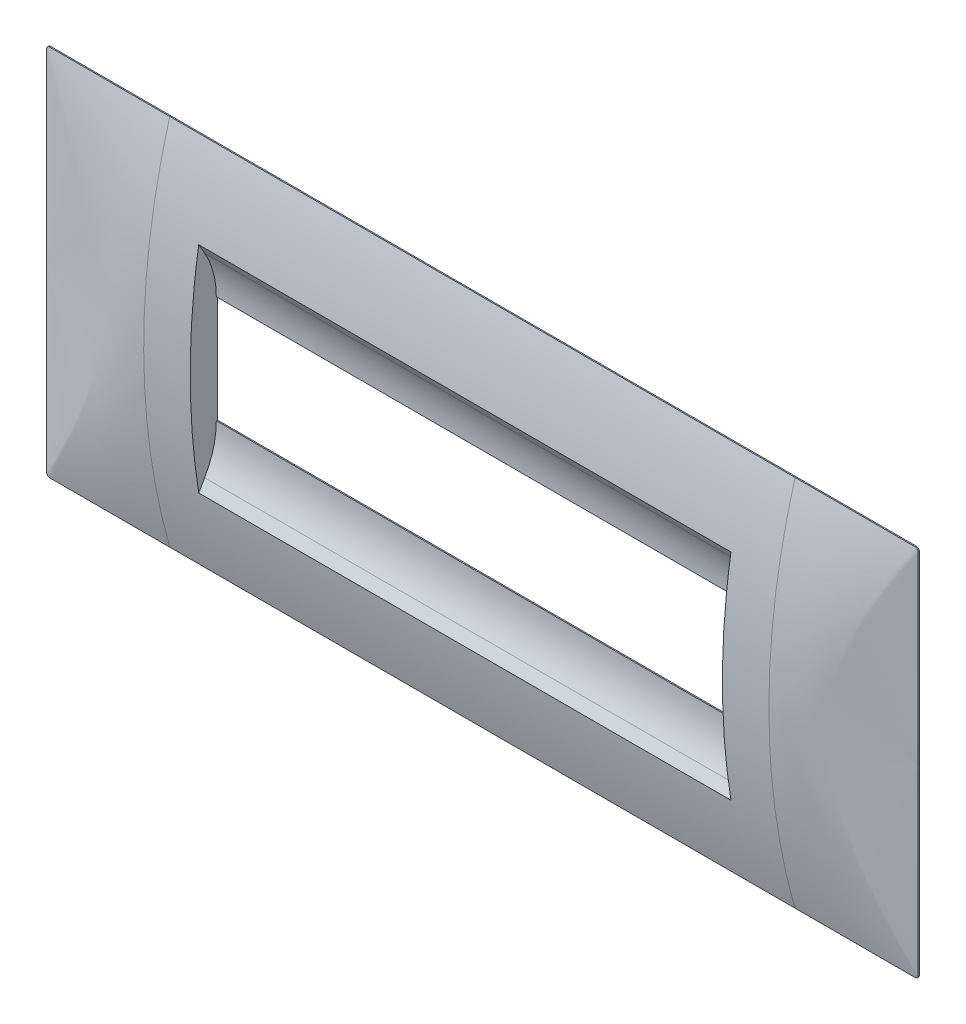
ISO-10303-21;
HEADER;
FILE_DESCRIPTION(('STEP AP214'),'2;1');
FILE_NAME('part.step','',(''),(''),'','','');
FILE_SCHEMA(('AUTOMOTIVE_DESIGN { 1 0 10303 214 1 1 1 1 }'));
ENDSEC;
DATA;
#1=APPLICATION_CONTEXT('core data for automotive mechanical design processes');
#2=APPLICATION_PROTOCOL_DEFINITION('international standard','automotive_design',2000,#1);
#3=PRODUCT_CONTEXT('',#1,'mechanical');
#4=PRODUCT('Part','Part','',(#3));
#5=PRODUCT_RELATED_PRODUCT_CATEGORY('part','',(#4));
#6=PRODUCT_DEFINITION_FORMATION('','',#4);
#7=PRODUCT_DEFINITION_CONTEXT('part definition',#1,'design');
#8=PRODUCT_DEFINITION('design','',#6,#7);
#9=PRODUCT_DEFINITION_SHAPE('','',#8);
#10=(LENGTH_UNIT() NAMED_UNIT(*) SI_UNIT(.MILLI.,.METRE.));
#11=(NAMED_UNIT(*) PLANE_ANGLE_UNIT() SI_UNIT($,.RADIAN.));
#12=(NAMED_UNIT(*) SI_UNIT($,.STERADIAN.) SOLID_ANGLE_UNIT());
#13=UNCERTAINTY_MEASURE_WITH_UNIT(LENGTH_MEASURE(1.E-05),#10,'distance_accuracy_value','');
#14=(GEOMETRIC_REPRESENTATION_CONTEXT(3) GLOBAL_UNCERTAINTY_ASSIGNED_CONTEXT((#13)) GLOBAL_UNIT_ASSIGNED_CONTEXT((#10,
#11,#12)) REPRESENTATION_CONTEXT('',''));
#15=CARTESIAN_POINT('',(0.,0.,0.));
#16=DIRECTION('',(0.,0.,1.));
#17=DIRECTION('',(1.,0.,0.));
#18=AXIS2_PLACEMENT_3D('',#15,#16,#17);
#19=CARTESIAN_POINT('',(538.,321.,-2.22044604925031E-13));
#20=CARTESIAN_POINT('',(544.199364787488,321.,0.));
#21=CARTESIAN_POINT('',(556.598094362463,321.,0.));
#22=CARTESIAN_POINT('',(575.196188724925,321.,0.));
#23=CARTESIAN_POINT('',(593.794283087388,321.,0.));
#24=CARTESIAN_POINT('',(612.392377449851,321.,0.));
#25=CARTESIAN_POINT('',(630.990471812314,321.,0.));
#26=CARTESIAN_POINT('',(649.588566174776,321.,0.));
#27=CARTESIAN_POINT('',(668.186660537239,321.000000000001,0.));
#28=CARTESIAN_POINT('',(686.784754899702,321.000000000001,0.));
#29=CARTESIAN_POINT('',(705.382849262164,321.,0.));
#30=CARTESIAN_POINT('',(717.781578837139,321.,0.));
#31=CARTESIAN_POINT('',(724.681578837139,321.,0.));
#32=CARTESIAN_POINT('',(726.082849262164,321.,0.));
#33=CARTESIAN_POINT('',(728.184754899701,321.,0.));
#34=CARTESIAN_POINT('',(730.286660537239,321.,0.));
#35=CARTESIAN_POINT('',(732.388566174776,321.,0.));
#36=CARTESIAN_POINT('',(734.490471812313,321.,0.));
#37=CARTESIAN_POINT('',(736.592377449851,321.,0.));
#38=CARTESIAN_POINT('',(738.694283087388,321.,0.));
#39=CARTESIAN_POINT('',(740.796188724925,321.,0.));
#40=CARTESIAN_POINT('',(742.898094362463,321.,0.));
#41=CARTESIAN_POINT('',(744.299364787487,321.,0.));
#42=CARTESIAN_POINT('',(745.275957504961,321.,0.));
#43=CARTESIAN_POINT('',(745.8174895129,320.955191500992,0.));
#44=CARTESIAN_POINT('',(746.588310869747,320.763880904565,0.));
#45=CARTESIAN_POINT('',(747.307327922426,320.458800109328,0.));
#46=CARTESIAN_POINT('',(747.964213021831,320.050276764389,0.));
#47=CARTESIAN_POINT('',(748.548638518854,319.548638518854,0.));
#48=CARTESIAN_POINT('',(749.050276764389,318.964213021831,0.));
#49=CARTESIAN_POINT('',(749.458800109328,318.307327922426,0.));
#50=CARTESIAN_POINT('',(749.763880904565,317.588310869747,0.));
#51=CARTESIAN_POINT('',(749.955191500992,316.8174895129,0.));
#52=CARTESIAN_POINT('',(750.,316.275957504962,0.));
#53=CARTESIAN_POINT('',(750.,305.466666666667,0.));
#54=CARTESIAN_POINT('',(750.,284.4,0.));
#55=CARTESIAN_POINT('',(750.,252.8,0.));
#56=CARTESIAN_POINT('',(750.,221.2,0.));
#57=CARTESIAN_POINT('',(750.,189.6,0.));
#58=CARTESIAN_POINT('',(750.,158.,0.));
#59=CARTESIAN_POINT('',(750.,126.4,0.));
#60=CARTESIAN_POINT('',(750.,94.7999999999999,0.));
#61=CARTESIAN_POINT('',(750.,63.2,0.));
#62=CARTESIAN_POINT('',(750.,31.6,0.));
#63=CARTESIAN_POINT('',(750.,10.5333333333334,0.));
#64=CARTESIAN_POINT('',(750.,0.,0.));
#65=CARTESIAN_POINT('',(538.,294.945493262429,7.45144036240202));
#66=CARTESIAN_POINT('',(543.741577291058,294.937377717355,7.43012806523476));
#67=CARTESIAN_POINT('',(555.224476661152,294.921146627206,7.37945756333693));
#68=CARTESIAN_POINT('',(572.447605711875,294.896799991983,7.27937195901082));
#69=CARTESIAN_POINT('',(589.66906038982,294.872453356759,7.15526437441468));
#70=CARTESIAN_POINT('',(606.888386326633,294.848106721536,7.00719268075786));
#71=CARTESIAN_POINT('',(624.105129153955,294.823760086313,6.83521474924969));
#72=CARTESIAN_POINT('',(641.318834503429,294.799413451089,6.63938845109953));
#73=CARTESIAN_POINT('',(658.5290480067,294.775066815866,6.41977165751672));
#74=CARTESIAN_POINT('',(675.73531529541,294.750720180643,6.1764222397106));
#75=CARTESIAN_POINT('',(692.937182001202,294.726373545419,5.90939806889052));
#76=CARTESIAN_POINT('',(704.401856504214,294.71014245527,5.71563736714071));
#77=CARTESIAN_POINT('',(710.781061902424,294.701109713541,5.60343760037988));
#78=CARTESIAN_POINT('',(712.076567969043,294.69927532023,5.58065177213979));
#79=CARTESIAN_POINT('',(714.019827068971,294.696523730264,5.54647302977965));
#80=CARTESIAN_POINT('',(715.9630861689,294.693772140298,5.51229428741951));
#81=CARTESIAN_POINT('',(717.906345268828,294.691020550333,5.47811554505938));
#82=CARTESIAN_POINT('',(719.849604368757,294.688268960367,5.44393680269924));
#83=CARTESIAN_POINT('',(721.792863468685,294.685517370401,5.4097580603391));
#84=CARTESIAN_POINT('',(723.736122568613,294.682765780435,5.37557931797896));
#85=CARTESIAN_POINT('',(725.679381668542,294.680014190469,5.34140057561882));
#86=CARTESIAN_POINT('',(727.62264076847,294.677262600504,5.30722183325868));
#87=CARTESIAN_POINT('',(728.918146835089,294.675428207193,5.28443600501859));
#88=CARTESIAN_POINT('',(729.821028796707,294.674149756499,5.26855579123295));
#89=CARTESIAN_POINT('',(730.322201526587,294.632352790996,5.25958119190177));
#90=CARTESIAN_POINT('',(731.037668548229,294.455900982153,5.24611929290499));
#91=CARTESIAN_POINT('',(731.707806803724,294.175159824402,5.23265739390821));
#92=CARTESIAN_POINT('',(732.323579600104,293.799596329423,5.21919549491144));
#93=CARTESIAN_POINT('',(732.8759502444,293.338677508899,5.20573359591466));
#94=CARTESIAN_POINT('',(733.355882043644,292.80187037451,5.19227169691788));
#95=CARTESIAN_POINT('',(733.754338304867,292.198641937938,5.17880979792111));
#96=CARTESIAN_POINT('',(734.0622823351,291.538459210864,5.16534789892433));
#97=CARTESIAN_POINT('',(734.270677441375,290.83078920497,5.15188599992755));
#98=CARTESIAN_POINT('',(734.337217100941,290.333662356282,5.14291140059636));
#99=CARTESIAN_POINT('',(734.872520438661,280.410995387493,4.96714329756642));
#100=CARTESIAN_POINT('',(735.915794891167,261.072306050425,4.6245816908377));
#101=CARTESIAN_POINT('',(737.480706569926,232.064272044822,4.11073928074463));
#102=CARTESIAN_POINT('',(739.045618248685,203.056238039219,3.59689687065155));
#103=CARTESIAN_POINT('',(740.610529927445,174.048204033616,3.08305446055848));
#104=CARTESIAN_POINT('',(742.175441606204,145.040170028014,2.5692120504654));
#105=CARTESIAN_POINT('',(743.740353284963,116.032136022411,2.05536964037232));
#106=CARTESIAN_POINT('',(745.305264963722,87.0241020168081,1.54152723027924));
#107=CARTESIAN_POINT('',(746.870176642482,58.0160680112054,1.02768482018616));
#108=CARTESIAN_POINT('',(748.435088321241,29.0080340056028,0.513842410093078));
#109=CARTESIAN_POINT('',(749.478362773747,9.66934466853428,0.171280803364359));
#110=CARTESIAN_POINT('',(750.,0.,0.));
#111=CARTESIAN_POINT('',(538.,242.317382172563,20.5392329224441));
#112=CARTESIAN_POINT('',(542.826002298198,242.299092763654,20.4964758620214));
#113=CARTESIAN_POINT('',(552.477241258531,242.262513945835,20.386824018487));
#114=CARTESIAN_POINT('',(566.950439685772,242.207645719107,20.1501066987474));
#115=CARTESIAN_POINT('',(581.418614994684,242.152777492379,19.8413234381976));
#116=CARTESIAN_POINT('',(595.880404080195,242.09790926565,19.4606478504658));
#117=CARTESIAN_POINT('',(610.334443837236,242.043041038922,19.00825354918));
#118=CARTESIAN_POINT('',(624.779371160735,241.988172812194,18.4843141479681));
#119=CARTESIAN_POINT('',(639.213822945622,241.933304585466,17.8890032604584));
#120=CARTESIAN_POINT('',(653.636436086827,241.878436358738,17.2224945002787));
#121=CARTESIAN_POINT('',(668.045847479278,241.823568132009,16.4849614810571));
#122=CARTESIAN_POINT('',(677.642411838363,241.78698931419,15.9460390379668));
#123=CARTESIAN_POINT('',(682.980028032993,241.766632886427,15.6330132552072));
#124=CARTESIAN_POINT('',(684.064005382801,241.762498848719,15.5694431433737));
#125=CARTESIAN_POINT('',(685.689971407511,241.756297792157,15.4740879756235));
#126=CARTESIAN_POINT('',(687.315937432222,241.750096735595,15.3787328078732));
#127=CARTESIAN_POINT('',(688.941903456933,241.743895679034,15.2833776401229));
#128=CARTESIAN_POINT('',(690.567869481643,241.737694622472,15.1880224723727));
#129=CARTESIAN_POINT('',(692.193835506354,241.73149356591,15.0926673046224));
#130=CARTESIAN_POINT('',(693.819801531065,241.725292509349,14.9973121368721));
#131=CARTESIAN_POINT('',(695.445767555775,241.719091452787,14.9019569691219));
#132=CARTESIAN_POINT('',(697.071733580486,241.712890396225,14.8066018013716));
#133=CARTESIAN_POINT('',(698.155710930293,241.708756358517,14.7430316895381));
#134=CARTESIAN_POINT('',(698.911171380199,241.705875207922,14.6987275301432));
#135=CARTESIAN_POINT('',(699.331625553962,241.670640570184,14.673689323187));
#136=CARTESIAN_POINT('',(699.936383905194,241.524715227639,14.6361320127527));
#137=CARTESIAN_POINT('',(700.508764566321,241.293462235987,14.5985747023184));
#138=CARTESIAN_POINT('',(701.042312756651,240.984627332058,14.561017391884));
#139=CARTESIAN_POINT('',(701.530573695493,240.605956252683,14.5234600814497));
#140=CARTESIAN_POINT('',(701.967092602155,240.165194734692,14.4859027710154));
#141=CARTESIAN_POINT('',(702.345414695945,239.670088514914,14.448345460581));
#142=CARTESIAN_POINT('',(702.65908519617,239.128383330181,14.4107881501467));
#143=CARTESIAN_POINT('',(702.90164932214,238.547824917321,14.3732308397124));
#144=CARTESIAN_POINT('',(703.011651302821,238.140047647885,14.3481926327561));
#145=CARTESIAN_POINT('',(704.617561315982,230.001189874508,13.8578177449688));
#146=CARTESIAN_POINT('',(707.7473846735,214.13903884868,12.9021061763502));
#147=CARTESIAN_POINT('',(712.442119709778,190.345812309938,11.4685388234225));
#148=CARTESIAN_POINT('',(717.136854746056,166.552585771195,10.0349714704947));
#149=CARTESIAN_POINT('',(721.831589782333,142.759359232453,8.60140411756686));
#150=CARTESIAN_POINT('',(726.526324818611,118.966132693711,7.16783676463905));
#151=CARTESIAN_POINT('',(731.221059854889,95.1729061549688,5.73426941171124));
#152=CARTESIAN_POINT('',(735.915794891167,71.3796796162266,4.30070205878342));
#153=CARTESIAN_POINT('',(740.610529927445,47.5864530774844,2.86713470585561));
#154=CARTESIAN_POINT('',(745.305264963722,23.7932265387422,1.4335673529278));
#155=CARTESIAN_POINT('',(748.435088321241,7.9310755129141,0.477855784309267));
#156=CARTESIAN_POINT('',(750.,0.,0.));
#157=CARTESIAN_POINT('',(538.000000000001,162.200481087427,34.6300984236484));
#158=CARTESIAN_POINT('',(541.624310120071,162.180638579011,34.5952149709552));
#159=CARTESIAN_POINT('',(548.871494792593,162.140953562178,34.4801898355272));
#160=CARTESIAN_POINT('',(559.735409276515,162.081426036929,34.1722029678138));
#161=CARTESIAN_POINT('',(570.58990541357,162.02189851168,33.7290924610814));
#162=CARTESIAN_POINT('',(581.432427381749,161.962370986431,33.1511838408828));
#163=CARTESIAN_POINT('',(592.260419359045,161.902843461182,32.4388026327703));
#164=CARTESIAN_POINT('',(603.071325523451,161.843315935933,31.5922743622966));
#165=CARTESIAN_POINT('',(613.86259005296,161.783788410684,30.6119245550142));
#166=CARTESIAN_POINT('',(624.631657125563,161.724260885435,29.4980787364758));
#167=CARTESIAN_POINT('',(635.375970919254,161.664733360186,28.2510624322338));
#168=CARTESIAN_POINT('',(642.520640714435,161.625048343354,27.3311549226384));
#169=CARTESIAN_POINT('',(646.491171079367,161.602963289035,26.794635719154));
#170=CARTESIAN_POINT('',(647.297516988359,161.59847819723,26.6856779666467));
#171=CARTESIAN_POINT('',(648.507035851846,161.591750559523,26.5222413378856));
#172=CARTESIAN_POINT('',(649.716554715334,161.585022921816,26.3588047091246));
#173=CARTESIAN_POINT('',(650.926073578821,161.57829528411,26.1953680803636));
#174=CARTESIAN_POINT('',(652.135592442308,161.571567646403,26.0319314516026));
#175=CARTESIAN_POINT('',(653.345111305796,161.564840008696,25.8684948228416));
#176=CARTESIAN_POINT('',(654.554630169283,161.558112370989,25.7050581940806));
#177=CARTESIAN_POINT('',(655.76414903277,161.551384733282,25.5416215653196));
#178=CARTESIAN_POINT('',(656.973667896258,161.544657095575,25.3781849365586));
#179=CARTESIAN_POINT('',(657.78001380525,161.54017200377,25.2692271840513));
#180=CARTESIAN_POINT('',(658.341983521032,161.537046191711,25.1932908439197));
#181=CARTESIAN_POINT('',(658.656494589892,161.512875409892,25.1503759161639));
#182=CARTESIAN_POINT('',(659.115947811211,161.414570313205,25.0860035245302));
#183=CARTESIAN_POINT('',(659.56002162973,161.259380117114,25.0216311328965));
#184=CARTESIAN_POINT('',(659.985650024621,161.052468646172,24.9572587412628));
#185=CARTESIAN_POINT('',(660.389766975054,160.798999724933,24.8928863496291));
#186=CARTESIAN_POINT('',(660.769306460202,160.504137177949,24.8285139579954));
#187=CARTESIAN_POINT('',(661.121202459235,160.173044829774,24.7641415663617));
#188=CARTESIAN_POINT('',(661.442388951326,159.810886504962,24.699769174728));
#189=CARTESIAN_POINT('',(661.729799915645,159.422826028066,24.6353967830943));
#190=CARTESIAN_POINT('',(661.896846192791,159.150293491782,24.5924818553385));
#191=CARTESIAN_POINT('',(664.907927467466,153.711050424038,23.7519902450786));
#192=CARTESIAN_POINT('',(670.776346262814,143.110288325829,22.1139219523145));
#193=CARTESIAN_POINT('',(679.578974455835,127.209145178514,19.6568195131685));
#194=CARTESIAN_POINT('',(688.381602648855,111.3080020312,17.1997170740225));
#195=CARTESIAN_POINT('',(697.184230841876,95.4068588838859,14.7426146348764));
#196=CARTESIAN_POINT('',(705.986859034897,79.5057157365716,12.2855121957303));
#197=CARTESIAN_POINT('',(714.789487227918,63.6045725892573,9.82840975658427));
#198=CARTESIAN_POINT('',(723.592115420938,47.7034294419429,7.3713073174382));
#199=CARTESIAN_POINT('',(732.394743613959,31.8022862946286,4.91420487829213));
#200=CARTESIAN_POINT('',(741.19737180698,15.9011431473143,2.45710243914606));
#201=CARTESIAN_POINT('',(747.065790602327,5.3003810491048,0.819034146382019));
#202=CARTESIAN_POINT('',(750.,0.,0.));
#203=CARTESIAN_POINT('',(537.999999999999,81.297296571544,43.1121421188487));
#204=CARTESIAN_POINT('',(540.765958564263,81.2850759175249,43.1013526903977));
#205=CARTESIAN_POINT('',(546.295961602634,81.260634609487,43.0194295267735));
#206=CARTESIAN_POINT('',(554.581816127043,81.2239726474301,42.7159458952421));
#207=CARTESIAN_POINT('',(562.855112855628,81.1873106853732,42.2322974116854));
#208=CARTESIAN_POINT('',(571.112444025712,81.1506487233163,41.5689181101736));
#209=CARTESIAN_POINT('',(579.35040187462,81.1139867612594,40.7262420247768));
#210=CARTESIAN_POINT('',(587.565578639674,81.0773247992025,39.704703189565));
#211=CARTESIAN_POINT('',(595.754566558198,81.0406628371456,38.5047356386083));
#212=CARTESIAN_POINT('',(603.913957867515,81.0040008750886,37.1267734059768));
#213=CARTESIAN_POINT('',(612.040344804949,80.9673389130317,35.5712505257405));
#214=CARTESIAN_POINT('',(617.433661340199,80.9428976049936,34.4161508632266));
#215=CARTESIAN_POINT('',(620.427701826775,80.9292958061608,33.7405509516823));
#216=CARTESIAN_POINT('',(621.035739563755,80.926533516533,33.6033483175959));
#217=CARTESIAN_POINT('',(621.947796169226,80.9223900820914,33.3975443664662));
#218=CARTESIAN_POINT('',(622.859852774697,80.9182466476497,33.1917404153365));
#219=CARTESIAN_POINT('',(623.771909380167,80.9141032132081,32.9859364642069));
#220=CARTESIAN_POINT('',(624.683965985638,80.9099597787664,32.7801325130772));
#221=CARTESIAN_POINT('',(625.596022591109,80.9058163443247,32.5743285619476));
#222=CARTESIAN_POINT('',(626.50807919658,80.9016729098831,32.3685246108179));
#223=CARTESIAN_POINT('',(627.420135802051,80.8975294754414,32.1627206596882));
#224=CARTESIAN_POINT('',(628.332192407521,80.8933860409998,31.9569167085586));
#225=CARTESIAN_POINT('',(628.940230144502,80.890623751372,31.8197140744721));
#226=CARTESIAN_POINT('',(629.363992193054,80.8886986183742,31.7240929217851));
#227=CARTESIAN_POINT('',(629.602829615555,80.8764085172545,31.6700532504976));
#228=CARTESIAN_POINT('',(629.958493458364,80.8269489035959,31.5889937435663));
#229=CARTESIAN_POINT('',(630.310919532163,80.7490467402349,31.507934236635));
#230=CARTESIAN_POINT('',(630.659462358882,80.6452839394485,31.4268747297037));
#231=CARTESIAN_POINT('',(631.003476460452,80.518242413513,31.3458152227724));
#232=CARTESIAN_POINT('',(631.342316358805,80.3705040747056,31.264755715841));
#233=CARTESIAN_POINT('',(631.67533657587,80.2046508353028,31.1836962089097));
#234=CARTESIAN_POINT('',(632.001891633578,80.0232646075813,31.1026367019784));
#235=CARTESIAN_POINT('',(632.321336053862,79.8289273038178,31.0215771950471));
#236=CARTESIAN_POINT('',(632.529128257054,79.6924563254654,30.9675375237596));
#237=CARTESIAN_POINT('',(636.543903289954,76.9688255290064,29.909167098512));
#238=CARTESIAN_POINT('',(644.36846168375,71.660630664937,27.8464659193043));
#239=CARTESIAN_POINT('',(656.105299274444,63.6983383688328,24.7524141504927));
#240=CARTESIAN_POINT('',(667.842136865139,55.7360460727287,21.6583623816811));
#241=CARTESIAN_POINT('',(679.578974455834,47.7737537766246,18.5643106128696));
#242=CARTESIAN_POINT('',(691.315812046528,39.8114614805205,15.470258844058));
#243=CARTESIAN_POINT('',(703.052649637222,31.8491691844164,12.3762070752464));
#244=CARTESIAN_POINT('',(714.789487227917,23.8868768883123,9.28215530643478));
#245=CARTESIAN_POINT('',(726.526324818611,15.9245845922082,6.18810353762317));
#246=CARTESIAN_POINT('',(738.263162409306,7.96229229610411,3.09405176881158));
#247=CARTESIAN_POINT('',(746.087720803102,2.65409743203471,1.03135058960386));
#248=CARTESIAN_POINT('',(750.,0.,0.));
#249=CARTESIAN_POINT('',(538.,27.0991011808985,44.9999999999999));
#250=CARTESIAN_POINT('',(540.537064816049,27.0950276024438,45.));
#251=CARTESIAN_POINT('',(545.60915275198,27.0868804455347,44.9356327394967));
#252=CARTESIAN_POINT('',(553.207524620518,27.074659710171,44.6464430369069));
#253=CARTESIAN_POINT('',(560.792501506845,27.0624389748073,44.1650774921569));
#254=CARTESIAN_POINT('',(568.360448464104,27.0502182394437,43.4919990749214));
#255=CARTESIAN_POINT('',(575.907730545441,27.03799750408,42.6276707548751));
#256=CARTESIAN_POINT('',(583.430712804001,27.0257767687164,41.5725555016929));
#257=CARTESIAN_POINT('',(590.925760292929,27.0135560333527,40.3271162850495));
#258=CARTESIAN_POINT('',(598.38923806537,27.001335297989,38.8918160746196));
#259=CARTESIAN_POINT('',(605.817511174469,26.9891145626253,37.267117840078));
#260=CARTESIAN_POINT('',(610.743800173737,26.9809674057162,36.0580289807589));
#261=CARTESIAN_POINT('',(613.477443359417,26.9764334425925,35.3501984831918));
#262=CARTESIAN_POINT('',(614.032598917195,26.9755126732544,35.2064503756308));
#263=CARTESIAN_POINT('',(614.865332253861,26.9741315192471,34.9908282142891));
#264=CARTESIAN_POINT('',(615.698065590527,26.9727503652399,34.7752060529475));
#265=CARTESIAN_POINT('',(616.530798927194,26.9713692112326,34.5595838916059));
#266=CARTESIAN_POINT('',(617.36353226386,26.9699880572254,34.3439617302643));
#267=CARTESIAN_POINT('',(618.196265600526,26.9686069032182,34.1283395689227));
#268=CARTESIAN_POINT('',(619.028998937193,26.9672257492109,33.9127174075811));
#269=CARTESIAN_POINT('',(619.861732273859,26.9658445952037,33.6970952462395));
#270=CARTESIAN_POINT('',(620.694465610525,26.9644634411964,33.4814730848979));
#271=CARTESIAN_POINT('',(621.249621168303,26.9635426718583,33.3377249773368));
#272=CARTESIAN_POINT('',(621.636527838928,26.9629009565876,33.2375420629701));
#273=CARTESIAN_POINT('',(621.855185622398,26.9588042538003,33.1809243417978));
#274=CARTESIAN_POINT('',(622.183172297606,26.9423177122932,33.0959977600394));
#275=CARTESIAN_POINT('',(622.511158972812,26.9163503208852,33.011071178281));
#276=CARTESIAN_POINT('',(622.839145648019,26.8817627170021,32.9261445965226));
#277=CARTESIAN_POINT('',(623.167132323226,26.8394155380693,32.8412180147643));
#278=CARTESIAN_POINT('',(623.495118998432,26.7901694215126,32.7562914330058));
#279=CARTESIAN_POINT('',(623.823105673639,26.7348850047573,32.6713648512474));
#280=CARTESIAN_POINT('',(624.151092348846,26.6744229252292,32.5864382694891));
#281=CARTESIAN_POINT('',(624.479079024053,26.6096438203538,32.5015116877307));
#282=CARTESIAN_POINT('',(624.697736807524,26.5641534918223,32.4448939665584));
#283=CARTESIAN_POINT('',(628.980163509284,25.6562765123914,31.3360322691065));
#284=CARTESIAN_POINT('',(637.326359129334,23.8868781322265,29.1749265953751));
#285=CARTESIAN_POINT('',(649.845652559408,21.2327805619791,25.9332680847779));
#286=CARTESIAN_POINT('',(662.364945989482,18.5786829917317,22.6916095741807));
#287=CARTESIAN_POINT('',(674.884239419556,15.9245854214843,19.4499510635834));
#288=CARTESIAN_POINT('',(687.40353284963,13.2704878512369,16.2082925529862));
#289=CARTESIAN_POINT('',(699.922826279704,10.6163902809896,12.966634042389));
#290=CARTESIAN_POINT('',(712.442119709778,7.96229271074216,9.72497553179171));
#291=CARTESIAN_POINT('',(724.961413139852,5.30819514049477,6.48331702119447));
#292=CARTESIAN_POINT('',(737.480706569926,2.65409757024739,3.24165851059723));
#293=CARTESIAN_POINT('',(745.826902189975,0.884699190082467,1.08055283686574));
#294=CARTESIAN_POINT('',(750.,0.,0.));
#295=CARTESIAN_POINT('',(538.,-27.0991011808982,44.9999999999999));
#296=CARTESIAN_POINT('',(540.537064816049,-27.0950276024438,45.));
#297=CARTESIAN_POINT('',(545.60915275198,-27.0868804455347,44.9356327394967));
#298=CARTESIAN_POINT('',(553.207524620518,-27.074659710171,44.6464430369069));
#299=CARTESIAN_POINT('',(560.792501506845,-27.0624389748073,44.1650774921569));
#300=CARTESIAN_POINT('',(568.360448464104,-27.0502182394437,43.4919990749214));
#301=CARTESIAN_POINT('',(575.907730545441,-27.03799750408,42.6276707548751));
#302=CARTESIAN_POINT('',(583.430712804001,-27.0257767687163,41.5725555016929));
#303=CARTESIAN_POINT('',(590.925760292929,-27.0135560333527,40.3271162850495));
#304=CARTESIAN_POINT('',(598.38923806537,-27.001335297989,38.8918160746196));
#305=CARTESIAN_POINT('',(605.817511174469,-26.9891145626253,37.267117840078));
#306=CARTESIAN_POINT('',(610.743800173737,-26.9809674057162,36.0580289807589));
#307=CARTESIAN_POINT('',(613.477443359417,-26.9764334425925,35.3501984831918));
#308=CARTESIAN_POINT('',(614.032598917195,-26.9755126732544,35.2064503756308));
#309=CARTESIAN_POINT('',(614.865332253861,-26.9741315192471,34.9908282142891));
#310=CARTESIAN_POINT('',(615.698065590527,-26.9727503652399,34.7752060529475));
#311=CARTESIAN_POINT('',(616.530798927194,-26.9713692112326,34.5595838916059));
#312=CARTESIAN_POINT('',(617.36353226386,-26.9699880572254,34.3439617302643));
#313=CARTESIAN_POINT('',(618.196265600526,-26.9686069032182,34.1283395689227));
#314=CARTESIAN_POINT('',(619.028998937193,-26.9672257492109,33.9127174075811));
#315=CARTESIAN_POINT('',(619.861732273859,-26.9658445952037,33.6970952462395));
#316=CARTESIAN_POINT('',(620.694465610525,-26.9644634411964,33.4814730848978));
#317=CARTESIAN_POINT('',(621.249621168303,-26.9635426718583,33.3377249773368));
#318=CARTESIAN_POINT('',(621.636527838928,-26.9629009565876,33.2375420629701));
#319=CARTESIAN_POINT('',(621.855185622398,-26.9588042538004,33.1809243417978));
#320=CARTESIAN_POINT('',(622.183172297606,-26.9423177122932,33.0959977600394));
#321=CARTESIAN_POINT('',(622.511158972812,-26.9163503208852,33.011071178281));
#322=CARTESIAN_POINT('',(622.839145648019,-26.8817627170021,32.9261445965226));
#323=CARTESIAN_POINT('',(623.167132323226,-26.8394155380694,32.8412180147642));
#324=CARTESIAN_POINT('',(623.495118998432,-26.7901694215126,32.7562914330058));
#325=CARTESIAN_POINT('',(623.823105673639,-26.7348850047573,32.6713648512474));
#326=CARTESIAN_POINT('',(624.151092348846,-26.6744229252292,32.586438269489));
#327=CARTESIAN_POINT('',(624.479079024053,-26.6096438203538,32.5015116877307));
#328=CARTESIAN_POINT('',(624.697736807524,-26.5641534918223,32.4448939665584));
#329=CARTESIAN_POINT('',(628.980163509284,-25.6562765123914,31.3360322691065));
#330=CARTESIAN_POINT('',(637.326359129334,-23.8868781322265,29.1749265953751));
#331=CARTESIAN_POINT('',(649.845652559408,-21.2327805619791,25.9332680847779));
#332=CARTESIAN_POINT('',(662.364945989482,-18.5786829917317,22.6916095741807));
#333=CARTESIAN_POINT('',(674.884239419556,-15.9245854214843,19.4499510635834));
#334=CARTESIAN_POINT('',(687.40353284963,-13.2704878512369,16.2082925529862));
#335=CARTESIAN_POINT('',(699.922826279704,-10.6163902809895,12.966634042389));
#336=CARTESIAN_POINT('',(712.442119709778,-7.96229271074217,9.72497553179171));
#337=CARTESIAN_POINT('',(724.961413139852,-5.30819514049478,6.48331702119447));
#338=CARTESIAN_POINT('',(737.480706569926,-2.65409757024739,3.24165851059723));
#339=CARTESIAN_POINT('',(745.826902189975,-0.884699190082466,1.08055283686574));
#340=CARTESIAN_POINT('',(750.,0.,0.));
#341=CARTESIAN_POINT('',(538.000000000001,-81.2972965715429,43.1121421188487));
#342=CARTESIAN_POINT('',(540.765958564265,-81.2850759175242,43.1013526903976));
#343=CARTESIAN_POINT('',(546.295961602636,-81.2606346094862,43.0194295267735));
#344=CARTESIAN_POINT('',(554.581816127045,-81.2239726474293,42.715945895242));
#345=CARTESIAN_POINT('',(562.85511285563,-81.1873106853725,42.2322974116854));
#346=CARTESIAN_POINT('',(571.112444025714,-81.1506487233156,41.5689181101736));
#347=CARTESIAN_POINT('',(579.350401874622,-81.1139867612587,40.7262420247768));
#348=CARTESIAN_POINT('',(587.565578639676,-81.0773247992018,39.7047031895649));
#349=CARTESIAN_POINT('',(595.7545665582,-81.040662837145,38.5047356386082));
#350=CARTESIAN_POINT('',(603.913957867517,-81.0040008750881,37.1267734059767));
#351=CARTESIAN_POINT('',(612.040344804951,-80.9673389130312,35.5712505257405));
#352=CARTESIAN_POINT('',(617.4336613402,-80.9428976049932,34.4161508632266));
#353=CARTESIAN_POINT('',(620.427701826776,-80.9292958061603,33.7405509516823));
#354=CARTESIAN_POINT('',(621.035739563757,-80.9265335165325,33.6033483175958));
#355=CARTESIAN_POINT('',(621.947796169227,-80.9223900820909,33.3975443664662));
#356=CARTESIAN_POINT('',(622.859852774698,-80.9182466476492,33.1917404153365));
#357=CARTESIAN_POINT('',(623.771909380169,-80.9141032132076,32.9859364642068));
#358=CARTESIAN_POINT('',(624.683965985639,-80.9099597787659,32.7801325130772));
#359=CARTESIAN_POINT('',(625.59602259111,-80.9058163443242,32.5743285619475));
#360=CARTESIAN_POINT('',(626.508079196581,-80.9016729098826,32.3685246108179));
#361=CARTESIAN_POINT('',(627.420135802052,-80.8975294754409,32.1627206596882));
#362=CARTESIAN_POINT('',(628.332192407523,-80.8933860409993,31.9569167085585));
#363=CARTESIAN_POINT('',(628.940230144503,-80.8906237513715,31.8197140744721));
#364=CARTESIAN_POINT('',(629.363992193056,-80.8886986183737,31.7240929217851));
#365=CARTESIAN_POINT('',(629.602829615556,-80.876408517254,31.6700532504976));
#366=CARTESIAN_POINT('',(629.958493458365,-80.8269489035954,31.5889937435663));
#367=CARTESIAN_POINT('',(630.310919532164,-80.7490467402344,31.5079342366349));
#368=CARTESIAN_POINT('',(630.659462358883,-80.645283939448,31.4268747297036));
#369=CARTESIAN_POINT('',(631.003476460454,-80.5182424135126,31.3458152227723));
#370=CARTESIAN_POINT('',(631.342316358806,-80.3705040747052,31.264755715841));
#371=CARTESIAN_POINT('',(631.675336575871,-80.2046508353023,31.1836962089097));
#372=CARTESIAN_POINT('',(632.001891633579,-80.0232646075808,31.1026367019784));
#373=CARTESIAN_POINT('',(632.321336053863,-79.8289273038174,31.0215771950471));
#374=CARTESIAN_POINT('',(632.529128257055,-79.692456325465,30.9675375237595));
#375=CARTESIAN_POINT('',(636.543903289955,-76.9688255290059,29.9091670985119));
#376=CARTESIAN_POINT('',(644.368461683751,-71.6606306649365,27.8464659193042));
#377=CARTESIAN_POINT('',(656.105299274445,-63.6983383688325,24.7524141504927));
#378=CARTESIAN_POINT('',(667.84213686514,-55.7360460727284,21.6583623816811));
#379=CARTESIAN_POINT('',(679.578974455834,-47.7737537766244,18.5643106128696));
#380=CARTESIAN_POINT('',(691.315812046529,-39.8114614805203,15.470258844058));
#381=CARTESIAN_POINT('',(703.052649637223,-31.8491691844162,12.3762070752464));
#382=CARTESIAN_POINT('',(714.789487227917,-23.8868768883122,9.28215530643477));
#383=CARTESIAN_POINT('',(726.526324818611,-15.9245845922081,6.18810353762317));
#384=CARTESIAN_POINT('',(738.263162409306,-7.96229229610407,3.09405176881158));
#385=CARTESIAN_POINT('',(746.087720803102,-2.6540974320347,1.03135058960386));
#386=CARTESIAN_POINT('',(750.,0.,0.));
#387=CARTESIAN_POINT('',(538.,-162.200481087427,34.6300984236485));
#388=CARTESIAN_POINT('',(541.624310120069,-162.180638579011,34.5952149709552));
#389=CARTESIAN_POINT('',(548.871494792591,-162.140953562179,34.4801898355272));
#390=CARTESIAN_POINT('',(559.735409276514,-162.08142603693,34.1722029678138));
#391=CARTESIAN_POINT('',(570.589905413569,-162.021898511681,33.7290924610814));
#392=CARTESIAN_POINT('',(581.432427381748,-161.962370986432,33.1511838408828));
#393=CARTESIAN_POINT('',(592.260419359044,-161.902843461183,32.4388026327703));
#394=CARTESIAN_POINT('',(603.07132552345,-161.843315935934,31.5922743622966));
#395=CARTESIAN_POINT('',(613.862590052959,-161.783788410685,30.6119245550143));
#396=CARTESIAN_POINT('',(624.631657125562,-161.724260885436,29.4980787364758));
#397=CARTESIAN_POINT('',(635.375970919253,-161.664733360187,28.2510624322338));
#398=CARTESIAN_POINT('',(642.520640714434,-161.625048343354,27.3311549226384));
#399=CARTESIAN_POINT('',(646.491171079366,-161.602963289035,26.794635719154));
#400=CARTESIAN_POINT('',(647.297516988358,-161.598478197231,26.6856779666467));
#401=CARTESIAN_POINT('',(648.507035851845,-161.591750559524,26.5222413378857));
#402=CARTESIAN_POINT('',(649.716554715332,-161.585022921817,26.3588047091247));
#403=CARTESIAN_POINT('',(650.92607357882,-161.57829528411,26.1953680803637));
#404=CARTESIAN_POINT('',(652.135592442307,-161.571567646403,26.0319314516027));
#405=CARTESIAN_POINT('',(653.345111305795,-161.564840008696,25.8684948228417));
#406=CARTESIAN_POINT('',(654.554630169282,-161.558112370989,25.7050581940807));
#407=CARTESIAN_POINT('',(655.764149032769,-161.551384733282,25.5416215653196));
#408=CARTESIAN_POINT('',(656.973667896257,-161.544657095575,25.3781849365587));
#409=CARTESIAN_POINT('',(657.780013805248,-161.540172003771,25.2692271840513));
#410=CARTESIAN_POINT('',(658.341983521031,-161.537046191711,25.1932908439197));
#411=CARTESIAN_POINT('',(658.656494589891,-161.512875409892,25.1503759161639));
#412=CARTESIAN_POINT('',(659.11594781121,-161.414570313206,25.0860035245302));
#413=CARTESIAN_POINT('',(659.560021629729,-161.259380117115,25.0216311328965));
#414=CARTESIAN_POINT('',(659.985650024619,-161.052468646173,24.9572587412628));
#415=CARTESIAN_POINT('',(660.389766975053,-160.798999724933,24.8928863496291));
#416=CARTESIAN_POINT('',(660.769306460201,-160.504137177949,24.8285139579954));
#417=CARTESIAN_POINT('',(661.121202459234,-160.173044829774,24.7641415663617));
#418=CARTESIAN_POINT('',(661.442388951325,-159.810886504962,24.699769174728));
#419=CARTESIAN_POINT('',(661.729799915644,-159.422826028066,24.6353967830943));
#420=CARTESIAN_POINT('',(661.89684619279,-159.150293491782,24.5924818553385));
#421=CARTESIAN_POINT('',(664.907927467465,-153.711050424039,23.7519902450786));
#422=CARTESIAN_POINT('',(670.776346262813,-143.110288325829,22.1139219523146));
#423=CARTESIAN_POINT('',(679.578974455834,-127.209145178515,19.6568195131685));
#424=CARTESIAN_POINT('',(688.381602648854,-111.3080020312,17.1997170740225));
#425=CARTESIAN_POINT('',(697.184230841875,-95.406858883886,14.7426146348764));
#426=CARTESIAN_POINT('',(705.986859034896,-79.5057157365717,12.2855121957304));
#427=CARTESIAN_POINT('',(714.789487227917,-63.6045725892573,9.82840975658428));
#428=CARTESIAN_POINT('',(723.592115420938,-47.703429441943,7.3713073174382));
#429=CARTESIAN_POINT('',(732.394743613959,-31.8022862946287,4.91420487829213));
#430=CARTESIAN_POINT('',(741.197371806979,-15.9011431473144,2.45710243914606));
#431=CARTESIAN_POINT('',(747.065790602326,-5.3003810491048,0.819034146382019));
#432=CARTESIAN_POINT('',(750.,0.,0.));
#433=CARTESIAN_POINT('',(538.,-242.317382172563,20.5392329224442));
#434=CARTESIAN_POINT('',(542.826002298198,-242.299092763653,20.4964758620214));
#435=CARTESIAN_POINT('',(552.477241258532,-242.262513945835,20.386824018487));
#436=CARTESIAN_POINT('',(566.950439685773,-242.207645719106,20.1501066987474));
#437=CARTESIAN_POINT('',(581.418614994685,-242.152777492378,19.8413234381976));
#438=CARTESIAN_POINT('',(595.880404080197,-242.09790926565,19.4606478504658));
#439=CARTESIAN_POINT('',(610.334443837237,-242.043041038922,19.00825354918));
#440=CARTESIAN_POINT('',(624.779371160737,-241.988172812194,18.4843141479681));
#441=CARTESIAN_POINT('',(639.213822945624,-241.933304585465,17.8890032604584));
#442=CARTESIAN_POINT('',(653.636436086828,-241.878436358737,17.2224945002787));
#443=CARTESIAN_POINT('',(668.045847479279,-241.823568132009,16.4849614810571));
#444=CARTESIAN_POINT('',(677.642411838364,-241.78698931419,15.9460390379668));
#445=CARTESIAN_POINT('',(682.980028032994,-241.766632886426,15.6330132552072));
#446=CARTESIAN_POINT('',(684.064005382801,-241.762498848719,15.5694431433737));
#447=CARTESIAN_POINT('',(685.689971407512,-241.756297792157,15.4740879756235));
#448=CARTESIAN_POINT('',(687.315937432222,-241.750096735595,15.3787328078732));
#449=CARTESIAN_POINT('',(688.941903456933,-241.743895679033,15.2833776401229));
#450=CARTESIAN_POINT('',(690.567869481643,-241.737694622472,15.1880224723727));
#451=CARTESIAN_POINT('',(692.193835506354,-241.73149356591,15.0926673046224));
#452=CARTESIAN_POINT('',(693.819801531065,-241.725292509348,14.9973121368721));
#453=CARTESIAN_POINT('',(695.445767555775,-241.719091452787,14.9019569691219));
#454=CARTESIAN_POINT('',(697.071733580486,-241.712890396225,14.8066018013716));
#455=CARTESIAN_POINT('',(698.155710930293,-241.708756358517,14.7430316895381));
#456=CARTESIAN_POINT('',(698.911171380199,-241.705875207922,14.6987275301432));
#457=CARTESIAN_POINT('',(699.331625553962,-241.670640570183,14.673689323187));
#458=CARTESIAN_POINT('',(699.936383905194,-241.524715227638,14.6361320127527));
#459=CARTESIAN_POINT('',(700.508764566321,-241.293462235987,14.5985747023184));
#460=CARTESIAN_POINT('',(701.042312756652,-240.984627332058,14.561017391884));
#461=CARTESIAN_POINT('',(701.530573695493,-240.605956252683,14.5234600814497));
#462=CARTESIAN_POINT('',(701.967092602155,-240.165194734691,14.4859027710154));
#463=CARTESIAN_POINT('',(702.345414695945,-239.670088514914,14.448345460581));
#464=CARTESIAN_POINT('',(702.65908519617,-239.12838333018,14.4107881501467));
#465=CARTESIAN_POINT('',(702.90164932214,-238.547824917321,14.3732308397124));
#466=CARTESIAN_POINT('',(703.011651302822,-238.140047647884,14.3481926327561));
#467=CARTESIAN_POINT('',(704.617561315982,-230.001189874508,13.8578177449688));
#468=CARTESIAN_POINT('',(707.7473846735,-214.13903884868,12.9021061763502));
#469=CARTESIAN_POINT('',(712.442119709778,-190.345812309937,11.4685388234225));
#470=CARTESIAN_POINT('',(717.136854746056,-166.552585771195,10.0349714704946));
#471=CARTESIAN_POINT('',(721.831589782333,-142.759359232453,8.60140411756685));
#472=CARTESIAN_POINT('',(726.526324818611,-118.966132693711,7.16783676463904));
#473=CARTESIAN_POINT('',(731.221059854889,-95.1729061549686,5.73426941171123));
#474=CARTESIAN_POINT('',(735.915794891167,-71.3796796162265,4.30070205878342));
#475=CARTESIAN_POINT('',(740.610529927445,-47.5864530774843,2.86713470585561));
#476=CARTESIAN_POINT('',(745.305264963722,-23.7932265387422,1.4335673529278));
#477=CARTESIAN_POINT('',(748.435088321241,-7.93107551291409,0.477855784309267));
#478=CARTESIAN_POINT('',(750.,0.,0.));
#479=CARTESIAN_POINT('',(538.,-294.945493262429,7.45144036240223));
#480=CARTESIAN_POINT('',(543.741577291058,-294.937377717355,7.43012806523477));
#481=CARTESIAN_POINT('',(555.224476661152,-294.921146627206,7.37945756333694));
#482=CARTESIAN_POINT('',(572.447605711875,-294.896799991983,7.27937195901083));
#483=CARTESIAN_POINT('',(589.669060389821,-294.872453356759,7.15526437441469));
#484=CARTESIAN_POINT('',(606.888386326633,-294.848106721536,7.00719268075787));
#485=CARTESIAN_POINT('',(624.105129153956,-294.823760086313,6.8352147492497));
#486=CARTESIAN_POINT('',(641.31883450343,-294.799413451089,6.63938845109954));
#487=CARTESIAN_POINT('',(658.529048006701,-294.775066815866,6.41977165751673));
#488=CARTESIAN_POINT('',(675.735315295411,-294.750720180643,6.17642223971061));
#489=CARTESIAN_POINT('',(692.937182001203,-294.72637354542,5.90939806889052));
#490=CARTESIAN_POINT('',(704.401856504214,-294.71014245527,5.71563736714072));
#491=CARTESIAN_POINT('',(710.781061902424,-294.701109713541,5.60343760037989));
#492=CARTESIAN_POINT('',(712.076567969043,-294.69927532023,5.5806517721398));
#493=CARTESIAN_POINT('',(714.019827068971,-294.696523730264,5.54647302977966));
#494=CARTESIAN_POINT('',(715.9630861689,-294.693772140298,5.51229428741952));
#495=CARTESIAN_POINT('',(717.906345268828,-294.691020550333,5.47811554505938));
#496=CARTESIAN_POINT('',(719.849604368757,-294.688268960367,5.44393680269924));
#497=CARTESIAN_POINT('',(721.792863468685,-294.685517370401,5.40975806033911));
#498=CARTESIAN_POINT('',(723.736122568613,-294.682765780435,5.37557931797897));
#499=CARTESIAN_POINT('',(725.679381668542,-294.680014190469,5.34140057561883));
#500=CARTESIAN_POINT('',(727.62264076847,-294.677262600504,5.30722183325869));
#501=CARTESIAN_POINT('',(728.918146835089,-294.675428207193,5.2844360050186));
#502=CARTESIAN_POINT('',(729.821028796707,-294.674149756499,5.26855579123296));
#503=CARTESIAN_POINT('',(730.322201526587,-294.632352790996,5.25958119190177));
#504=CARTESIAN_POINT('',(731.037668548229,-294.455900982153,5.246119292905));
#505=CARTESIAN_POINT('',(731.707806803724,-294.175159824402,5.23265739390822));
#506=CARTESIAN_POINT('',(732.323579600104,-293.799596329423,5.21919549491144));
#507=CARTESIAN_POINT('',(732.8759502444,-293.338677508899,5.20573359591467));
#508=CARTESIAN_POINT('',(733.355882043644,-292.80187037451,5.19227169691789));
#509=CARTESIAN_POINT('',(733.754338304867,-292.198641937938,5.17880979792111));
#510=CARTESIAN_POINT('',(734.0622823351,-291.538459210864,5.16534789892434));
#511=CARTESIAN_POINT('',(734.270677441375,-290.83078920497,5.15188599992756));
#512=CARTESIAN_POINT('',(734.337217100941,-290.333662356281,5.14291140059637));
#513=CARTESIAN_POINT('',(734.87252043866,-280.410995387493,4.96714329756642));
#514=CARTESIAN_POINT('',(735.915794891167,-261.072306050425,4.62458169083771));
#515=CARTESIAN_POINT('',(737.480706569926,-232.064272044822,4.11073928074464));
#516=CARTESIAN_POINT('',(739.045618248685,-203.056238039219,3.59689687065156));
#517=CARTESIAN_POINT('',(740.610529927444,-174.048204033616,3.08305446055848));
#518=CARTESIAN_POINT('',(742.175441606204,-145.040170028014,2.5692120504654));
#519=CARTESIAN_POINT('',(743.740353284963,-116.032136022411,2.05536964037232));
#520=CARTESIAN_POINT('',(745.305264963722,-87.0241020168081,1.54152723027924));
#521=CARTESIAN_POINT('',(746.870176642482,-58.0160680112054,1.02768482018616));
#522=CARTESIAN_POINT('',(748.435088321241,-29.0080340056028,0.513842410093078));
#523=CARTESIAN_POINT('',(749.478362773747,-9.66934466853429,0.171280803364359));
#524=CARTESIAN_POINT('',(750.,0.,0.));
#525=CARTESIAN_POINT('',(538.,-321.,0.));
#526=CARTESIAN_POINT('',(544.199364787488,-321.,0.));
#527=CARTESIAN_POINT('',(556.598094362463,-321.,0.));
#528=CARTESIAN_POINT('',(575.196188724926,-321.,0.));
#529=CARTESIAN_POINT('',(593.794283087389,-321.,0.));
#530=CARTESIAN_POINT('',(612.392377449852,-321.,0.));
#531=CARTESIAN_POINT('',(630.990471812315,-321.,0.));
#532=CARTESIAN_POINT('',(649.588566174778,-321.,0.));
#533=CARTESIAN_POINT('',(668.18666053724,-321.000000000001,0.));
#534=CARTESIAN_POINT('',(686.784754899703,-321.000000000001,0.));
#535=CARTESIAN_POINT('',(705.382849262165,-321.,0.));
#536=CARTESIAN_POINT('',(717.78157883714,-321.,0.));
#537=CARTESIAN_POINT('',(724.681578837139,-321.,0.));
#538=CARTESIAN_POINT('',(726.082849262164,-321.,0.));
#539=CARTESIAN_POINT('',(728.184754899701,-321.,0.));
#540=CARTESIAN_POINT('',(730.286660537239,-321.,0.));
#541=CARTESIAN_POINT('',(732.388566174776,-321.,0.));
#542=CARTESIAN_POINT('',(734.490471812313,-321.,0.));
#543=CARTESIAN_POINT('',(736.592377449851,-321.,0.));
#544=CARTESIAN_POINT('',(738.694283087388,-321.,0.));
#545=CARTESIAN_POINT('',(740.796188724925,-321.,0.));
#546=CARTESIAN_POINT('',(742.898094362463,-321.,0.));
#547=CARTESIAN_POINT('',(744.299364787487,-321.,0.));
#548=CARTESIAN_POINT('',(745.275957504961,-321.,0.));
#549=CARTESIAN_POINT('',(745.8174895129,-320.955191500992,0.));
#550=CARTESIAN_POINT('',(746.588310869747,-320.763880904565,0.));
#551=CARTESIAN_POINT('',(747.307327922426,-320.458800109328,0.));
#552=CARTESIAN_POINT('',(747.964213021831,-320.050276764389,0.));
#553=CARTESIAN_POINT('',(748.548638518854,-319.548638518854,0.));
#554=CARTESIAN_POINT('',(749.050276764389,-318.964213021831,0.));
#555=CARTESIAN_POINT('',(749.458800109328,-318.307327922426,0.));
#556=CARTESIAN_POINT('',(749.763880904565,-317.588310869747,0.));
#557=CARTESIAN_POINT('',(749.955191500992,-316.8174895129,0.));
#558=CARTESIAN_POINT('',(750.,-316.275957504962,0.));
#559=CARTESIAN_POINT('',(750.,-305.466666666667,0.));
#560=CARTESIAN_POINT('',(750.,-284.4,0.));
#561=CARTESIAN_POINT('',(750.,-252.8,0.));
#562=CARTESIAN_POINT('',(750.,-221.2,0.));
#563=CARTESIAN_POINT('',(750.,-189.6,0.));
#564=CARTESIAN_POINT('',(750.,-158.,0.));
#565=CARTESIAN_POINT('',(750.,-126.4,0.));
#566=CARTESIAN_POINT('',(750.,-94.7999999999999,0.));
#567=CARTESIAN_POINT('',(750.,-63.2,0.));
#568=CARTESIAN_POINT('',(750.,-31.6,0.));
#569=CARTESIAN_POINT('',(750.,-10.5333333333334,0.));
#570=CARTESIAN_POINT('',(750.,0.,0.));
#571=B_SPLINE_SURFACE_WITH_KNOTS('',3,3,((#19,#20,#21,#22,#23,#24,#25,#26,#27,#28,#29,#30,#31,
#32,#33,#34,#35,#36,#37,#38,#39,#40,#41,#42,#43,#44,#45,#46,#47,#48,#49,#50,#51,#52,#53,#54,#55,
#56,#57,#58,#59,#60,#61,#62,#63,#64),(#65,#66,#67,#68,#69,#70,#71,#72,#73,#74,#75,#76,#77,#78,
#79,#80,#81,#82,#83,#84,#85,#86,#87,#88,#89,#90,#91,#92,#93,#94,#95,#96,#97,#98,#99,#100,#101,
#102,#103,#104,#105,#106,#107,#108,#109,#110),(#111,#112,#113,#114,#115,#116,#117,#118,#119,
#120,#121,#122,#123,#124,#125,#126,#127,#128,#129,#130,#131,#132,#133,#134,#135,#136,#137,#138,
#139,#140,#141,#142,#143,#144,#145,#146,#147,#148,#149,#150,#151,#152,#153,#154,#155,#156),
(#157,#158,#159,#160,#161,#162,#163,#164,#165,#166,#167,#168,#169,#170,#171,#172,#173,#174,#175,
#176,#177,#178,#179,#180,#181,#182,#183,#184,#185,#186,#187,#188,#189,#190,#191,#192,#193,#194,
#195,#196,#197,#198,#199,#200,#201,#202),(#203,#204,#205,#206,#207,#208,#209,#210,#211,#212,
#213,#214,#215,#216,#217,#218,#219,#220,#221,#222,#223,#224,#225,#226,#227,#228,#229,#230,#231,
#232,#233,#234,#235,#236,#237,#238,#239,#240,#241,#242,#243,#244,#245,#246,#247,#248),(#249,
#250,#251,#252,#253,#254,#255,#256,#257,#258,#259,#260,#261,#262,#263,#264,#265,#266,#267,#268,
#269,#270,#271,#272,#273,#274,#275,#276,#277,#278,#279,#280,#281,#282,#283,#284,#285,#286,#287,
#288,#289,#290,#291,#292,#293,#294),(#295,#296,#297,#298,#299,#300,#301,#302,#303,#304,#305,
#306,#307,#308,#309,#310,#311,#312,#313,#314,#315,#316,#317,#318,#319,#320,#321,#322,#323,#324,
#325,#326,#327,#328,#329,#330,#331,#332,#333,#334,#335,#336,#337,#338,#339,#340),(#341,#342,
#343,#344,#345,#346,#347,#348,#349,#350,#351,#352,#353,#354,#355,#356,#357,#358,#359,#360,#361,
#362,#363,#364,#365,#366,#367,#368,#369,#370,#371,#372,#373,#374,#375,#376,#377,#378,#379,#380,
#381,#382,#383,#384,#385,#386),(#387,#388,#389,#390,#391,#392,#393,#394,#395,#396,#397,#398,
#399,#400,#401,#402,#403,#404,#405,#406,#407,#408,#409,#410,#411,#412,#413,#414,#415,#416,#417,
#418,#419,#420,#421,#422,#423,#424,#425,#426,#427,#428,#429,#430,#431,#432),(#433,#434,#435,
#436,#437,#438,#439,#440,#441,#442,#443,#444,#445,#446,#447,#448,#449,#450,#451,#452,#453,#454,
#455,#456,#457,#458,#459,#460,#461,#462,#463,#464,#465,#466,#467,#468,#469,#470,#471,#472,#473,
#474,#475,#476,#477,#478),(#479,#480,#481,#482,#483,#484,#485,#486,#487,#488,#489,#490,#491,
#492,#493,#494,#495,#496,#497,#498,#499,#500,#501,#502,#503,#504,#505,#506,#507,#508,#509,#510,
#511,#512,#513,#514,#515,#516,#517,#518,#519,#520,#521,#522,#523,#524),(#525,#526,#527,#528,
#529,#530,#531,#532,#533,#534,#535,#536,#537,#538,#539,#540,#541,#542,#543,#544,#545,#546,#547,
#548,#549,#550,#551,#552,#553,#554,#555,#556,#557,#558,#559,#560,#561,#562,#563,#564,#565,#566,
#567,#568,#569,#570)),.UNSPECIFIED.,.F.,.F.,.F.,(4,1,1,1,2,1,1,1,4),(4,1,1,1,1,1,1,1,1,1,2,1,1,
1,1,1,1,1,1,1,2,1,1,1,1,1,1,1,1,1,2,1,1,1,1,1,1,1,1,1,4),(0.,0.125,0.25,0.375,0.5,0.625,0.75,
0.875,1.),(0.,0.0350062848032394,0.0700125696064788,0.105018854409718,0.140025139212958,
0.175031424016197,0.210037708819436,0.245043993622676,0.280050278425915,0.315056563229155,
0.350062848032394,0.354019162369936,0.357975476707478,0.361931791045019,0.365888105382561,
0.369844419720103,0.373800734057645,0.377757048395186,0.381713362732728,0.38566967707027,
0.389625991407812,0.391184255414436,0.39274251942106,0.394300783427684,0.395859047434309,
0.397417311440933,0.398975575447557,0.400533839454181,0.402092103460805,0.40365036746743,
0.405208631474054,0.464687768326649,0.524166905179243,0.583646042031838,0.643125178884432,
0.702604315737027,0.762083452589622,0.821562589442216,0.881041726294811,0.940520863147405,1.),.UNSPECIFIED.);
#572=CARTESIAN_POINT('',(538.,321.,-2.22044604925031E-13));
#573=CARTESIAN_POINT('',(538.,294.945493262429,7.45144036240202));
#574=CARTESIAN_POINT('',(538.,242.317382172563,20.5392329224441));
#575=CARTESIAN_POINT('',(538.000000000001,162.200481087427,34.6300984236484));
#576=CARTESIAN_POINT('',(537.999999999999,81.297296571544,43.1121421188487));
#577=CARTESIAN_POINT('',(538.,27.0991011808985,44.9999999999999));
#578=CARTESIAN_POINT('',(538.,-27.0991011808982,44.9999999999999));
#579=CARTESIAN_POINT('',(538.000000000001,-81.2972965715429,43.1121421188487));
#580=CARTESIAN_POINT('',(538.,-162.200481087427,34.6300984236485));
#581=CARTESIAN_POINT('',(538.,-242.317382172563,20.5392329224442));
#582=CARTESIAN_POINT('',(538.,-294.945493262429,7.45144036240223));
#583=CARTESIAN_POINT('',(538.,-321.,0.));
#584=B_SPLINE_CURVE_WITH_KNOTS('',3,(#572,#573,#574,#575,#576,#577,#578,#579,#580,#581,#582,
#583),.UNSPECIFIED.,.F.,.F.,(4,1,1,1,2,1,1,1,4),(0.,0.125,0.25,0.375,0.5,0.625,0.75,0.875,1.),.UNSPECIFIED.);
#585=CARTESIAN_POINT('',(538.,321.,-1.99752999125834E-13));
#586=VERTEX_POINT('',#585);
#587=CARTESIAN_POINT('',(538.,-321.,0.));
#588=VERTEX_POINT('',#587);
#589=EDGE_CURVE('E1691',#586,#588,#584,.T.);
#590=CARTESIAN_POINT('',(538.,-321.,0.));
#591=CARTESIAN_POINT('',(544.199364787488,-321.,0.));
#592=CARTESIAN_POINT('',(556.598094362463,-321.,0.));
#593=CARTESIAN_POINT('',(575.196188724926,-321.,0.));
#594=CARTESIAN_POINT('',(593.794283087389,-321.,0.));
#595=CARTESIAN_POINT('',(612.392377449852,-321.,0.));
#596=CARTESIAN_POINT('',(630.990471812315,-321.,0.));
#597=CARTESIAN_POINT('',(649.588566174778,-321.,0.));
#598=CARTESIAN_POINT('',(668.18666053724,-321.000000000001,0.));
#599=CARTESIAN_POINT('',(686.784754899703,-321.000000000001,0.));
#600=CARTESIAN_POINT('',(705.382849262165,-321.,0.));
#601=CARTESIAN_POINT('',(717.78157883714,-321.,0.));
#602=CARTESIAN_POINT('',(724.681578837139,-321.,0.));
#603=CARTESIAN_POINT('',(726.082849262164,-321.,0.));
#604=CARTESIAN_POINT('',(728.184754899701,-321.,0.));
#605=CARTESIAN_POINT('',(730.286660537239,-321.,0.));
#606=CARTESIAN_POINT('',(732.388566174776,-321.,0.));
#607=CARTESIAN_POINT('',(734.490471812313,-321.,0.));
#608=CARTESIAN_POINT('',(736.592377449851,-321.,0.));
#609=CARTESIAN_POINT('',(738.694283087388,-321.,0.));
#610=CARTESIAN_POINT('',(740.796188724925,-321.,0.));
#611=CARTESIAN_POINT('',(742.898094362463,-321.,0.));
#612=CARTESIAN_POINT('',(744.299364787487,-321.,0.));
#613=CARTESIAN_POINT('',(745.275957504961,-321.,0.));
#614=CARTESIAN_POINT('',(745.8174895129,-320.955191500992,0.));
#615=CARTESIAN_POINT('',(746.588310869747,-320.763880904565,0.));
#616=CARTESIAN_POINT('',(747.307327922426,-320.458800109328,0.));
#617=CARTESIAN_POINT('',(747.964213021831,-320.050276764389,0.));
#618=CARTESIAN_POINT('',(748.548638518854,-319.548638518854,0.));
#619=CARTESIAN_POINT('',(749.050276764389,-318.964213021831,0.));
#620=CARTESIAN_POINT('',(749.458800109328,-318.307327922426,0.));
#621=CARTESIAN_POINT('',(749.763880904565,-317.588310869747,0.));
#622=CARTESIAN_POINT('',(749.955191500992,-316.8174895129,0.));
#623=CARTESIAN_POINT('',(750.,-316.275957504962,0.));
#624=CARTESIAN_POINT('',(750.,-305.466666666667,0.));
#625=CARTESIAN_POINT('',(750.,-284.4,0.));
#626=CARTESIAN_POINT('',(750.,-252.8,0.));
#627=CARTESIAN_POINT('',(750.,-221.2,0.));
#628=CARTESIAN_POINT('',(750.,-189.6,0.));
#629=CARTESIAN_POINT('',(750.,-158.,0.));
#630=CARTESIAN_POINT('',(750.,-126.4,0.));
#631=CARTESIAN_POINT('',(750.,-94.7999999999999,0.));
#632=CARTESIAN_POINT('',(750.,-63.2,0.));
#633=CARTESIAN_POINT('',(750.,-31.6,0.));
#634=CARTESIAN_POINT('',(750.,-10.5333333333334,0.));
#635=CARTESIAN_POINT('',(750.,0.,0.));
#636=B_SPLINE_CURVE_WITH_KNOTS('',3,(#590,#591,#592,#593,#594,#595,#596,#597,#598,#599,#600,
#601,#602,#603,#604,#605,#606,#607,#608,#609,#610,#611,#612,#613,#614,#615,#616,#617,#618,#619,
#620,#621,#622,#623,#624,#625,#626,#627,#628,#629,#630,#631,#632,#633,#634,#635),.UNSPECIFIED.,
.F.,.F.,(4,1,1,1,1,1,1,1,1,1,2,1,1,1,1,1,1,1,1,1,2,1,1,1,1,1,1,1,1,1,2,1,1,1,1,1,1,1,1,1,4),(0.,
0.0350062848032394,0.0700125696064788,0.105018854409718,0.140025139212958,0.175031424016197,
0.210037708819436,0.245043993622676,0.280050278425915,0.315056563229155,0.350062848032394,
0.354019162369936,0.357975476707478,0.361931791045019,0.365888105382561,0.369844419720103,
0.373800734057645,0.377757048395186,0.381713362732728,0.38566967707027,0.389625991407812,
0.391184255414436,0.39274251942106,0.394300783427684,0.395859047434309,0.397417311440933,
0.398975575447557,0.400533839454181,0.402092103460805,0.40365036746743,0.405208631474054,
0.464687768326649,0.524166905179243,0.583646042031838,0.643125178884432,0.702604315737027,
0.762083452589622,0.821562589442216,0.881041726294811,0.940520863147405,1.),.UNSPECIFIED.);
#637=CARTESIAN_POINT('',(750.,0.,0.));
#638=VERTEX_POINT('',#637);
#639=EDGE_CURVE('E1702',#588,#638,#636,.T.);
#640=CARTESIAN_POINT('',(750.,0.,0.));
#641=CARTESIAN_POINT('',(750.,10.5333333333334,0.));
#642=CARTESIAN_POINT('',(750.,31.6,0.));
#643=CARTESIAN_POINT('',(750.,63.2,0.));
#644=CARTESIAN_POINT('',(750.,94.7999999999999,0.));
#645=CARTESIAN_POINT('',(750.,126.4,0.));
#646=CARTESIAN_POINT('',(750.,158.,0.));
#647=CARTESIAN_POINT('',(750.,189.6,0.));
#648=CARTESIAN_POINT('',(750.,221.2,0.));
#649=CARTESIAN_POINT('',(750.,252.8,0.));
#650=CARTESIAN_POINT('',(750.,284.4,0.));
#651=CARTESIAN_POINT('',(750.,305.466666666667,0.));
#652=CARTESIAN_POINT('',(750.,316.275957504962,0.));
#653=CARTESIAN_POINT('',(749.955191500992,316.8174895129,0.));
#654=CARTESIAN_POINT('',(749.763880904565,317.588310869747,0.));
#655=CARTESIAN_POINT('',(749.458800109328,318.307327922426,0.));
#656=CARTESIAN_POINT('',(749.050276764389,318.964213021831,0.));
#657=CARTESIAN_POINT('',(748.548638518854,319.548638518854,0.));
#658=CARTESIAN_POINT('',(747.964213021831,320.050276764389,0.));
#659=CARTESIAN_POINT('',(747.307327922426,320.458800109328,0.));
#660=CARTESIAN_POINT('',(746.588310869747,320.763880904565,0.));
#661=CARTESIAN_POINT('',(745.8174895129,320.955191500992,0.));
#662=CARTESIAN_POINT('',(745.275957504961,321.,0.));
#663=CARTESIAN_POINT('',(744.299364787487,321.,0.));
#664=CARTESIAN_POINT('',(742.898094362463,321.,0.));
#665=CARTESIAN_POINT('',(740.796188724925,321.,0.));
#666=CARTESIAN_POINT('',(738.694283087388,321.,0.));
#667=CARTESIAN_POINT('',(736.592377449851,321.,0.));
#668=CARTESIAN_POINT('',(734.490471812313,321.,0.));
#669=CARTESIAN_POINT('',(732.388566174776,321.,0.));
#670=CARTESIAN_POINT('',(730.286660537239,321.,0.));
#671=CARTESIAN_POINT('',(728.184754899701,321.,0.));
#672=CARTESIAN_POINT('',(726.082849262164,321.,0.));
#673=CARTESIAN_POINT('',(724.681578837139,321.,0.));
#674=CARTESIAN_POINT('',(717.781578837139,321.,0.));
#675=CARTESIAN_POINT('',(705.382849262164,321.,0.));
#676=CARTESIAN_POINT('',(686.784754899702,321.000000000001,0.));
#677=CARTESIAN_POINT('',(668.186660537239,321.000000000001,0.));
#678=CARTESIAN_POINT('',(649.588566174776,321.,0.));
#679=CARTESIAN_POINT('',(630.990471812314,321.,0.));
#680=CARTESIAN_POINT('',(612.392377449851,321.,0.));
#681=CARTESIAN_POINT('',(593.794283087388,321.,0.));
#682=CARTESIAN_POINT('',(575.196188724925,321.,0.));
#683=CARTESIAN_POINT('',(556.598094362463,321.,0.));
#684=CARTESIAN_POINT('',(544.199364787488,321.,0.));
#685=CARTESIAN_POINT('',(538.,321.,-2.22044604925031E-13));
#686=B_SPLINE_CURVE_WITH_KNOTS('',3,(#640,#641,#642,#643,#644,#645,#646,#647,#648,#649,#650,
#651,#652,#653,#654,#655,#656,#657,#658,#659,#660,#661,#662,#663,#664,#665,#666,#667,#668,#669,
#670,#671,#672,#673,#674,#675,#676,#677,#678,#679,#680,#681,#682,#683,#684,#685),.UNSPECIFIED.,
.F.,.F.,(4,1,1,1,1,1,1,1,1,1,2,1,1,1,1,1,1,1,1,1,2,1,1,1,1,1,1,1,1,1,2,1,1,1,1,1,1,1,1,1,4),(0.,
0.0594791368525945,0.118958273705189,0.178437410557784,0.237916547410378,0.297395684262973,
0.356874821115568,0.416353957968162,0.475833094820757,0.535312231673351,0.594791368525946,
0.59634963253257,0.597907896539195,0.599466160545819,0.601024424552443,0.602582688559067,
0.604140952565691,0.605699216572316,0.60725748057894,0.608815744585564,0.610374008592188,
0.61433032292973,0.618286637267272,0.622242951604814,0.626199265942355,0.630155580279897,
0.634111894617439,0.638068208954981,0.642024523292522,0.645980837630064,0.649937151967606,
0.684943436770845,0.719949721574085,0.754956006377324,0.789962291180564,0.824968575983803,
0.859974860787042,0.894981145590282,0.929987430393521,0.964993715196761,1.),.UNSPECIFIED.);
#687=EDGE_CURVE('E1713',#638,#586,#686,.T.);
#688=ORIENTED_EDGE('',*,*,#589,.T.);
#689=ORIENTED_EDGE('',*,*,#639,.T.);
#690=ORIENTED_EDGE('',*,*,#687,.T.);
#691=EDGE_LOOP('',(#688,#689,#690));
#692=FACE_BOUND('',#691,.T.);
#693=ADVANCED_FACE('F1379',(#692),#571,.T.);
#694=CARTESIAN_POINT('',(750.,0.,-2.00000000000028));
#695=CARTESIAN_POINT('',(750.,-10.5333333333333,-2.00000000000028));
#696=CARTESIAN_POINT('',(750.,-31.6,-2.00000000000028));
#697=CARTESIAN_POINT('',(750.,-63.2,-2.00000000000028));
#698=CARTESIAN_POINT('',(750.,-94.7999999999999,-2.00000000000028));
#699=CARTESIAN_POINT('',(750.,-126.4,-2.00000000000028));
#700=CARTESIAN_POINT('',(750.,-158.,-2.00000000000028));
#701=CARTESIAN_POINT('',(750.,-189.6,-2.00000000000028));
#702=CARTESIAN_POINT('',(750.,-221.2,-2.00000000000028));
#703=CARTESIAN_POINT('',(750.,-252.8,-2.00000000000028));
#704=CARTESIAN_POINT('',(750.,-284.4,-2.00000000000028));
#705=CARTESIAN_POINT('',(750.,-305.466666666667,-2.00000000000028));
#706=CARTESIAN_POINT('',(750.,-316.275957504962,-2.00000000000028));
#707=CARTESIAN_POINT('',(749.955191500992,-316.8174895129,-2.00000000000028));
#708=CARTESIAN_POINT('',(749.763880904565,-317.588310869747,-2.00000000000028));
#709=CARTESIAN_POINT('',(749.458800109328,-318.307327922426,-2.00000000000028));
#710=CARTESIAN_POINT('',(749.050276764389,-318.964213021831,-2.00000000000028));
#711=CARTESIAN_POINT('',(748.548638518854,-319.548638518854,-2.00000000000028));
#712=CARTESIAN_POINT('',(747.964213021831,-320.050276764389,-2.00000000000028));
#713=CARTESIAN_POINT('',(747.307327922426,-320.458800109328,-2.00000000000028));
#714=CARTESIAN_POINT('',(746.588310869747,-320.763880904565,-2.00000000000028));
#715=CARTESIAN_POINT('',(745.8174895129,-320.955191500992,-2.00000000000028));
#716=CARTESIAN_POINT('',(745.275957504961,-321.,-2.00000000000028));
#717=CARTESIAN_POINT('',(744.299364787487,-321.,-2.00000000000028));
#718=CARTESIAN_POINT('',(742.898094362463,-321.,-2.00000000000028));
#719=CARTESIAN_POINT('',(740.796188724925,-321.,-2.00000000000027));
#720=CARTESIAN_POINT('',(738.694283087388,-321.,-2.00000000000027));
#721=CARTESIAN_POINT('',(736.592377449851,-321.,-2.00000000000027));
#722=CARTESIAN_POINT('',(734.490471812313,-321.,-2.00000000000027));
#723=CARTESIAN_POINT('',(732.388566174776,-321.,-2.00000000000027));
#724=CARTESIAN_POINT('',(730.286660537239,-321.,-2.00000000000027));
#725=CARTESIAN_POINT('',(728.184754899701,-321.,-2.00000000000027));
#726=CARTESIAN_POINT('',(726.082849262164,-321.,-2.00000000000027));
#727=CARTESIAN_POINT('',(724.681578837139,-321.,-2.00000000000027));
#728=CARTESIAN_POINT('',(717.78157883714,-321.,-2.00000000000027));
#729=CARTESIAN_POINT('',(705.382849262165,-321.,-2.00000000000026));
#730=CARTESIAN_POINT('',(686.784754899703,-321.000000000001,-2.00000000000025));
#731=CARTESIAN_POINT('',(668.18666053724,-321.000000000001,-2.00000000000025));
#732=CARTESIAN_POINT('',(649.588566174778,-321.,-2.00000000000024));
#733=CARTESIAN_POINT('',(630.990471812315,-321.,-2.00000000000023));
#734=CARTESIAN_POINT('',(612.392377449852,-321.,-2.00000000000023));
#735=CARTESIAN_POINT('',(593.794283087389,-321.,-2.00000000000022));
#736=CARTESIAN_POINT('',(575.196188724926,-321.,-2.00000000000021));
#737=CARTESIAN_POINT('',(556.598094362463,-321.,-2.00000000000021));
#738=CARTESIAN_POINT('',(544.199364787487,-321.,-2.0000000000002));
#739=CARTESIAN_POINT('',(537.999999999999,-321.,-2.0000000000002));
#740=B_SPLINE_CURVE_WITH_KNOTS('',3,(#694,#695,#696,#697,#698,#699,#700,#701,#702,#703,#704,
#705,#706,#707,#708,#709,#710,#711,#712,#713,#714,#715,#716,#717,#718,#719,#720,#721,#722,#723,
#724,#725,#726,#727,#728,#729,#730,#731,#732,#733,#734,#735,#736,#737,#738,#739),.UNSPECIFIED.,
.F.,.F.,(4,1,1,1,1,1,1,1,1,1,2,1,1,1,1,1,1,1,1,1,2,1,1,1,1,1,1,1,1,1,2,1,1,1,1,1,1,1,1,1,4),(0.,
0.0594791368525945,0.118958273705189,0.178437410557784,0.237916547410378,0.297395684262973,
0.356874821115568,0.416353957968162,0.475833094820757,0.535312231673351,0.594791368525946,
0.59634963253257,0.597907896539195,0.599466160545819,0.601024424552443,0.602582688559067,
0.604140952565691,0.605699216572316,0.60725748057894,0.608815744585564,0.610374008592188,
0.61433032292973,0.618286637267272,0.622242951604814,0.626199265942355,0.630155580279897,
0.634111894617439,0.638068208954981,0.642024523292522,0.645980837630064,0.649937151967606,
0.684943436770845,0.719949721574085,0.754956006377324,0.789962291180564,0.824968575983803,
0.859974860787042,0.894981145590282,0.929987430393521,0.964993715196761,1.),.UNSPECIFIED.);
#741=DIRECTION('',(0.,0.,1.));
#742=VECTOR('',#741,1.);
#743=SURFACE_OF_LINEAR_EXTRUSION('',#740,#742);
#744=ORIENTED_EDGE('',*,*,#639,.F.);
#745=DIRECTION('',(0.,0.,1.));
#746=VECTOR('',#745,1.);
#747=CARTESIAN_POINT('',(538.,-321.,-2.0000000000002));
#748=LINE('',#747,#746);
#749=CARTESIAN_POINT('',(538.,-321.,-2.0000000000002));
#750=VERTEX_POINT('',#749);
#751=EDGE_CURVE('E1935',#750,#588,#748,.T.);
#752=ORIENTED_EDGE('',*,*,#751,.F.);
#753=CARTESIAN_POINT('',(537.999999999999,-321.,-2.00000000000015));
#754=CARTESIAN_POINT('',(544.199364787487,-321.,-2.00000000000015));
#755=CARTESIAN_POINT('',(556.598094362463,-321.,-2.00000000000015));
#756=CARTESIAN_POINT('',(575.196188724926,-321.,-2.00000000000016));
#757=CARTESIAN_POINT('',(593.794283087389,-321.,-2.00000000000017));
#758=CARTESIAN_POINT('',(612.392377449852,-321.,-2.00000000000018));
#759=CARTESIAN_POINT('',(630.990471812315,-321.,-2.00000000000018));
#760=CARTESIAN_POINT('',(649.588566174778,-321.,-2.00000000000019));
#761=CARTESIAN_POINT('',(668.18666053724,-321.000000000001,-2.0000000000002));
#762=CARTESIAN_POINT('',(686.784754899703,-321.000000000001,-2.0000000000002));
#763=CARTESIAN_POINT('',(705.382849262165,-321.,-2.00000000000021));
#764=CARTESIAN_POINT('',(717.78157883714,-321.,-2.00000000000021));
#765=CARTESIAN_POINT('',(724.681578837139,-321.,-2.00000000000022));
#766=CARTESIAN_POINT('',(726.082849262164,-321.,-2.00000000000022));
#767=CARTESIAN_POINT('',(728.184754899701,-321.,-2.00000000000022));
#768=CARTESIAN_POINT('',(730.286660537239,-321.,-2.00000000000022));
#769=CARTESIAN_POINT('',(732.388566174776,-321.,-2.00000000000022));
#770=CARTESIAN_POINT('',(734.490471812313,-321.,-2.00000000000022));
#771=CARTESIAN_POINT('',(736.592377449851,-321.,-2.00000000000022));
#772=CARTESIAN_POINT('',(738.694283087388,-321.,-2.00000000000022));
#773=CARTESIAN_POINT('',(740.796188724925,-321.,-2.00000000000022));
#774=CARTESIAN_POINT('',(742.898094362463,-321.,-2.00000000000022));
#775=CARTESIAN_POINT('',(744.299364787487,-321.,-2.00000000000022));
#776=CARTESIAN_POINT('',(745.275957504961,-321.,-2.00000000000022));
#777=CARTESIAN_POINT('',(745.8174895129,-320.955191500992,-2.00000000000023));
#778=CARTESIAN_POINT('',(746.588310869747,-320.763880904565,-2.00000000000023));
#779=CARTESIAN_POINT('',(747.307327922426,-320.458800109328,-2.00000000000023));
#780=CARTESIAN_POINT('',(747.964213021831,-320.050276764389,-2.00000000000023));
#781=CARTESIAN_POINT('',(748.548638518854,-319.548638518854,-2.00000000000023));
#782=CARTESIAN_POINT('',(749.050276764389,-318.964213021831,-2.00000000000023));
#783=CARTESIAN_POINT('',(749.458800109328,-318.307327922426,-2.00000000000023));
#784=CARTESIAN_POINT('',(749.763880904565,-317.588310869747,-2.00000000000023));
#785=CARTESIAN_POINT('',(749.955191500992,-316.8174895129,-2.00000000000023));
#786=CARTESIAN_POINT('',(750.,-316.275957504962,-2.00000000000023));
#787=CARTESIAN_POINT('',(750.,-305.466666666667,-2.00000000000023));
#788=CARTESIAN_POINT('',(750.,-284.4,-2.00000000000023));
#789=CARTESIAN_POINT('',(750.,-252.8,-2.00000000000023));
#790=CARTESIAN_POINT('',(750.,-221.2,-2.00000000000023));
#791=CARTESIAN_POINT('',(750.,-189.6,-2.00000000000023));
#792=CARTESIAN_POINT('',(750.,-158.,-2.00000000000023));
#793=CARTESIAN_POINT('',(750.,-126.4,-2.00000000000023));
#794=CARTESIAN_POINT('',(750.,-94.7999999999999,-2.00000000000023));
#795=CARTESIAN_POINT('',(750.,-63.2,-2.00000000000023));
#796=CARTESIAN_POINT('',(750.,-31.6,-2.00000000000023));
#797=CARTESIAN_POINT('',(750.,-10.5333333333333,-2.00000000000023));
#798=CARTESIAN_POINT('',(750.,0.,-2.00000000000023));
#799=B_SPLINE_CURVE_WITH_KNOTS('',3,(#753,#754,#755,#756,#757,#758,#759,#760,#761,#762,#763,
#764,#765,#766,#767,#768,#769,#770,#771,#772,#773,#774,#775,#776,#777,#778,#779,#780,#781,#782,
#783,#784,#785,#786,#787,#788,#789,#790,#791,#792,#793,#794,#795,#796,#797,#798),.UNSPECIFIED.,
.F.,.F.,(4,1,1,1,1,1,1,1,1,1,2,1,1,1,1,1,1,1,1,1,2,1,1,1,1,1,1,1,1,1,2,1,1,1,1,1,1,1,1,1,4),(0.,
0.0350062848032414,0.0700125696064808,0.10501885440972,0.14002513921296,0.175031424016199,
0.210037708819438,0.245043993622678,0.280050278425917,0.315056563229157,0.350062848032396,
0.354019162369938,0.35797547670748,0.361931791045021,0.365888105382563,0.369844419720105,
0.373800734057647,0.377757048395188,0.38171336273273,0.385669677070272,0.389625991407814,
0.391184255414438,0.392742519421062,0.394300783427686,0.395859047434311,0.397417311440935,
0.398975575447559,0.400533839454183,0.402092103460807,0.403650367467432,0.405208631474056,
0.464687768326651,0.524166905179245,0.58364604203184,0.643125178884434,0.702604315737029,
0.762083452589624,0.821562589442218,0.881041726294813,0.940520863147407,1.),.UNSPECIFIED.);
#800=CARTESIAN_POINT('',(750.,4.50160742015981E-12,-2.00000000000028));
#801=VERTEX_POINT('',#800);
#802=EDGE_CURVE('E1954',#801,#750,#799,.F.);
#803=ORIENTED_EDGE('',*,*,#802,.F.);
#804=DIRECTION('',(0.,0.,1.));
#805=VECTOR('',#804,1.);
#806=CARTESIAN_POINT('',(750.,4.50160742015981E-12,-2.00000000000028));
#807=LINE('',#806,#805);
#808=EDGE_CURVE('E1960',#801,#638,#807,.T.);
#809=ORIENTED_EDGE('',*,*,#808,.T.);
#810=EDGE_LOOP('',(#744,#752,#803,#809));
#811=FACE_BOUND('',#810,.T.);
#812=ADVANCED_FACE('F1665',(#811),#743,.F.);
#813=CARTESIAN_POINT('',(537.999999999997,321.,-2.0000000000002));
#814=CARTESIAN_POINT('',(544.199364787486,321.,-2.0000000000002));
#815=CARTESIAN_POINT('',(556.598094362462,321.,-2.00000000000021));
#816=CARTESIAN_POINT('',(575.196188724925,321.,-2.00000000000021));
#817=CARTESIAN_POINT('',(593.794283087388,321.,-2.00000000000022));
#818=CARTESIAN_POINT('',(612.392377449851,321.,-2.00000000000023));
#819=CARTESIAN_POINT('',(630.990471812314,321.,-2.00000000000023));
#820=CARTESIAN_POINT('',(649.588566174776,321.,-2.00000000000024));
#821=CARTESIAN_POINT('',(668.186660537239,321.000000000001,-2.00000000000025));
#822=CARTESIAN_POINT('',(686.784754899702,321.000000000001,-2.00000000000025));
#823=CARTESIAN_POINT('',(705.382849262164,321.,-2.00000000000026));
#824=CARTESIAN_POINT('',(717.781578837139,321.,-2.00000000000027));
#825=CARTESIAN_POINT('',(724.681578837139,321.,-2.00000000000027));
#826=CARTESIAN_POINT('',(726.082849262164,321.,-2.00000000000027));
#827=CARTESIAN_POINT('',(728.184754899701,321.,-2.00000000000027));
#828=CARTESIAN_POINT('',(730.286660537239,321.,-2.00000000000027));
#829=CARTESIAN_POINT('',(732.388566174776,321.,-2.00000000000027));
#830=CARTESIAN_POINT('',(734.490471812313,321.,-2.00000000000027));
#831=CARTESIAN_POINT('',(736.592377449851,321.,-2.00000000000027));
#832=CARTESIAN_POINT('',(738.694283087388,321.,-2.00000000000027));
#833=CARTESIAN_POINT('',(740.796188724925,321.,-2.00000000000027));
#834=CARTESIAN_POINT('',(742.898094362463,321.,-2.00000000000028));
#835=CARTESIAN_POINT('',(744.299364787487,321.,-2.00000000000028));
#836=CARTESIAN_POINT('',(745.275957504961,321.,-2.00000000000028));
#837=CARTESIAN_POINT('',(745.8174895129,320.955191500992,-2.00000000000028));
#838=CARTESIAN_POINT('',(746.588310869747,320.763880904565,-2.00000000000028));
#839=CARTESIAN_POINT('',(747.307327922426,320.458800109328,-2.00000000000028));
#840=CARTESIAN_POINT('',(747.964213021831,320.050276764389,-2.00000000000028));
#841=CARTESIAN_POINT('',(748.548638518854,319.548638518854,-2.00000000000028));
#842=CARTESIAN_POINT('',(749.050276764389,318.964213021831,-2.00000000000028));
#843=CARTESIAN_POINT('',(749.458800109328,318.307327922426,-2.00000000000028));
#844=CARTESIAN_POINT('',(749.763880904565,317.588310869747,-2.00000000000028));
#845=CARTESIAN_POINT('',(749.955191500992,316.8174895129,-2.00000000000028));
#846=CARTESIAN_POINT('',(750.,316.275957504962,-2.00000000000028));
#847=CARTESIAN_POINT('',(750.,305.466666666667,-2.00000000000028));
#848=CARTESIAN_POINT('',(750.,284.4,-2.00000000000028));
#849=CARTESIAN_POINT('',(750.,252.8,-2.00000000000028));
#850=CARTESIAN_POINT('',(750.,221.2,-2.00000000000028));
#851=CARTESIAN_POINT('',(750.,189.6,-2.00000000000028));
#852=CARTESIAN_POINT('',(750.,158.,-2.00000000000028));
#853=CARTESIAN_POINT('',(750.,126.4,-2.00000000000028));
#854=CARTESIAN_POINT('',(750.,94.7999999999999,-2.00000000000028));
#855=CARTESIAN_POINT('',(750.,63.2,-2.00000000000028));
#856=CARTESIAN_POINT('',(750.,31.6000000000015,-2.00000000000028));
#857=CARTESIAN_POINT('',(750.,10.5333333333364,-2.00000000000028));
#858=CARTESIAN_POINT('',(750.,4.50160742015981E-12,-2.00000000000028));
#859=B_SPLINE_CURVE_WITH_KNOTS('',3,(#813,#814,#815,#816,#817,#818,#819,#820,#821,#822,#823,
#824,#825,#826,#827,#828,#829,#830,#831,#832,#833,#834,#835,#836,#837,#838,#839,#840,#841,#842,
#843,#844,#845,#846,#847,#848,#849,#850,#851,#852,#853,#854,#855,#856,#857,#858),.UNSPECIFIED.,
.F.,.F.,(4,1,1,1,1,1,1,1,1,1,2,1,1,1,1,1,1,1,1,1,2,1,1,1,1,1,1,1,1,1,2,1,1,1,1,1,1,1,1,1,4),(0.,
0.0350062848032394,0.0700125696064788,0.105018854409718,0.140025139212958,0.175031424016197,
0.210037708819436,0.245043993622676,0.280050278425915,0.315056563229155,0.350062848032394,
0.354019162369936,0.357975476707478,0.361931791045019,0.365888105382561,0.369844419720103,
0.373800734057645,0.377757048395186,0.381713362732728,0.38566967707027,0.389625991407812,
0.391184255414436,0.39274251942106,0.394300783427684,0.395859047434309,0.397417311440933,
0.398975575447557,0.400533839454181,0.402092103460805,0.40365036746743,0.405208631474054,
0.464687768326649,0.524166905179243,0.583646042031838,0.643125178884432,0.702604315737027,
0.762083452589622,0.821562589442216,0.881041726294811,0.940520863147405,0.999999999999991),.UNSPECIFIED.);
#860=DIRECTION('',(0.,0.,1.));
#861=VECTOR('',#860,1.);
#862=SURFACE_OF_LINEAR_EXTRUSION('',#859,#861);
#863=ORIENTED_EDGE('',*,*,#687,.F.);
#864=ORIENTED_EDGE('',*,*,#808,.F.);
#865=CARTESIAN_POINT('',(750.,4.50160742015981E-12,-2.00000000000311));
#866=CARTESIAN_POINT('',(750.,10.5333333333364,-2.00000000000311));
#867=CARTESIAN_POINT('',(750.,31.6000000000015,-2.00000000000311));
#868=CARTESIAN_POINT('',(750.,63.2,-2.00000000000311));
#869=CARTESIAN_POINT('',(750.,94.7999999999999,-2.00000000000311));
#870=CARTESIAN_POINT('',(750.,126.4,-2.00000000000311));
#871=CARTESIAN_POINT('',(750.,158.,-2.00000000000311));
#872=CARTESIAN_POINT('',(750.,189.6,-2.00000000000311));
#873=CARTESIAN_POINT('',(750.,221.2,-2.00000000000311));
#874=CARTESIAN_POINT('',(750.,252.8,-2.00000000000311));
#875=CARTESIAN_POINT('',(750.,284.4,-2.00000000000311));
#876=CARTESIAN_POINT('',(750.,305.466666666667,-2.00000000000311));
#877=CARTESIAN_POINT('',(750.,316.275957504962,-2.00000000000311));
#878=CARTESIAN_POINT('',(749.955191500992,316.8174895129,-2.00000000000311));
#879=CARTESIAN_POINT('',(749.763880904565,317.588310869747,-2.00000000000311));
#880=CARTESIAN_POINT('',(749.458800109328,318.307327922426,-2.00000000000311));
#881=CARTESIAN_POINT('',(749.050276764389,318.964213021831,-2.00000000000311));
#882=CARTESIAN_POINT('',(748.548638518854,319.548638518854,-2.00000000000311));
#883=CARTESIAN_POINT('',(747.964213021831,320.050276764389,-2.00000000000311));
#884=CARTESIAN_POINT('',(747.307327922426,320.458800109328,-2.00000000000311));
#885=CARTESIAN_POINT('',(746.588310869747,320.763880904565,-2.00000000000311));
#886=CARTESIAN_POINT('',(745.8174895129,320.955191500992,-2.00000000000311));
#887=CARTESIAN_POINT('',(745.275957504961,321.,-2.00000000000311));
#888=CARTESIAN_POINT('',(744.299364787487,321.,-2.00000000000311));
#889=CARTESIAN_POINT('',(742.898094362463,321.,-2.00000000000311));
#890=CARTESIAN_POINT('',(740.796188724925,321.,-2.0000000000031));
#891=CARTESIAN_POINT('',(738.694283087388,321.,-2.0000000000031));
#892=CARTESIAN_POINT('',(736.592377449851,321.,-2.0000000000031));
#893=CARTESIAN_POINT('',(734.490471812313,321.,-2.0000000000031));
#894=CARTESIAN_POINT('',(732.388566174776,321.,-2.0000000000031));
#895=CARTESIAN_POINT('',(730.286660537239,321.,-2.0000000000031));
#896=CARTESIAN_POINT('',(728.184754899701,321.,-2.0000000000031));
#897=CARTESIAN_POINT('',(726.082849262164,321.,-2.0000000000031));
#898=CARTESIAN_POINT('',(724.681578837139,321.,-2.0000000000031));
#899=CARTESIAN_POINT('',(717.781578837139,321.,-2.0000000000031));
#900=CARTESIAN_POINT('',(705.382849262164,321.,-2.00000000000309));
#901=CARTESIAN_POINT('',(686.784754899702,321.000000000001,-2.00000000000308));
#902=CARTESIAN_POINT('',(668.186660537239,321.000000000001,-2.00000000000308));
#903=CARTESIAN_POINT('',(649.588566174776,321.,-2.00000000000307));
#904=CARTESIAN_POINT('',(630.990471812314,321.,-2.00000000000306));
#905=CARTESIAN_POINT('',(612.392377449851,321.,-2.00000000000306));
#906=CARTESIAN_POINT('',(593.794283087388,321.,-2.00000000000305));
#907=CARTESIAN_POINT('',(575.196188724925,321.,-2.00000000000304));
#908=CARTESIAN_POINT('',(556.598094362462,321.,-2.00000000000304));
#909=CARTESIAN_POINT('',(544.199364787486,321.,-2.00000000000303));
#910=CARTESIAN_POINT('',(537.999999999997,321.,-2.00000000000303));
#911=B_SPLINE_CURVE_WITH_KNOTS('',3,(#865,#866,#867,#868,#869,#870,#871,#872,#873,#874,#875,
#876,#877,#878,#879,#880,#881,#882,#883,#884,#885,#886,#887,#888,#889,#890,#891,#892,#893,#894,
#895,#896,#897,#898,#899,#900,#901,#902,#903,#904,#905,#906,#907,#908,#909,#910),.UNSPECIFIED.,
.F.,.F.,(4,1,1,1,1,1,1,1,1,1,2,1,1,1,1,1,1,1,1,1,2,1,1,1,1,1,1,1,1,1,2,1,1,1,1,1,1,1,1,1,4),(0.,
0.0594791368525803,0.118958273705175,0.17843741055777,0.237916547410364,0.297395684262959,
0.356874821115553,0.416353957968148,0.475833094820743,0.535312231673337,0.594791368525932,
0.596349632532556,0.59790789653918,0.599466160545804,0.601024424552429,0.602582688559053,
0.604140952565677,0.605699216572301,0.607257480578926,0.60881574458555,0.610374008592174,
0.614330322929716,0.618286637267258,0.622242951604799,0.626199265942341,0.630155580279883,
0.634111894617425,0.638068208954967,0.642024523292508,0.64598083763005,0.649937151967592,
0.684943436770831,0.719949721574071,0.75495600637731,0.789962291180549,0.824968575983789,
0.859974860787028,0.894981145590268,0.929987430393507,0.964993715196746,0.999999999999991),.UNSPECIFIED.);
#912=CARTESIAN_POINT('',(538.,321.,-2.0000000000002));
#913=VERTEX_POINT('',#912);
#914=EDGE_CURVE('E1958',#913,#801,#911,.F.);
#915=ORIENTED_EDGE('',*,*,#914,.F.);
#916=DIRECTION('',(0.,0.,1.));
#917=VECTOR('',#916,1.);
#918=CARTESIAN_POINT('',(538.,321.,-2.0000000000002));
#919=LINE('',#918,#917);
#920=EDGE_CURVE('E1939',#913,#586,#919,.T.);
#921=ORIENTED_EDGE('',*,*,#920,.T.);
#922=EDGE_LOOP('',(#863,#864,#915,#921));
#923=FACE_BOUND('',#922,.T.);
#924=ADVANCED_FACE('F1668',(#923),#862,.F.);
#925=CARTESIAN_POINT('',(750.,-265.639362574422,-2.00000000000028));
#926=DIRECTION('',(0.,0.,1.));
#927=DIRECTION('',(1.,0.,0.));
#928=AXIS2_PLACEMENT_3D('',#925,#926,#927);
#929=PLANE('',#928);
#930=DIRECTION('',(-1.,0.,0.));
#931=VECTOR('',#930,1.);
#932=CARTESIAN_POINT('',(750.,92.4163085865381,-2.00000000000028));
#933=LINE('',#932,#931);
#934=CARTESIAN_POINT('',(458.,92.4163085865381,-2.00000000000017));
#935=VERTEX_POINT('',#934);
#936=CARTESIAN_POINT('',(-458.,92.4163085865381,-1.99999999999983));
#937=VERTEX_POINT('',#936);
#938=EDGE_CURVE('E13',#935,#937,#933,.T.);
#939=ORIENTED_EDGE('',*,*,#938,.T.);
#940=DIRECTION('',(0.,-1.,0.));
#941=VECTOR('',#940,1.);
#942=CARTESIAN_POINT('',(-458.,-265.639362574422,-1.99999999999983));
#943=LINE('',#942,#941);
#944=CARTESIAN_POINT('',(-458.,-92.4163085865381,-1.99999999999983));
#945=VERTEX_POINT('',#944);
#946=EDGE_CURVE('E1537',#937,#945,#943,.T.);
#947=ORIENTED_EDGE('',*,*,#946,.T.);
#948=DIRECTION('',(1.,0.,0.));
#949=VECTOR('',#948,1.);
#950=CARTESIAN_POINT('',(750.,-92.4163085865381,-2.00000000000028));
#951=LINE('',#950,#949);
#952=CARTESIAN_POINT('',(458.,-92.4163085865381,-2.00000000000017));
#953=VERTEX_POINT('',#952);
#954=EDGE_CURVE('E1389',#945,#953,#951,.T.);
#955=ORIENTED_EDGE('',*,*,#954,.T.);
#956=DIRECTION('',(0.,-1.,0.));
#957=VECTOR('',#956,1.);
#958=CARTESIAN_POINT('',(458.,-265.639362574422,-2.00000000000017));
#959=LINE('',#958,#957);
#960=EDGE_CURVE('E1528',#935,#953,#959,.T.);
#961=ORIENTED_EDGE('',*,*,#960,.F.);
#962=EDGE_LOOP('',(#939,#947,#955,#961));
#963=FACE_BOUND('',#962,.T.);
#964=ORIENTED_EDGE('',*,*,#802,.T.);
#965=DIRECTION('',(1.,0.,0.));
#966=VECTOR('',#965,1.);
#967=CARTESIAN_POINT('',(-538.,-321.,-2.0000000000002));
#968=LINE('',#967,#966);
#969=CARTESIAN_POINT('',(-538.,-321.,-2.0000000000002));
#970=VERTEX_POINT('',#969);
#971=EDGE_CURVE('E1718',#970,#750,#968,.T.);
#972=ORIENTED_EDGE('',*,*,#971,.F.);
#973=CARTESIAN_POINT('',(-750.,0.,-2.00000000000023));
#974=CARTESIAN_POINT('',(-750.,-10.5333333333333,-2.00000000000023));
#975=CARTESIAN_POINT('',(-750.,-31.6,-2.00000000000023));
#976=CARTESIAN_POINT('',(-750.,-63.2,-2.00000000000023));
#977=CARTESIAN_POINT('',(-750.,-94.7999999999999,-2.00000000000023));
#978=CARTESIAN_POINT('',(-750.,-126.4,-2.00000000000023));
#979=CARTESIAN_POINT('',(-750.,-158.,-2.00000000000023));
#980=CARTESIAN_POINT('',(-750.,-189.6,-2.00000000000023));
#981=CARTESIAN_POINT('',(-750.,-221.2,-2.00000000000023));
#982=CARTESIAN_POINT('',(-750.,-252.8,-2.00000000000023));
#983=CARTESIAN_POINT('',(-750.,-284.4,-2.00000000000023));
#984=CARTESIAN_POINT('',(-750.,-305.466666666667,-2.00000000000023));
#985=CARTESIAN_POINT('',(-750.,-316.275957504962,-2.00000000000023));
#986=CARTESIAN_POINT('',(-749.955191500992,-316.8174895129,-2.00000000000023));
#987=CARTESIAN_POINT('',(-749.763880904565,-317.588310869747,-2.00000000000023));
#988=CARTESIAN_POINT('',(-749.458800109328,-318.307327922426,-2.00000000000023));
#989=CARTESIAN_POINT('',(-749.050276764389,-318.964213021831,-2.00000000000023));
#990=CARTESIAN_POINT('',(-748.548638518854,-319.548638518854,-2.00000000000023));
#991=CARTESIAN_POINT('',(-747.964213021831,-320.050276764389,-2.00000000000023));
#992=CARTESIAN_POINT('',(-747.307327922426,-320.458800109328,-2.00000000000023));
#993=CARTESIAN_POINT('',(-746.588310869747,-320.763880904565,-2.00000000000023));
#994=CARTESIAN_POINT('',(-745.8174895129,-320.955191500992,-2.00000000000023));
#995=CARTESIAN_POINT('',(-745.275957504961,-321.,-2.00000000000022));
#996=CARTESIAN_POINT('',(-744.299364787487,-321.,-2.00000000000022));
#997=CARTESIAN_POINT('',(-742.898094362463,-321.,-2.00000000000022));
#998=CARTESIAN_POINT('',(-740.796188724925,-321.,-2.00000000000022));
#999=CARTESIAN_POINT('',(-738.694283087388,-321.,-2.00000000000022));
#1000=CARTESIAN_POINT('',(-736.592377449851,-321.,-2.00000000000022));
#1001=CARTESIAN_POINT('',(-734.490471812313,-321.,-2.00000000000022));
#1002=CARTESIAN_POINT('',(-732.388566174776,-321.,-2.00000000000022));
#1003=CARTESIAN_POINT('',(-730.286660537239,-321.,-2.00000000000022));
#1004=CARTESIAN_POINT('',(-728.184754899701,-321.,-2.00000000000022));
#1005=CARTESIAN_POINT('',(-726.082849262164,-321.,-2.00000000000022));
#1006=CARTESIAN_POINT('',(-724.681578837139,-321.,-2.00000000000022));
#1007=CARTESIAN_POINT('',(-717.78157883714,-321.,-2.00000000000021));
#1008=CARTESIAN_POINT('',(-705.382849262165,-321.,-2.00000000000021));
#1009=CARTESIAN_POINT('',(-686.784754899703,-321.000000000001,-2.0000000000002));
#1010=CARTESIAN_POINT('',(-668.18666053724,-321.000000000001,-2.0000000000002));
#1011=CARTESIAN_POINT('',(-649.588566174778,-321.,-2.00000000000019));
#1012=CARTESIAN_POINT('',(-630.990471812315,-321.,-2.00000000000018));
#1013=CARTESIAN_POINT('',(-612.392377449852,-321.,-2.00000000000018));
#1014=CARTESIAN_POINT('',(-593.794283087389,-321.,-2.00000000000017));
#1015=CARTESIAN_POINT('',(-575.196188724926,-321.,-2.00000000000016));
#1016=CARTESIAN_POINT('',(-556.598094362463,-321.,-2.00000000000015));
#1017=CARTESIAN_POINT('',(-544.199364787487,-321.,-2.00000000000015));
#1018=CARTESIAN_POINT('',(-537.999999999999,-321.,-2.00000000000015));
#1019=B_SPLINE_CURVE_WITH_KNOTS('',3,(#973,#974,#975,#976,#977,#978,#979,#980,#981,#982,#983,
#984,#985,#986,#987,#988,#989,#990,#991,#992,#993,#994,#995,#996,#997,#998,#999,#1000,#1001,
#1002,#1003,#1004,#1005,#1006,#1007,#1008,#1009,#1010,#1011,#1012,#1013,#1014,#1015,#1016,#1017,
#1018),.UNSPECIFIED.,.F.,.F.,(4,1,1,1,1,1,1,1,1,1,2,1,1,1,1,1,1,1,1,1,2,1,1,1,1,1,1,1,1,1,2,1,1,
1,1,1,1,1,1,1,4),(0.,0.0594791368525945,0.118958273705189,0.178437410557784,0.237916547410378,
0.297395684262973,0.356874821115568,0.416353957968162,0.475833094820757,0.535312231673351,
0.594791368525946,0.59634963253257,0.597907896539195,0.599466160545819,0.601024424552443,
0.602582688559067,0.604140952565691,0.605699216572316,0.60725748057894,0.608815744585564,
0.610374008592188,0.61433032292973,0.618286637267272,0.622242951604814,0.626199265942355,
0.630155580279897,0.634111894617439,0.638068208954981,0.642024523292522,0.645980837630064,
0.649937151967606,0.684943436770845,0.719949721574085,0.754956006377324,0.789962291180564,
0.824968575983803,0.859974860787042,0.894981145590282,0.929987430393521,0.964993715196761,1.),.UNSPECIFIED.);
#1020=CARTESIAN_POINT('',(-750.,4.50160742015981E-12,-2.00000000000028));
#1021=VERTEX_POINT('',#1020);
#1022=EDGE_CURVE('E1540',#1021,#970,#1019,.T.);
#1023=ORIENTED_EDGE('',*,*,#1022,.F.);
#1024=CARTESIAN_POINT('',(-537.999999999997,321.,-2.00000000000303));
#1025=CARTESIAN_POINT('',(-544.199364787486,321.,-2.00000000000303));
#1026=CARTESIAN_POINT('',(-556.598094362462,321.,-2.00000000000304));
#1027=CARTESIAN_POINT('',(-575.196188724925,321.,-2.00000000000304));
#1028=CARTESIAN_POINT('',(-593.794283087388,321.,-2.00000000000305));
#1029=CARTESIAN_POINT('',(-612.392377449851,321.,-2.00000000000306));
#1030=CARTESIAN_POINT('',(-630.990471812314,321.,-2.00000000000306));
#1031=CARTESIAN_POINT('',(-649.588566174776,321.,-2.00000000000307));
#1032=CARTESIAN_POINT('',(-668.186660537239,321.000000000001,-2.00000000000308));
#1033=CARTESIAN_POINT('',(-686.784754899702,321.000000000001,-2.00000000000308));
#1034=CARTESIAN_POINT('',(-705.382849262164,321.,-2.00000000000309));
#1035=CARTESIAN_POINT('',(-717.781578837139,321.,-2.0000000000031));
#1036=CARTESIAN_POINT('',(-724.681578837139,321.,-2.0000000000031));
#1037=CARTESIAN_POINT('',(-726.082849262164,321.,-2.0000000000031));
#1038=CARTESIAN_POINT('',(-728.184754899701,321.,-2.0000000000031));
#1039=CARTESIAN_POINT('',(-730.286660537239,321.,-2.0000000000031));
#1040=CARTESIAN_POINT('',(-732.388566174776,321.,-2.0000000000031));
#1041=CARTESIAN_POINT('',(-734.490471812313,321.,-2.0000000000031));
#1042=CARTESIAN_POINT('',(-736.592377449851,321.,-2.0000000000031));
#1043=CARTESIAN_POINT('',(-738.694283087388,321.,-2.0000000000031));
#1044=CARTESIAN_POINT('',(-740.796188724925,321.,-2.0000000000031));
#1045=CARTESIAN_POINT('',(-742.898094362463,321.,-2.00000000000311));
#1046=CARTESIAN_POINT('',(-744.299364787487,321.,-2.00000000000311));
#1047=CARTESIAN_POINT('',(-745.275957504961,321.,-2.00000000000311));
#1048=CARTESIAN_POINT('',(-745.8174895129,320.955191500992,-2.00000000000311));
#1049=CARTESIAN_POINT('',(-746.588310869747,320.763880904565,-2.00000000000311));
#1050=CARTESIAN_POINT('',(-747.307327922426,320.458800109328,-2.00000000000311));
#1051=CARTESIAN_POINT('',(-747.964213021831,320.050276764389,-2.00000000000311));
#1052=CARTESIAN_POINT('',(-748.548638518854,319.548638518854,-2.00000000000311));
#1053=CARTESIAN_POINT('',(-749.050276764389,318.964213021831,-2.00000000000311));
#1054=CARTESIAN_POINT('',(-749.458800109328,318.307327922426,-2.00000000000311));
#1055=CARTESIAN_POINT('',(-749.763880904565,317.588310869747,-2.00000000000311));
#1056=CARTESIAN_POINT('',(-749.955191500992,316.8174895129,-2.00000000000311));
#1057=CARTESIAN_POINT('',(-750.,316.275957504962,-2.00000000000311));
#1058=CARTESIAN_POINT('',(-750.,305.466666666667,-2.00000000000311));
#1059=CARTESIAN_POINT('',(-750.,284.4,-2.00000000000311));
#1060=CARTESIAN_POINT('',(-750.,252.8,-2.00000000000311));
#1061=CARTESIAN_POINT('',(-750.,221.2,-2.00000000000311));
#1062=CARTESIAN_POINT('',(-750.,189.6,-2.00000000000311));
#1063=CARTESIAN_POINT('',(-750.,158.,-2.00000000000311));
#1064=CARTESIAN_POINT('',(-750.,126.4,-2.00000000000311));
#1065=CARTESIAN_POINT('',(-750.,94.7999999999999,-2.00000000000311));
#1066=CARTESIAN_POINT('',(-750.,63.2,-2.00000000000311));
#1067=CARTESIAN_POINT('',(-750.,31.6000000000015,-2.00000000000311));
#1068=CARTESIAN_POINT('',(-750.,10.5333333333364,-2.00000000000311));
#1069=CARTESIAN_POINT('',(-750.,4.50160742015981E-12,-2.00000000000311));
#1070=B_SPLINE_CURVE_WITH_KNOTS('',3,(#1024,#1025,#1026,#1027,#1028,#1029,#1030,#1031,#1032,
#1033,#1034,#1035,#1036,#1037,#1038,#1039,#1040,#1041,#1042,#1043,#1044,#1045,#1046,#1047,#1048,
#1049,#1050,#1051,#1052,#1053,#1054,#1055,#1056,#1057,#1058,#1059,#1060,#1061,#1062,#1063,#1064,
#1065,#1066,#1067,#1068,#1069),.UNSPECIFIED.,.F.,.F.,(4,1,1,1,1,1,1,1,1,1,2,1,1,1,1,1,1,1,1,1,2,
1,1,1,1,1,1,1,1,1,2,1,1,1,1,1,1,1,1,1,4),(0.,0.0350062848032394,0.0700125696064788,
0.105018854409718,0.140025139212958,0.175031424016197,0.210037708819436,0.245043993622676,
0.280050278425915,0.315056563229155,0.350062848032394,0.354019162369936,0.357975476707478,
0.361931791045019,0.365888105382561,0.369844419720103,0.373800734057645,0.377757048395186,
0.381713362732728,0.38566967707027,0.389625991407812,0.391184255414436,0.39274251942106,
0.394300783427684,0.395859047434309,0.397417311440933,0.398975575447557,0.400533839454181,
0.402092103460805,0.40365036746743,0.405208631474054,0.464687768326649,0.524166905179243,
0.583646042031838,0.643125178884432,0.702604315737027,0.762083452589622,0.821562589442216,
0.881041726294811,0.940520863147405,0.999999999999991),.UNSPECIFIED.);
#1071=CARTESIAN_POINT('',(-538.,321.,-2.0000000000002));
#1072=VERTEX_POINT('',#1071);
#1073=EDGE_CURVE('E1750',#1072,#1021,#1070,.T.);
#1074=ORIENTED_EDGE('',*,*,#1073,.F.);
#1075=DIRECTION('',(1.,0.,0.));
#1076=VECTOR('',#1075,1.);
#1077=CARTESIAN_POINT('',(-538.,321.,-2.0000000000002));
#1078=LINE('',#1077,#1076);
#1079=EDGE_CURVE('E1726',#1072,#913,#1078,.T.);
#1080=ORIENTED_EDGE('',*,*,#1079,.T.);
#1081=ORIENTED_EDGE('',*,*,#914,.T.);
#1082=EDGE_LOOP('',(#964,#972,#1023,#1074,#1080,#1081));
#1083=FACE_BOUND('',#1082,.T.);
#1084=ADVANCED_FACE('F1634',(#963,#1083),#929,.F.);
#1085=CARTESIAN_POINT('',(-538.,-321.,0.));
#1086=CARTESIAN_POINT('',(-538.,-294.945493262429,7.45144036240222));
#1087=CARTESIAN_POINT('',(-538.,-242.317382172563,20.5392329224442));
#1088=CARTESIAN_POINT('',(-538.,-162.200481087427,34.6300984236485));
#1089=CARTESIAN_POINT('',(-538.,-81.2972965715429,43.1121421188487));
#1090=CARTESIAN_POINT('',(-538.,-27.0991011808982,44.9999999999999));
#1091=CARTESIAN_POINT('',(-538.,27.0991011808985,44.9999999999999));
#1092=CARTESIAN_POINT('',(-538.,81.297296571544,43.1121421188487));
#1093=CARTESIAN_POINT('',(-538.,162.200481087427,34.6300984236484));
#1094=CARTESIAN_POINT('',(-538.,242.317382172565,20.5392329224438));
#1095=CARTESIAN_POINT('',(-538.,294.945493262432,7.45144036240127));
#1096=CARTESIAN_POINT('',(-538.,321.000000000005,-1.49446427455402E-12));
#1097=B_SPLINE_CURVE_WITH_KNOTS('',3,(#1085,#1086,#1087,#1088,#1089,#1090,#1091,#1092,#1093,
#1094,#1095,#1096),.UNSPECIFIED.,.F.,.F.,(4,1,1,1,2,1,1,1,4),(0.,0.125,0.25,0.375,0.5,0.625,
0.75,0.875,1.00000000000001),.UNSPECIFIED.);
#1098=DIRECTION('',(1.,0.,0.));
#1099=VECTOR('',#1098,1.);
#1100=SURFACE_OF_LINEAR_EXTRUSION('',#1097,#1099);
#1101=DIRECTION('',(1.,0.,0.));
#1102=VECTOR('',#1101,1.);
#1103=CARTESIAN_POINT('',(-458.,-185.,30.2481384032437));
#1104=LINE('',#1103,#1102);
#1105=CARTESIAN_POINT('',(-458.,-185.,30.2481384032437));
#1106=VERTEX_POINT('',#1105);
#1107=CARTESIAN_POINT('',(458.,-185.,30.2481384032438));
#1108=VERTEX_POINT('',#1107);
#1109=EDGE_CURVE('E1491',#1106,#1108,#1104,.T.);
#1110=ORIENTED_EDGE('',*,*,#1109,.F.);
#1111=CARTESIAN_POINT('',(-458.,-321.,0.));
#1112=CARTESIAN_POINT('',(-458.,-294.945493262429,7.45144036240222));
#1113=CARTESIAN_POINT('',(-458.,-242.317382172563,20.5392329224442));
#1114=CARTESIAN_POINT('',(-458.,-162.200481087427,34.6300984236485));
#1115=CARTESIAN_POINT('',(-458.,-81.2972965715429,43.1121421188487));
#1116=CARTESIAN_POINT('',(-458.,-27.0991011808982,44.9999999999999));
#1117=CARTESIAN_POINT('',(-458.,27.0991011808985,44.9999999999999));
#1118=CARTESIAN_POINT('',(-458.,81.297296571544,43.1121421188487));
#1119=CARTESIAN_POINT('',(-458.,162.200481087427,34.6300984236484));
#1120=CARTESIAN_POINT('',(-458.,242.317382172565,20.5392329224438));
#1121=CARTESIAN_POINT('',(-458.,294.945493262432,7.45144036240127));
#1122=CARTESIAN_POINT('',(-458.,321.000000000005,-1.49446427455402E-12));
#1123=B_SPLINE_CURVE_WITH_KNOTS('',3,(#1111,#1112,#1113,#1114,#1115,#1116,#1117,#1118,#1119,
#1120,#1121,#1122),.UNSPECIFIED.,.F.,.F.,(4,1,1,1,2,1,1,1,4),(0.,0.125,0.25,0.375,0.5,0.625,
0.75,0.875,1.00000000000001),.UNSPECIFIED.);
#1124=CARTESIAN_POINT('',(-458.,185.,30.2481384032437));
#1125=VERTEX_POINT('',#1124);
#1126=EDGE_CURVE('E1763',#1106,#1125,#1123,.T.);
#1127=ORIENTED_EDGE('',*,*,#1126,.T.);
#1128=DIRECTION('',(1.,0.,0.));
#1129=VECTOR('',#1128,1.);
#1130=CARTESIAN_POINT('',(-458.,185.,30.2481384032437));
#1131=LINE('',#1130,#1129);
#1132=CARTESIAN_POINT('',(458.,185.,30.2481384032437));
#1133=VERTEX_POINT('',#1132);
#1134=EDGE_CURVE('E1525',#1125,#1133,#1131,.T.);
#1135=ORIENTED_EDGE('',*,*,#1134,.T.);
#1136=CARTESIAN_POINT('',(458.,-321.,0.));
#1137=CARTESIAN_POINT('',(458.,-294.945493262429,7.45144036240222));
#1138=CARTESIAN_POINT('',(458.,-242.317382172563,20.5392329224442));
#1139=CARTESIAN_POINT('',(458.,-162.200481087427,34.6300984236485));
#1140=CARTESIAN_POINT('',(458.,-81.2972965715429,43.1121421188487));
#1141=CARTESIAN_POINT('',(458.,-27.0991011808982,44.9999999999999));
#1142=CARTESIAN_POINT('',(458.,27.0991011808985,44.9999999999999));
#1143=CARTESIAN_POINT('',(458.,81.297296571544,43.1121421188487));
#1144=CARTESIAN_POINT('',(458.,162.200481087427,34.6300984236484));
#1145=CARTESIAN_POINT('',(458.,242.317382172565,20.5392329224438));
#1146=CARTESIAN_POINT('',(458.,294.945493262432,7.45144036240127));
#1147=CARTESIAN_POINT('',(458.,321.000000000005,-1.49446427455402E-12));
#1148=B_SPLINE_CURVE_WITH_KNOTS('',3,(#1136,#1137,#1138,#1139,#1140,#1141,#1142,#1143,#1144,
#1145,#1146,#1147),.UNSPECIFIED.,.F.,.F.,(4,1,1,1,2,1,1,1,4),(0.,0.125,0.25,0.375,0.5,0.625,
0.75,0.875,1.00000000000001),.UNSPECIFIED.);
#1149=EDGE_CURVE('E1754',#1108,#1133,#1148,.T.);
#1150=ORIENTED_EDGE('',*,*,#1149,.F.);
#1151=EDGE_LOOP('',(#1110,#1127,#1135,#1150));
#1152=FACE_BOUND('',#1151,.T.);
#1153=ORIENTED_EDGE('',*,*,#589,.F.);
#1154=DIRECTION('',(1.,0.,0.));
#1155=VECTOR('',#1154,1.);
#1156=CARTESIAN_POINT('',(-538.,321.,-2.22044604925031E-13));
#1157=LINE('',#1156,#1155);
#1158=CARTESIAN_POINT('',(-538.,321.,-1.99752999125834E-13));
#1159=VERTEX_POINT('',#1158);
#1160=EDGE_CURVE('E1732',#1159,#586,#1157,.T.);
#1161=ORIENTED_EDGE('',*,*,#1160,.F.);
#1162=CARTESIAN_POINT('',(-538.,-321.,0.));
#1163=CARTESIAN_POINT('',(-538.,-294.945493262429,7.45144036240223));
#1164=CARTESIAN_POINT('',(-538.,-242.317382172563,20.5392329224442));
#1165=CARTESIAN_POINT('',(-538.,-162.200481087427,34.6300984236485));
#1166=CARTESIAN_POINT('',(-538.000000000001,-81.2972965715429,43.1121421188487));
#1167=CARTESIAN_POINT('',(-538.,-27.0991011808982,44.9999999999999));
#1168=CARTESIAN_POINT('',(-538.,27.0991011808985,44.9999999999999));
#1169=CARTESIAN_POINT('',(-537.999999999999,81.297296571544,43.1121421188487));
#1170=CARTESIAN_POINT('',(-538.000000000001,162.200481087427,34.6300984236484));
#1171=CARTESIAN_POINT('',(-538.,242.317382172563,20.5392329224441));
#1172=CARTESIAN_POINT('',(-538.,294.945493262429,7.45144036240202));
#1173=CARTESIAN_POINT('',(-538.,321.,-2.22044604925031E-13));
#1174=B_SPLINE_CURVE_WITH_KNOTS('',3,(#1162,#1163,#1164,#1165,#1166,#1167,#1168,#1169,#1170,
#1171,#1172,#1173),.UNSPECIFIED.,.F.,.F.,(4,1,1,1,2,1,1,1,4),(0.,0.125,0.25,0.375,0.5,0.625,
0.75,0.875,1.),.UNSPECIFIED.);
#1175=CARTESIAN_POINT('',(-538.,-321.,0.));
#1176=VERTEX_POINT('',#1175);
#1177=EDGE_CURVE('E1587',#1176,#1159,#1174,.T.);
#1178=ORIENTED_EDGE('',*,*,#1177,.F.);
#1179=DIRECTION('',(1.,0.,0.));
#1180=VECTOR('',#1179,1.);
#1181=CARTESIAN_POINT('',(-538.,-321.,0.));
#1182=LINE('',#1181,#1180);
#1183=EDGE_CURVE('E1727',#1176,#588,#1182,.T.);
#1184=ORIENTED_EDGE('',*,*,#1183,.T.);
#1185=EDGE_LOOP('',(#1153,#1161,#1178,#1184));
#1186=FACE_BOUND('',#1185,.T.);
#1187=ADVANCED_FACE('F1628',(#1152,#1186),#1100,.F.);
#1188=CARTESIAN_POINT('',(-538.,321.,-2.22044604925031E-13));
#1189=DIRECTION('',(0.,-1.,0.));
#1190=DIRECTION('',(0.,0.,-1.));
#1191=AXIS2_PLACEMENT_3D('',#1188,#1189,#1190);
#1192=PLANE('',#1191);
#1193=ORIENTED_EDGE('',*,*,#920,.F.);
#1194=ORIENTED_EDGE('',*,*,#1079,.F.);
#1195=DIRECTION('',(0.,0.,-1.));
#1196=VECTOR('',#1195,1.);
#1197=CARTESIAN_POINT('',(-538.,321.,-2.22044604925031E-13));
#1198=LINE('',#1197,#1196);
#1199=EDGE_CURVE('E1943',#1159,#1072,#1198,.T.);
#1200=ORIENTED_EDGE('',*,*,#1199,.F.);
#1201=ORIENTED_EDGE('',*,*,#1160,.T.);
#1202=EDGE_LOOP('',(#1193,#1194,#1200,#1201));
#1203=FACE_BOUND('',#1202,.T.);
#1204=ADVANCED_FACE('F1633',(#1203),#1192,.F.);
#1205=CARTESIAN_POINT('',(-538.,-321.,-2.0000000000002));
#1206=DIRECTION('',(0.,1.,0.));
#1207=DIRECTION('',(0.,0.,1.));
#1208=AXIS2_PLACEMENT_3D('',#1205,#1206,#1207);
#1209=PLANE('',#1208);
#1210=ORIENTED_EDGE('',*,*,#751,.T.);
#1211=ORIENTED_EDGE('',*,*,#1183,.F.);
#1212=DIRECTION('',(0.,0.,1.));
#1213=VECTOR('',#1212,1.);
#1214=CARTESIAN_POINT('',(-538.,-321.,-2.0000000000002));
#1215=LINE('',#1214,#1213);
#1216=EDGE_CURVE('E1941',#970,#1176,#1215,.T.);
#1217=ORIENTED_EDGE('',*,*,#1216,.F.);
#1218=ORIENTED_EDGE('',*,*,#971,.T.);
#1219=EDGE_LOOP('',(#1210,#1211,#1217,#1218));
#1220=FACE_BOUND('',#1219,.T.);
#1221=ADVANCED_FACE('F1831',(#1220),#1209,.F.);
#1222=CARTESIAN_POINT('',(-538.,321.,-2.22044604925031E-13));
#1223=CARTESIAN_POINT('',(-544.199364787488,321.,0.));
#1224=CARTESIAN_POINT('',(-556.598094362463,321.,0.));
#1225=CARTESIAN_POINT('',(-575.196188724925,321.,0.));
#1226=CARTESIAN_POINT('',(-593.794283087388,321.,0.));
#1227=CARTESIAN_POINT('',(-612.392377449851,321.,0.));
#1228=CARTESIAN_POINT('',(-630.990471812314,321.,0.));
#1229=CARTESIAN_POINT('',(-649.588566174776,321.,0.));
#1230=CARTESIAN_POINT('',(-668.186660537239,321.000000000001,0.));
#1231=CARTESIAN_POINT('',(-686.784754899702,321.000000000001,0.));
#1232=CARTESIAN_POINT('',(-705.382849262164,321.,0.));
#1233=CARTESIAN_POINT('',(-717.781578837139,321.,0.));
#1234=CARTESIAN_POINT('',(-724.681578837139,321.,0.));
#1235=CARTESIAN_POINT('',(-726.082849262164,321.,0.));
#1236=CARTESIAN_POINT('',(-728.184754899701,321.,0.));
#1237=CARTESIAN_POINT('',(-730.286660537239,321.,0.));
#1238=CARTESIAN_POINT('',(-732.388566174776,321.,0.));
#1239=CARTESIAN_POINT('',(-734.490471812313,321.,0.));
#1240=CARTESIAN_POINT('',(-736.592377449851,321.,0.));
#1241=CARTESIAN_POINT('',(-738.694283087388,321.,0.));
#1242=CARTESIAN_POINT('',(-740.796188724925,321.,0.));
#1243=CARTESIAN_POINT('',(-742.898094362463,321.,0.));
#1244=CARTESIAN_POINT('',(-744.299364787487,321.,0.));
#1245=CARTESIAN_POINT('',(-745.275957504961,321.,0.));
#1246=CARTESIAN_POINT('',(-745.8174895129,320.955191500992,0.));
#1247=CARTESIAN_POINT('',(-746.588310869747,320.763880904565,0.));
#1248=CARTESIAN_POINT('',(-747.307327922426,320.458800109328,0.));
#1249=CARTESIAN_POINT('',(-747.964213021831,320.050276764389,0.));
#1250=CARTESIAN_POINT('',(-748.548638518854,319.548638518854,0.));
#1251=CARTESIAN_POINT('',(-749.050276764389,318.964213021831,0.));
#1252=CARTESIAN_POINT('',(-749.458800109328,318.307327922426,0.));
#1253=CARTESIAN_POINT('',(-749.763880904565,317.588310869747,0.));
#1254=CARTESIAN_POINT('',(-749.955191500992,316.8174895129,0.));
#1255=CARTESIAN_POINT('',(-750.,316.275957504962,0.));
#1256=CARTESIAN_POINT('',(-750.,305.466666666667,0.));
#1257=CARTESIAN_POINT('',(-750.,284.4,0.));
#1258=CARTESIAN_POINT('',(-750.,252.8,0.));
#1259=CARTESIAN_POINT('',(-750.,221.2,0.));
#1260=CARTESIAN_POINT('',(-750.,189.6,0.));
#1261=CARTESIAN_POINT('',(-750.,158.,0.));
#1262=CARTESIAN_POINT('',(-750.,126.4,0.));
#1263=CARTESIAN_POINT('',(-750.,94.7999999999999,0.));
#1264=CARTESIAN_POINT('',(-750.,63.2,0.));
#1265=CARTESIAN_POINT('',(-750.,31.6,0.));
#1266=CARTESIAN_POINT('',(-750.,10.5333333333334,0.));
#1267=CARTESIAN_POINT('',(-750.,0.,0.));
#1268=CARTESIAN_POINT('',(-538.,294.945493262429,7.45144036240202));
#1269=CARTESIAN_POINT('',(-543.741577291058,294.937377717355,7.43012806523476));
#1270=CARTESIAN_POINT('',(-555.224476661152,294.921146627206,7.37945756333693));
#1271=CARTESIAN_POINT('',(-572.447605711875,294.896799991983,7.27937195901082));
#1272=CARTESIAN_POINT('',(-589.66906038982,294.872453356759,7.15526437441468));
#1273=CARTESIAN_POINT('',(-606.888386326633,294.848106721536,7.00719268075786));
#1274=CARTESIAN_POINT('',(-624.105129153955,294.823760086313,6.83521474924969));
#1275=CARTESIAN_POINT('',(-641.318834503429,294.799413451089,6.63938845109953));
#1276=CARTESIAN_POINT('',(-658.5290480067,294.775066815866,6.41977165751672));
#1277=CARTESIAN_POINT('',(-675.73531529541,294.750720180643,6.1764222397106));
#1278=CARTESIAN_POINT('',(-692.937182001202,294.726373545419,5.90939806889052));
#1279=CARTESIAN_POINT('',(-704.401856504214,294.71014245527,5.71563736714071));
#1280=CARTESIAN_POINT('',(-710.781061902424,294.701109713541,5.60343760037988));
#1281=CARTESIAN_POINT('',(-712.076567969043,294.69927532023,5.58065177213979));
#1282=CARTESIAN_POINT('',(-714.019827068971,294.696523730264,5.54647302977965));
#1283=CARTESIAN_POINT('',(-715.9630861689,294.693772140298,5.51229428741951));
#1284=CARTESIAN_POINT('',(-717.906345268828,294.691020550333,5.47811554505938));
#1285=CARTESIAN_POINT('',(-719.849604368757,294.688268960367,5.44393680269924));
#1286=CARTESIAN_POINT('',(-721.792863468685,294.685517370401,5.4097580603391));
#1287=CARTESIAN_POINT('',(-723.736122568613,294.682765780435,5.37557931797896));
#1288=CARTESIAN_POINT('',(-725.679381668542,294.680014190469,5.34140057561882));
#1289=CARTESIAN_POINT('',(-727.62264076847,294.677262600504,5.30722183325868));
#1290=CARTESIAN_POINT('',(-728.918146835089,294.675428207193,5.28443600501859));
#1291=CARTESIAN_POINT('',(-729.821028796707,294.674149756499,5.26855579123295));
#1292=CARTESIAN_POINT('',(-730.322201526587,294.632352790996,5.25958119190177));
#1293=CARTESIAN_POINT('',(-731.037668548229,294.455900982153,5.24611929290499));
#1294=CARTESIAN_POINT('',(-731.707806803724,294.175159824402,5.23265739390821));
#1295=CARTESIAN_POINT('',(-732.323579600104,293.799596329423,5.21919549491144));
#1296=CARTESIAN_POINT('',(-732.8759502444,293.338677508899,5.20573359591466));
#1297=CARTESIAN_POINT('',(-733.355882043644,292.80187037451,5.19227169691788));
#1298=CARTESIAN_POINT('',(-733.754338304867,292.198641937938,5.17880979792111));
#1299=CARTESIAN_POINT('',(-734.0622823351,291.538459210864,5.16534789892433));
#1300=CARTESIAN_POINT('',(-734.270677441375,290.83078920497,5.15188599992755));
#1301=CARTESIAN_POINT('',(-734.337217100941,290.333662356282,5.14291140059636));
#1302=CARTESIAN_POINT('',(-734.872520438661,280.410995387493,4.96714329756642));
#1303=CARTESIAN_POINT('',(-735.915794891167,261.072306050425,4.6245816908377));
#1304=CARTESIAN_POINT('',(-737.480706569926,232.064272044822,4.11073928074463));
#1305=CARTESIAN_POINT('',(-739.045618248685,203.056238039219,3.59689687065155));
#1306=CARTESIAN_POINT('',(-740.610529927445,174.048204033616,3.08305446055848));
#1307=CARTESIAN_POINT('',(-742.175441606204,145.040170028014,2.5692120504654));
#1308=CARTESIAN_POINT('',(-743.740353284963,116.032136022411,2.05536964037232));
#1309=CARTESIAN_POINT('',(-745.305264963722,87.0241020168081,1.54152723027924));
#1310=CARTESIAN_POINT('',(-746.870176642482,58.0160680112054,1.02768482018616));
#1311=CARTESIAN_POINT('',(-748.435088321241,29.0080340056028,0.513842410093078));
#1312=CARTESIAN_POINT('',(-749.478362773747,9.66934466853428,0.171280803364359));
#1313=CARTESIAN_POINT('',(-750.,0.,0.));
#1314=CARTESIAN_POINT('',(-538.,242.317382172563,20.5392329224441));
#1315=CARTESIAN_POINT('',(-542.826002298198,242.299092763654,20.4964758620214));
#1316=CARTESIAN_POINT('',(-552.477241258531,242.262513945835,20.386824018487));
#1317=CARTESIAN_POINT('',(-566.950439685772,242.207645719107,20.1501066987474));
#1318=CARTESIAN_POINT('',(-581.418614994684,242.152777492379,19.8413234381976));
#1319=CARTESIAN_POINT('',(-595.880404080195,242.09790926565,19.4606478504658));
#1320=CARTESIAN_POINT('',(-610.334443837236,242.043041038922,19.00825354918));
#1321=CARTESIAN_POINT('',(-624.779371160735,241.988172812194,18.4843141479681));
#1322=CARTESIAN_POINT('',(-639.213822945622,241.933304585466,17.8890032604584));
#1323=CARTESIAN_POINT('',(-653.636436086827,241.878436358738,17.2224945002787));
#1324=CARTESIAN_POINT('',(-668.045847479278,241.823568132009,16.4849614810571));
#1325=CARTESIAN_POINT('',(-677.642411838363,241.78698931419,15.9460390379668));
#1326=CARTESIAN_POINT('',(-682.980028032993,241.766632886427,15.6330132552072));
#1327=CARTESIAN_POINT('',(-684.064005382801,241.762498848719,15.5694431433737));
#1328=CARTESIAN_POINT('',(-685.689971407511,241.756297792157,15.4740879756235));
#1329=CARTESIAN_POINT('',(-687.315937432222,241.750096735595,15.3787328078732));
#1330=CARTESIAN_POINT('',(-688.941903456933,241.743895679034,15.2833776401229));
#1331=CARTESIAN_POINT('',(-690.567869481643,241.737694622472,15.1880224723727));
#1332=CARTESIAN_POINT('',(-692.193835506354,241.73149356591,15.0926673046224));
#1333=CARTESIAN_POINT('',(-693.819801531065,241.725292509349,14.9973121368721));
#1334=CARTESIAN_POINT('',(-695.445767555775,241.719091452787,14.9019569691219));
#1335=CARTESIAN_POINT('',(-697.071733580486,241.712890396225,14.8066018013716));
#1336=CARTESIAN_POINT('',(-698.155710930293,241.708756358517,14.7430316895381));
#1337=CARTESIAN_POINT('',(-698.911171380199,241.705875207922,14.6987275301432));
#1338=CARTESIAN_POINT('',(-699.331625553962,241.670640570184,14.673689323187));
#1339=CARTESIAN_POINT('',(-699.936383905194,241.524715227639,14.6361320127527));
#1340=CARTESIAN_POINT('',(-700.508764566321,241.293462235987,14.5985747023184));
#1341=CARTESIAN_POINT('',(-701.042312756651,240.984627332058,14.561017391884));
#1342=CARTESIAN_POINT('',(-701.530573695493,240.605956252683,14.5234600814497));
#1343=CARTESIAN_POINT('',(-701.967092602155,240.165194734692,14.4859027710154));
#1344=CARTESIAN_POINT('',(-702.345414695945,239.670088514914,14.448345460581));
#1345=CARTESIAN_POINT('',(-702.65908519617,239.128383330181,14.4107881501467));
#1346=CARTESIAN_POINT('',(-702.90164932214,238.547824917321,14.3732308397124));
#1347=CARTESIAN_POINT('',(-703.011651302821,238.140047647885,14.3481926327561));
#1348=CARTESIAN_POINT('',(-704.617561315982,230.001189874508,13.8578177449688));
#1349=CARTESIAN_POINT('',(-707.7473846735,214.13903884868,12.9021061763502));
#1350=CARTESIAN_POINT('',(-712.442119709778,190.345812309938,11.4685388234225));
#1351=CARTESIAN_POINT('',(-717.136854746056,166.552585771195,10.0349714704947));
#1352=CARTESIAN_POINT('',(-721.831589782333,142.759359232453,8.60140411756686));
#1353=CARTESIAN_POINT('',(-726.526324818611,118.966132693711,7.16783676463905));
#1354=CARTESIAN_POINT('',(-731.221059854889,95.1729061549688,5.73426941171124));
#1355=CARTESIAN_POINT('',(-735.915794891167,71.3796796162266,4.30070205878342));
#1356=CARTESIAN_POINT('',(-740.610529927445,47.5864530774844,2.86713470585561));
#1357=CARTESIAN_POINT('',(-745.305264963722,23.7932265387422,1.4335673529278));
#1358=CARTESIAN_POINT('',(-748.435088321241,7.9310755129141,0.477855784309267));
#1359=CARTESIAN_POINT('',(-750.,0.,0.));
#1360=CARTESIAN_POINT('',(-538.000000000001,162.200481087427,34.6300984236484));
#1361=CARTESIAN_POINT('',(-541.624310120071,162.180638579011,34.5952149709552));
#1362=CARTESIAN_POINT('',(-548.871494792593,162.140953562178,34.4801898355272));
#1363=CARTESIAN_POINT('',(-559.735409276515,162.081426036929,34.1722029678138));
#1364=CARTESIAN_POINT('',(-570.58990541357,162.02189851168,33.7290924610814));
#1365=CARTESIAN_POINT('',(-581.432427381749,161.962370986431,33.1511838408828));
#1366=CARTESIAN_POINT('',(-592.260419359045,161.902843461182,32.4388026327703));
#1367=CARTESIAN_POINT('',(-603.071325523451,161.843315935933,31.5922743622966));
#1368=CARTESIAN_POINT('',(-613.86259005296,161.783788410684,30.6119245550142));
#1369=CARTESIAN_POINT('',(-624.631657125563,161.724260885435,29.4980787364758));
#1370=CARTESIAN_POINT('',(-635.375970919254,161.664733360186,28.2510624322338));
#1371=CARTESIAN_POINT('',(-642.520640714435,161.625048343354,27.3311549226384));
#1372=CARTESIAN_POINT('',(-646.491171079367,161.602963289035,26.794635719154));
#1373=CARTESIAN_POINT('',(-647.297516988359,161.59847819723,26.6856779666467));
#1374=CARTESIAN_POINT('',(-648.507035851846,161.591750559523,26.5222413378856));
#1375=CARTESIAN_POINT('',(-649.716554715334,161.585022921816,26.3588047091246));
#1376=CARTESIAN_POINT('',(-650.926073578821,161.57829528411,26.1953680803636));
#1377=CARTESIAN_POINT('',(-652.135592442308,161.571567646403,26.0319314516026));
#1378=CARTESIAN_POINT('',(-653.345111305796,161.564840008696,25.8684948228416));
#1379=CARTESIAN_POINT('',(-654.554630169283,161.558112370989,25.7050581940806));
#1380=CARTESIAN_POINT('',(-655.76414903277,161.551384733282,25.5416215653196));
#1381=CARTESIAN_POINT('',(-656.973667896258,161.544657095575,25.3781849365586));
#1382=CARTESIAN_POINT('',(-657.78001380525,161.54017200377,25.2692271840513));
#1383=CARTESIAN_POINT('',(-658.341983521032,161.537046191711,25.1932908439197));
#1384=CARTESIAN_POINT('',(-658.656494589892,161.512875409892,25.1503759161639));
#1385=CARTESIAN_POINT('',(-659.115947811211,161.414570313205,25.0860035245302));
#1386=CARTESIAN_POINT('',(-659.56002162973,161.259380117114,25.0216311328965));
#1387=CARTESIAN_POINT('',(-659.985650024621,161.052468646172,24.9572587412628));
#1388=CARTESIAN_POINT('',(-660.389766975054,160.798999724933,24.8928863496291));
#1389=CARTESIAN_POINT('',(-660.769306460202,160.504137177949,24.8285139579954));
#1390=CARTESIAN_POINT('',(-661.121202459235,160.173044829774,24.7641415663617));
#1391=CARTESIAN_POINT('',(-661.442388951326,159.810886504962,24.699769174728));
#1392=CARTESIAN_POINT('',(-661.729799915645,159.422826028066,24.6353967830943));
#1393=CARTESIAN_POINT('',(-661.896846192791,159.150293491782,24.5924818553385));
#1394=CARTESIAN_POINT('',(-664.907927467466,153.711050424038,23.7519902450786));
#1395=CARTESIAN_POINT('',(-670.776346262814,143.110288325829,22.1139219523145));
#1396=CARTESIAN_POINT('',(-679.578974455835,127.209145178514,19.6568195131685));
#1397=CARTESIAN_POINT('',(-688.381602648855,111.3080020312,17.1997170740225));
#1398=CARTESIAN_POINT('',(-697.184230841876,95.4068588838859,14.7426146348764));
#1399=CARTESIAN_POINT('',(-705.986859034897,79.5057157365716,12.2855121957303));
#1400=CARTESIAN_POINT('',(-714.789487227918,63.6045725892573,9.82840975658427));
#1401=CARTESIAN_POINT('',(-723.592115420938,47.7034294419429,7.3713073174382));
#1402=CARTESIAN_POINT('',(-732.394743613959,31.8022862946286,4.91420487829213));
#1403=CARTESIAN_POINT('',(-741.19737180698,15.9011431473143,2.45710243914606));
#1404=CARTESIAN_POINT('',(-747.065790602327,5.3003810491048,0.819034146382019));
#1405=CARTESIAN_POINT('',(-750.,0.,0.));
#1406=CARTESIAN_POINT('',(-537.999999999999,81.297296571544,43.1121421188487));
#1407=CARTESIAN_POINT('',(-540.765958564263,81.2850759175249,43.1013526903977));
#1408=CARTESIAN_POINT('',(-546.295961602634,81.260634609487,43.0194295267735));
#1409=CARTESIAN_POINT('',(-554.581816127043,81.2239726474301,42.7159458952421));
#1410=CARTESIAN_POINT('',(-562.855112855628,81.1873106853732,42.2322974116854));
#1411=CARTESIAN_POINT('',(-571.112444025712,81.1506487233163,41.5689181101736));
#1412=CARTESIAN_POINT('',(-579.35040187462,81.1139867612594,40.7262420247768));
#1413=CARTESIAN_POINT('',(-587.565578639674,81.0773247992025,39.704703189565));
#1414=CARTESIAN_POINT('',(-595.754566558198,81.0406628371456,38.5047356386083));
#1415=CARTESIAN_POINT('',(-603.913957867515,81.0040008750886,37.1267734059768));
#1416=CARTESIAN_POINT('',(-612.040344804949,80.9673389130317,35.5712505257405));
#1417=CARTESIAN_POINT('',(-617.433661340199,80.9428976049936,34.4161508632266));
#1418=CARTESIAN_POINT('',(-620.427701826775,80.9292958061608,33.7405509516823));
#1419=CARTESIAN_POINT('',(-621.035739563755,80.926533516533,33.6033483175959));
#1420=CARTESIAN_POINT('',(-621.947796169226,80.9223900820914,33.3975443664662));
#1421=CARTESIAN_POINT('',(-622.859852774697,80.9182466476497,33.1917404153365));
#1422=CARTESIAN_POINT('',(-623.771909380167,80.9141032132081,32.9859364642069));
#1423=CARTESIAN_POINT('',(-624.683965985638,80.9099597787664,32.7801325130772));
#1424=CARTESIAN_POINT('',(-625.596022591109,80.9058163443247,32.5743285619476));
#1425=CARTESIAN_POINT('',(-626.50807919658,80.9016729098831,32.3685246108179));
#1426=CARTESIAN_POINT('',(-627.420135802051,80.8975294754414,32.1627206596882));
#1427=CARTESIAN_POINT('',(-628.332192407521,80.8933860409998,31.9569167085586));
#1428=CARTESIAN_POINT('',(-628.940230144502,80.890623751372,31.8197140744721));
#1429=CARTESIAN_POINT('',(-629.363992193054,80.8886986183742,31.7240929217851));
#1430=CARTESIAN_POINT('',(-629.602829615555,80.8764085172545,31.6700532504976));
#1431=CARTESIAN_POINT('',(-629.958493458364,80.8269489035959,31.5889937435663));
#1432=CARTESIAN_POINT('',(-630.310919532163,80.7490467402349,31.507934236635));
#1433=CARTESIAN_POINT('',(-630.659462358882,80.6452839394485,31.4268747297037));
#1434=CARTESIAN_POINT('',(-631.003476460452,80.518242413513,31.3458152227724));
#1435=CARTESIAN_POINT('',(-631.342316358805,80.3705040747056,31.264755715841));
#1436=CARTESIAN_POINT('',(-631.67533657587,80.2046508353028,31.1836962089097));
#1437=CARTESIAN_POINT('',(-632.001891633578,80.0232646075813,31.1026367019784));
#1438=CARTESIAN_POINT('',(-632.321336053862,79.8289273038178,31.0215771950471));
#1439=CARTESIAN_POINT('',(-632.529128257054,79.6924563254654,30.9675375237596));
#1440=CARTESIAN_POINT('',(-636.543903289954,76.9688255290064,29.909167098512));
#1441=CARTESIAN_POINT('',(-644.36846168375,71.660630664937,27.8464659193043));
#1442=CARTESIAN_POINT('',(-656.105299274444,63.6983383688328,24.7524141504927));
#1443=CARTESIAN_POINT('',(-667.842136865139,55.7360460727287,21.6583623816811));
#1444=CARTESIAN_POINT('',(-679.578974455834,47.7737537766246,18.5643106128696));
#1445=CARTESIAN_POINT('',(-691.315812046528,39.8114614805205,15.470258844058));
#1446=CARTESIAN_POINT('',(-703.052649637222,31.8491691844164,12.3762070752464));
#1447=CARTESIAN_POINT('',(-714.789487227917,23.8868768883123,9.28215530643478));
#1448=CARTESIAN_POINT('',(-726.526324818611,15.9245845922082,6.18810353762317));
#1449=CARTESIAN_POINT('',(-738.263162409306,7.96229229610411,3.09405176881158));
#1450=CARTESIAN_POINT('',(-746.087720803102,2.65409743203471,1.03135058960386));
#1451=CARTESIAN_POINT('',(-750.,0.,0.));
#1452=CARTESIAN_POINT('',(-538.,27.0991011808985,44.9999999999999));
#1453=CARTESIAN_POINT('',(-540.537064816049,27.0950276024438,45.));
#1454=CARTESIAN_POINT('',(-545.60915275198,27.0868804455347,44.9356327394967));
#1455=CARTESIAN_POINT('',(-553.207524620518,27.074659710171,44.6464430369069));
#1456=CARTESIAN_POINT('',(-560.792501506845,27.0624389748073,44.1650774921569));
#1457=CARTESIAN_POINT('',(-568.360448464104,27.0502182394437,43.4919990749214));
#1458=CARTESIAN_POINT('',(-575.907730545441,27.03799750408,42.6276707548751));
#1459=CARTESIAN_POINT('',(-583.430712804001,27.0257767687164,41.5725555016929));
#1460=CARTESIAN_POINT('',(-590.925760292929,27.0135560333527,40.3271162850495));
#1461=CARTESIAN_POINT('',(-598.38923806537,27.001335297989,38.8918160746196));
#1462=CARTESIAN_POINT('',(-605.817511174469,26.9891145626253,37.267117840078));
#1463=CARTESIAN_POINT('',(-610.743800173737,26.9809674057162,36.0580289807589));
#1464=CARTESIAN_POINT('',(-613.477443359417,26.9764334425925,35.3501984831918));
#1465=CARTESIAN_POINT('',(-614.032598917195,26.9755126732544,35.2064503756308));
#1466=CARTESIAN_POINT('',(-614.865332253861,26.9741315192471,34.9908282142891));
#1467=CARTESIAN_POINT('',(-615.698065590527,26.9727503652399,34.7752060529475));
#1468=CARTESIAN_POINT('',(-616.530798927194,26.9713692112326,34.5595838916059));
#1469=CARTESIAN_POINT('',(-617.36353226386,26.9699880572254,34.3439617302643));
#1470=CARTESIAN_POINT('',(-618.196265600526,26.9686069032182,34.1283395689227));
#1471=CARTESIAN_POINT('',(-619.028998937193,26.9672257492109,33.9127174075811));
#1472=CARTESIAN_POINT('',(-619.861732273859,26.9658445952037,33.6970952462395));
#1473=CARTESIAN_POINT('',(-620.694465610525,26.9644634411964,33.4814730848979));
#1474=CARTESIAN_POINT('',(-621.249621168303,26.9635426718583,33.3377249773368));
#1475=CARTESIAN_POINT('',(-621.636527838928,26.9629009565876,33.2375420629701));
#1476=CARTESIAN_POINT('',(-621.855185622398,26.9588042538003,33.1809243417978));
#1477=CARTESIAN_POINT('',(-622.183172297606,26.9423177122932,33.0959977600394));
#1478=CARTESIAN_POINT('',(-622.511158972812,26.9163503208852,33.011071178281));
#1479=CARTESIAN_POINT('',(-622.839145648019,26.8817627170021,32.9261445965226));
#1480=CARTESIAN_POINT('',(-623.167132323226,26.8394155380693,32.8412180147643));
#1481=CARTESIAN_POINT('',(-623.495118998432,26.7901694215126,32.7562914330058));
#1482=CARTESIAN_POINT('',(-623.823105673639,26.7348850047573,32.6713648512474));
#1483=CARTESIAN_POINT('',(-624.151092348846,26.6744229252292,32.5864382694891));
#1484=CARTESIAN_POINT('',(-624.479079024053,26.6096438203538,32.5015116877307));
#1485=CARTESIAN_POINT('',(-624.697736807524,26.5641534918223,32.4448939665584));
#1486=CARTESIAN_POINT('',(-628.980163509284,25.6562765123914,31.3360322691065));
#1487=CARTESIAN_POINT('',(-637.326359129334,23.8868781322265,29.1749265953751));
#1488=CARTESIAN_POINT('',(-649.845652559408,21.2327805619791,25.9332680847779));
#1489=CARTESIAN_POINT('',(-662.364945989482,18.5786829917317,22.6916095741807));
#1490=CARTESIAN_POINT('',(-674.884239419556,15.9245854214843,19.4499510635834));
#1491=CARTESIAN_POINT('',(-687.40353284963,13.2704878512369,16.2082925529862));
#1492=CARTESIAN_POINT('',(-699.922826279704,10.6163902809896,12.966634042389));
#1493=CARTESIAN_POINT('',(-712.442119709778,7.96229271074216,9.72497553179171));
#1494=CARTESIAN_POINT('',(-724.961413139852,5.30819514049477,6.48331702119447));
#1495=CARTESIAN_POINT('',(-737.480706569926,2.65409757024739,3.24165851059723));
#1496=CARTESIAN_POINT('',(-745.826902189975,0.884699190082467,1.08055283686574));
#1497=CARTESIAN_POINT('',(-750.,0.,0.));
#1498=CARTESIAN_POINT('',(-538.,-27.0991011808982,44.9999999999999));
#1499=CARTESIAN_POINT('',(-540.537064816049,-27.0950276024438,45.));
#1500=CARTESIAN_POINT('',(-545.60915275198,-27.0868804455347,44.9356327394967));
#1501=CARTESIAN_POINT('',(-553.207524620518,-27.074659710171,44.6464430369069));
#1502=CARTESIAN_POINT('',(-560.792501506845,-27.0624389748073,44.1650774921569));
#1503=CARTESIAN_POINT('',(-568.360448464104,-27.0502182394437,43.4919990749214));
#1504=CARTESIAN_POINT('',(-575.907730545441,-27.03799750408,42.6276707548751));
#1505=CARTESIAN_POINT('',(-583.430712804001,-27.0257767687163,41.5725555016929));
#1506=CARTESIAN_POINT('',(-590.925760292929,-27.0135560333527,40.3271162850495));
#1507=CARTESIAN_POINT('',(-598.38923806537,-27.001335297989,38.8918160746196));
#1508=CARTESIAN_POINT('',(-605.817511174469,-26.9891145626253,37.267117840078));
#1509=CARTESIAN_POINT('',(-610.743800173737,-26.9809674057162,36.0580289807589));
#1510=CARTESIAN_POINT('',(-613.477443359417,-26.9764334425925,35.3501984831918));
#1511=CARTESIAN_POINT('',(-614.032598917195,-26.9755126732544,35.2064503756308));
#1512=CARTESIAN_POINT('',(-614.865332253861,-26.9741315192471,34.9908282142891));
#1513=CARTESIAN_POINT('',(-615.698065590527,-26.9727503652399,34.7752060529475));
#1514=CARTESIAN_POINT('',(-616.530798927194,-26.9713692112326,34.5595838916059));
#1515=CARTESIAN_POINT('',(-617.36353226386,-26.9699880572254,34.3439617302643));
#1516=CARTESIAN_POINT('',(-618.196265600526,-26.9686069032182,34.1283395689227));
#1517=CARTESIAN_POINT('',(-619.028998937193,-26.9672257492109,33.9127174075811));
#1518=CARTESIAN_POINT('',(-619.861732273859,-26.9658445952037,33.6970952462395));
#1519=CARTESIAN_POINT('',(-620.694465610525,-26.9644634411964,33.4814730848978));
#1520=CARTESIAN_POINT('',(-621.249621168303,-26.9635426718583,33.3377249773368));
#1521=CARTESIAN_POINT('',(-621.636527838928,-26.9629009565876,33.2375420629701));
#1522=CARTESIAN_POINT('',(-621.855185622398,-26.9588042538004,33.1809243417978));
#1523=CARTESIAN_POINT('',(-622.183172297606,-26.9423177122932,33.0959977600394));
#1524=CARTESIAN_POINT('',(-622.511158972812,-26.9163503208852,33.011071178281));
#1525=CARTESIAN_POINT('',(-622.839145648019,-26.8817627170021,32.9261445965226));
#1526=CARTESIAN_POINT('',(-623.167132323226,-26.8394155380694,32.8412180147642));
#1527=CARTESIAN_POINT('',(-623.495118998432,-26.7901694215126,32.7562914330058));
#1528=CARTESIAN_POINT('',(-623.823105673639,-26.7348850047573,32.6713648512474));
#1529=CARTESIAN_POINT('',(-624.151092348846,-26.6744229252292,32.586438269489));
#1530=CARTESIAN_POINT('',(-624.479079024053,-26.6096438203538,32.5015116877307));
#1531=CARTESIAN_POINT('',(-624.697736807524,-26.5641534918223,32.4448939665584));
#1532=CARTESIAN_POINT('',(-628.980163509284,-25.6562765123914,31.3360322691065));
#1533=CARTESIAN_POINT('',(-637.326359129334,-23.8868781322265,29.1749265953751));
#1534=CARTESIAN_POINT('',(-649.845652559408,-21.2327805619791,25.9332680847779));
#1535=CARTESIAN_POINT('',(-662.364945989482,-18.5786829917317,22.6916095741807));
#1536=CARTESIAN_POINT('',(-674.884239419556,-15.9245854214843,19.4499510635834));
#1537=CARTESIAN_POINT('',(-687.40353284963,-13.2704878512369,16.2082925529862));
#1538=CARTESIAN_POINT('',(-699.922826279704,-10.6163902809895,12.966634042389));
#1539=CARTESIAN_POINT('',(-712.442119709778,-7.96229271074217,9.72497553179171));
#1540=CARTESIAN_POINT('',(-724.961413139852,-5.30819514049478,6.48331702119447));
#1541=CARTESIAN_POINT('',(-737.480706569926,-2.65409757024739,3.24165851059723));
#1542=CARTESIAN_POINT('',(-745.826902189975,-0.884699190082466,1.08055283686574));
#1543=CARTESIAN_POINT('',(-750.,0.,0.));
#1544=CARTESIAN_POINT('',(-538.000000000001,-81.2972965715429,43.1121421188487));
#1545=CARTESIAN_POINT('',(-540.765958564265,-81.2850759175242,43.1013526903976));
#1546=CARTESIAN_POINT('',(-546.295961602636,-81.2606346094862,43.0194295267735));
#1547=CARTESIAN_POINT('',(-554.581816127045,-81.2239726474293,42.715945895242));
#1548=CARTESIAN_POINT('',(-562.85511285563,-81.1873106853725,42.2322974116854));
#1549=CARTESIAN_POINT('',(-571.112444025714,-81.1506487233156,41.5689181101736));
#1550=CARTESIAN_POINT('',(-579.350401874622,-81.1139867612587,40.7262420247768));
#1551=CARTESIAN_POINT('',(-587.565578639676,-81.0773247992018,39.7047031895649));
#1552=CARTESIAN_POINT('',(-595.7545665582,-81.040662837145,38.5047356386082));
#1553=CARTESIAN_POINT('',(-603.913957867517,-81.0040008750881,37.1267734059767));
#1554=CARTESIAN_POINT('',(-612.040344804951,-80.9673389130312,35.5712505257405));
#1555=CARTESIAN_POINT('',(-617.4336613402,-80.9428976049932,34.4161508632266));
#1556=CARTESIAN_POINT('',(-620.427701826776,-80.9292958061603,33.7405509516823));
#1557=CARTESIAN_POINT('',(-621.035739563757,-80.9265335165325,33.6033483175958));
#1558=CARTESIAN_POINT('',(-621.947796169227,-80.9223900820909,33.3975443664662));
#1559=CARTESIAN_POINT('',(-622.859852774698,-80.9182466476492,33.1917404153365));
#1560=CARTESIAN_POINT('',(-623.771909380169,-80.9141032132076,32.9859364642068));
#1561=CARTESIAN_POINT('',(-624.683965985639,-80.9099597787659,32.7801325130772));
#1562=CARTESIAN_POINT('',(-625.59602259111,-80.9058163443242,32.5743285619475));
#1563=CARTESIAN_POINT('',(-626.508079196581,-80.9016729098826,32.3685246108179));
#1564=CARTESIAN_POINT('',(-627.420135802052,-80.8975294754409,32.1627206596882));
#1565=CARTESIAN_POINT('',(-628.332192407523,-80.8933860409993,31.9569167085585));
#1566=CARTESIAN_POINT('',(-628.940230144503,-80.8906237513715,31.8197140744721));
#1567=CARTESIAN_POINT('',(-629.363992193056,-80.8886986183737,31.7240929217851));
#1568=CARTESIAN_POINT('',(-629.602829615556,-80.876408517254,31.6700532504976));
#1569=CARTESIAN_POINT('',(-629.958493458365,-80.8269489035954,31.5889937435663));
#1570=CARTESIAN_POINT('',(-630.310919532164,-80.7490467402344,31.5079342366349));
#1571=CARTESIAN_POINT('',(-630.659462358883,-80.645283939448,31.4268747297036));
#1572=CARTESIAN_POINT('',(-631.003476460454,-80.5182424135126,31.3458152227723));
#1573=CARTESIAN_POINT('',(-631.342316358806,-80.3705040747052,31.264755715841));
#1574=CARTESIAN_POINT('',(-631.675336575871,-80.2046508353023,31.1836962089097));
#1575=CARTESIAN_POINT('',(-632.001891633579,-80.0232646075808,31.1026367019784));
#1576=CARTESIAN_POINT('',(-632.321336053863,-79.8289273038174,31.0215771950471));
#1577=CARTESIAN_POINT('',(-632.529128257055,-79.692456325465,30.9675375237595));
#1578=CARTESIAN_POINT('',(-636.543903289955,-76.9688255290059,29.9091670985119));
#1579=CARTESIAN_POINT('',(-644.368461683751,-71.6606306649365,27.8464659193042));
#1580=CARTESIAN_POINT('',(-656.105299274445,-63.6983383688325,24.7524141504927));
#1581=CARTESIAN_POINT('',(-667.84213686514,-55.7360460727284,21.6583623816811));
#1582=CARTESIAN_POINT('',(-679.578974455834,-47.7737537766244,18.5643106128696));
#1583=CARTESIAN_POINT('',(-691.315812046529,-39.8114614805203,15.470258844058));
#1584=CARTESIAN_POINT('',(-703.052649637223,-31.8491691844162,12.3762070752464));
#1585=CARTESIAN_POINT('',(-714.789487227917,-23.8868768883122,9.28215530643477));
#1586=CARTESIAN_POINT('',(-726.526324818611,-15.9245845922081,6.18810353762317));
#1587=CARTESIAN_POINT('',(-738.263162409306,-7.96229229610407,3.09405176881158));
#1588=CARTESIAN_POINT('',(-746.087720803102,-2.6540974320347,1.03135058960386));
#1589=CARTESIAN_POINT('',(-750.,0.,0.));
#1590=CARTESIAN_POINT('',(-538.,-162.200481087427,34.6300984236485));
#1591=CARTESIAN_POINT('',(-541.624310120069,-162.180638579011,34.5952149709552));
#1592=CARTESIAN_POINT('',(-548.871494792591,-162.140953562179,34.4801898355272));
#1593=CARTESIAN_POINT('',(-559.735409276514,-162.08142603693,34.1722029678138));
#1594=CARTESIAN_POINT('',(-570.589905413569,-162.021898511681,33.7290924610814));
#1595=CARTESIAN_POINT('',(-581.432427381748,-161.962370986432,33.1511838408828));
#1596=CARTESIAN_POINT('',(-592.260419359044,-161.902843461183,32.4388026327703));
#1597=CARTESIAN_POINT('',(-603.07132552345,-161.843315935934,31.5922743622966));
#1598=CARTESIAN_POINT('',(-613.862590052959,-161.783788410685,30.6119245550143));
#1599=CARTESIAN_POINT('',(-624.631657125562,-161.724260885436,29.4980787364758));
#1600=CARTESIAN_POINT('',(-635.375970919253,-161.664733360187,28.2510624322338));
#1601=CARTESIAN_POINT('',(-642.520640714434,-161.625048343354,27.3311549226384));
#1602=CARTESIAN_POINT('',(-646.491171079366,-161.602963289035,26.794635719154));
#1603=CARTESIAN_POINT('',(-647.297516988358,-161.598478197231,26.6856779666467));
#1604=CARTESIAN_POINT('',(-648.507035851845,-161.591750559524,26.5222413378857));
#1605=CARTESIAN_POINT('',(-649.716554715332,-161.585022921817,26.3588047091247));
#1606=CARTESIAN_POINT('',(-650.92607357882,-161.57829528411,26.1953680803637));
#1607=CARTESIAN_POINT('',(-652.135592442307,-161.571567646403,26.0319314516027));
#1608=CARTESIAN_POINT('',(-653.345111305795,-161.564840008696,25.8684948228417));
#1609=CARTESIAN_POINT('',(-654.554630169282,-161.558112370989,25.7050581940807));
#1610=CARTESIAN_POINT('',(-655.764149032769,-161.551384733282,25.5416215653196));
#1611=CARTESIAN_POINT('',(-656.973667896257,-161.544657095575,25.3781849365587));
#1612=CARTESIAN_POINT('',(-657.780013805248,-161.540172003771,25.2692271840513));
#1613=CARTESIAN_POINT('',(-658.341983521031,-161.537046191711,25.1932908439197));
#1614=CARTESIAN_POINT('',(-658.656494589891,-161.512875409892,25.1503759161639));
#1615=CARTESIAN_POINT('',(-659.11594781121,-161.414570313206,25.0860035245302));
#1616=CARTESIAN_POINT('',(-659.560021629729,-161.259380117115,25.0216311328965));
#1617=CARTESIAN_POINT('',(-659.985650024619,-161.052468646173,24.9572587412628));
#1618=CARTESIAN_POINT('',(-660.389766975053,-160.798999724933,24.8928863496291));
#1619=CARTESIAN_POINT('',(-660.769306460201,-160.504137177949,24.8285139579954));
#1620=CARTESIAN_POINT('',(-661.121202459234,-160.173044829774,24.7641415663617));
#1621=CARTESIAN_POINT('',(-661.442388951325,-159.810886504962,24.699769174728));
#1622=CARTESIAN_POINT('',(-661.729799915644,-159.422826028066,24.6353967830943));
#1623=CARTESIAN_POINT('',(-661.89684619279,-159.150293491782,24.5924818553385));
#1624=CARTESIAN_POINT('',(-664.907927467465,-153.711050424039,23.7519902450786));
#1625=CARTESIAN_POINT('',(-670.776346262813,-143.110288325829,22.1139219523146));
#1626=CARTESIAN_POINT('',(-679.578974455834,-127.209145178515,19.6568195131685));
#1627=CARTESIAN_POINT('',(-688.381602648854,-111.3080020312,17.1997170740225));
#1628=CARTESIAN_POINT('',(-697.184230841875,-95.406858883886,14.7426146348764));
#1629=CARTESIAN_POINT('',(-705.986859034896,-79.5057157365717,12.2855121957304));
#1630=CARTESIAN_POINT('',(-714.789487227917,-63.6045725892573,9.82840975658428));
#1631=CARTESIAN_POINT('',(-723.592115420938,-47.703429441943,7.3713073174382));
#1632=CARTESIAN_POINT('',(-732.394743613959,-31.8022862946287,4.91420487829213));
#1633=CARTESIAN_POINT('',(-741.197371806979,-15.9011431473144,2.45710243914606));
#1634=CARTESIAN_POINT('',(-747.065790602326,-5.3003810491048,0.819034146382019));
#1635=CARTESIAN_POINT('',(-750.,0.,0.));
#1636=CARTESIAN_POINT('',(-538.,-242.317382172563,20.5392329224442));
#1637=CARTESIAN_POINT('',(-542.826002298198,-242.299092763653,20.4964758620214));
#1638=CARTESIAN_POINT('',(-552.477241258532,-242.262513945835,20.386824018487));
#1639=CARTESIAN_POINT('',(-566.950439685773,-242.207645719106,20.1501066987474));
#1640=CARTESIAN_POINT('',(-581.418614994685,-242.152777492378,19.8413234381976));
#1641=CARTESIAN_POINT('',(-595.880404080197,-242.09790926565,19.4606478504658));
#1642=CARTESIAN_POINT('',(-610.334443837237,-242.043041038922,19.00825354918));
#1643=CARTESIAN_POINT('',(-624.779371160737,-241.988172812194,18.4843141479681));
#1644=CARTESIAN_POINT('',(-639.213822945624,-241.933304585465,17.8890032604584));
#1645=CARTESIAN_POINT('',(-653.636436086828,-241.878436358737,17.2224945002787));
#1646=CARTESIAN_POINT('',(-668.045847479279,-241.823568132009,16.4849614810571));
#1647=CARTESIAN_POINT('',(-677.642411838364,-241.78698931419,15.9460390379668));
#1648=CARTESIAN_POINT('',(-682.980028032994,-241.766632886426,15.6330132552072));
#1649=CARTESIAN_POINT('',(-684.064005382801,-241.762498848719,15.5694431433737));
#1650=CARTESIAN_POINT('',(-685.689971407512,-241.756297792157,15.4740879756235));
#1651=CARTESIAN_POINT('',(-687.315937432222,-241.750096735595,15.3787328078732));
#1652=CARTESIAN_POINT('',(-688.941903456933,-241.743895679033,15.2833776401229));
#1653=CARTESIAN_POINT('',(-690.567869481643,-241.737694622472,15.1880224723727));
#1654=CARTESIAN_POINT('',(-692.193835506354,-241.73149356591,15.0926673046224));
#1655=CARTESIAN_POINT('',(-693.819801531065,-241.725292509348,14.9973121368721));
#1656=CARTESIAN_POINT('',(-695.445767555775,-241.719091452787,14.9019569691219));
#1657=CARTESIAN_POINT('',(-697.071733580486,-241.712890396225,14.8066018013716));
#1658=CARTESIAN_POINT('',(-698.155710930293,-241.708756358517,14.7430316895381));
#1659=CARTESIAN_POINT('',(-698.911171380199,-241.705875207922,14.6987275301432));
#1660=CARTESIAN_POINT('',(-699.331625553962,-241.670640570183,14.673689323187));
#1661=CARTESIAN_POINT('',(-699.936383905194,-241.524715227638,14.6361320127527));
#1662=CARTESIAN_POINT('',(-700.508764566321,-241.293462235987,14.5985747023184));
#1663=CARTESIAN_POINT('',(-701.042312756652,-240.984627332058,14.561017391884));
#1664=CARTESIAN_POINT('',(-701.530573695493,-240.605956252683,14.5234600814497));
#1665=CARTESIAN_POINT('',(-701.967092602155,-240.165194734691,14.4859027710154));
#1666=CARTESIAN_POINT('',(-702.345414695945,-239.670088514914,14.448345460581));
#1667=CARTESIAN_POINT('',(-702.65908519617,-239.12838333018,14.4107881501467));
#1668=CARTESIAN_POINT('',(-702.90164932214,-238.547824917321,14.3732308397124));
#1669=CARTESIAN_POINT('',(-703.011651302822,-238.140047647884,14.3481926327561));
#1670=CARTESIAN_POINT('',(-704.617561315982,-230.001189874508,13.8578177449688));
#1671=CARTESIAN_POINT('',(-707.7473846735,-214.13903884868,12.9021061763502));
#1672=CARTESIAN_POINT('',(-712.442119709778,-190.345812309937,11.4685388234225));
#1673=CARTESIAN_POINT('',(-717.136854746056,-166.552585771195,10.0349714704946));
#1674=CARTESIAN_POINT('',(-721.831589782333,-142.759359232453,8.60140411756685));
#1675=CARTESIAN_POINT('',(-726.526324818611,-118.966132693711,7.16783676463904));
#1676=CARTESIAN_POINT('',(-731.221059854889,-95.1729061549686,5.73426941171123));
#1677=CARTESIAN_POINT('',(-735.915794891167,-71.3796796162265,4.30070205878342));
#1678=CARTESIAN_POINT('',(-740.610529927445,-47.5864530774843,2.86713470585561));
#1679=CARTESIAN_POINT('',(-745.305264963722,-23.7932265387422,1.4335673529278));
#1680=CARTESIAN_POINT('',(-748.435088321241,-7.93107551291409,0.477855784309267));
#1681=CARTESIAN_POINT('',(-750.,0.,0.));
#1682=CARTESIAN_POINT('',(-538.,-294.945493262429,7.45144036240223));
#1683=CARTESIAN_POINT('',(-543.741577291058,-294.937377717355,7.43012806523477));
#1684=CARTESIAN_POINT('',(-555.224476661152,-294.921146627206,7.37945756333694));
#1685=CARTESIAN_POINT('',(-572.447605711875,-294.896799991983,7.27937195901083));
#1686=CARTESIAN_POINT('',(-589.669060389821,-294.872453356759,7.15526437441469));
#1687=CARTESIAN_POINT('',(-606.888386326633,-294.848106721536,7.00719268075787));
#1688=CARTESIAN_POINT('',(-624.105129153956,-294.823760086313,6.8352147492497));
#1689=CARTESIAN_POINT('',(-641.31883450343,-294.799413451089,6.63938845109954));
#1690=CARTESIAN_POINT('',(-658.529048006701,-294.775066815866,6.41977165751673));
#1691=CARTESIAN_POINT('',(-675.735315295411,-294.750720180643,6.17642223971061));
#1692=CARTESIAN_POINT('',(-692.937182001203,-294.72637354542,5.90939806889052));
#1693=CARTESIAN_POINT('',(-704.401856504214,-294.71014245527,5.71563736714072));
#1694=CARTESIAN_POINT('',(-710.781061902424,-294.701109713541,5.60343760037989));
#1695=CARTESIAN_POINT('',(-712.076567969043,-294.69927532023,5.5806517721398));
#1696=CARTESIAN_POINT('',(-714.019827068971,-294.696523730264,5.54647302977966));
#1697=CARTESIAN_POINT('',(-715.9630861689,-294.693772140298,5.51229428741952));
#1698=CARTESIAN_POINT('',(-717.906345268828,-294.691020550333,5.47811554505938));
#1699=CARTESIAN_POINT('',(-719.849604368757,-294.688268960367,5.44393680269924));
#1700=CARTESIAN_POINT('',(-721.792863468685,-294.685517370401,5.40975806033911));
#1701=CARTESIAN_POINT('',(-723.736122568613,-294.682765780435,5.37557931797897));
#1702=CARTESIAN_POINT('',(-725.679381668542,-294.680014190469,5.34140057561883));
#1703=CARTESIAN_POINT('',(-727.62264076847,-294.677262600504,5.30722183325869));
#1704=CARTESIAN_POINT('',(-728.918146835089,-294.675428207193,5.2844360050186));
#1705=CARTESIAN_POINT('',(-729.821028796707,-294.674149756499,5.26855579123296));
#1706=CARTESIAN_POINT('',(-730.322201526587,-294.632352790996,5.25958119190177));
#1707=CARTESIAN_POINT('',(-731.037668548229,-294.455900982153,5.246119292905));
#1708=CARTESIAN_POINT('',(-731.707806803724,-294.175159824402,5.23265739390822));
#1709=CARTESIAN_POINT('',(-732.323579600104,-293.799596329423,5.21919549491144));
#1710=CARTESIAN_POINT('',(-732.8759502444,-293.338677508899,5.20573359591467));
#1711=CARTESIAN_POINT('',(-733.355882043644,-292.80187037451,5.19227169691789));
#1712=CARTESIAN_POINT('',(-733.754338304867,-292.198641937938,5.17880979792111));
#1713=CARTESIAN_POINT('',(-734.0622823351,-291.538459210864,5.16534789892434));
#1714=CARTESIAN_POINT('',(-734.270677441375,-290.83078920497,5.15188599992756));
#1715=CARTESIAN_POINT('',(-734.337217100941,-290.333662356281,5.14291140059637));
#1716=CARTESIAN_POINT('',(-734.87252043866,-280.410995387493,4.96714329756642));
#1717=CARTESIAN_POINT('',(-735.915794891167,-261.072306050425,4.62458169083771));
#1718=CARTESIAN_POINT('',(-737.480706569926,-232.064272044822,4.11073928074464));
#1719=CARTESIAN_POINT('',(-739.045618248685,-203.056238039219,3.59689687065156));
#1720=CARTESIAN_POINT('',(-740.610529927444,-174.048204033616,3.08305446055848));
#1721=CARTESIAN_POINT('',(-742.175441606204,-145.040170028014,2.5692120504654));
#1722=CARTESIAN_POINT('',(-743.740353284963,-116.032136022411,2.05536964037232));
#1723=CARTESIAN_POINT('',(-745.305264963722,-87.0241020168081,1.54152723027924));
#1724=CARTESIAN_POINT('',(-746.870176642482,-58.0160680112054,1.02768482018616));
#1725=CARTESIAN_POINT('',(-748.435088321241,-29.0080340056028,0.513842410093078));
#1726=CARTESIAN_POINT('',(-749.478362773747,-9.66934466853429,0.171280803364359));
#1727=CARTESIAN_POINT('',(-750.,0.,0.));
#1728=CARTESIAN_POINT('',(-538.,-321.,0.));
#1729=CARTESIAN_POINT('',(-544.199364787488,-321.,0.));
#1730=CARTESIAN_POINT('',(-556.598094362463,-321.,0.));
#1731=CARTESIAN_POINT('',(-575.196188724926,-321.,0.));
#1732=CARTESIAN_POINT('',(-593.794283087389,-321.,0.));
#1733=CARTESIAN_POINT('',(-612.392377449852,-321.,0.));
#1734=CARTESIAN_POINT('',(-630.990471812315,-321.,0.));
#1735=CARTESIAN_POINT('',(-649.588566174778,-321.,0.));
#1736=CARTESIAN_POINT('',(-668.18666053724,-321.000000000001,0.));
#1737=CARTESIAN_POINT('',(-686.784754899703,-321.000000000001,0.));
#1738=CARTESIAN_POINT('',(-705.382849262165,-321.,0.));
#1739=CARTESIAN_POINT('',(-717.78157883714,-321.,0.));
#1740=CARTESIAN_POINT('',(-724.681578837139,-321.,0.));
#1741=CARTESIAN_POINT('',(-726.082849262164,-321.,0.));
#1742=CARTESIAN_POINT('',(-728.184754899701,-321.,0.));
#1743=CARTESIAN_POINT('',(-730.286660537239,-321.,0.));
#1744=CARTESIAN_POINT('',(-732.388566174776,-321.,0.));
#1745=CARTESIAN_POINT('',(-734.490471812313,-321.,0.));
#1746=CARTESIAN_POINT('',(-736.592377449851,-321.,0.));
#1747=CARTESIAN_POINT('',(-738.694283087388,-321.,0.));
#1748=CARTESIAN_POINT('',(-740.796188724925,-321.,0.));
#1749=CARTESIAN_POINT('',(-742.898094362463,-321.,0.));
#1750=CARTESIAN_POINT('',(-744.299364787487,-321.,0.));
#1751=CARTESIAN_POINT('',(-745.275957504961,-321.,0.));
#1752=CARTESIAN_POINT('',(-745.8174895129,-320.955191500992,0.));
#1753=CARTESIAN_POINT('',(-746.588310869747,-320.763880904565,0.));
#1754=CARTESIAN_POINT('',(-747.307327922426,-320.458800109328,0.));
#1755=CARTESIAN_POINT('',(-747.964213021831,-320.050276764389,0.));
#1756=CARTESIAN_POINT('',(-748.548638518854,-319.548638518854,0.));
#1757=CARTESIAN_POINT('',(-749.050276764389,-318.964213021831,0.));
#1758=CARTESIAN_POINT('',(-749.458800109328,-318.307327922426,0.));
#1759=CARTESIAN_POINT('',(-749.763880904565,-317.588310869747,0.));
#1760=CARTESIAN_POINT('',(-749.955191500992,-316.8174895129,0.));
#1761=CARTESIAN_POINT('',(-750.,-316.275957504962,0.));
#1762=CARTESIAN_POINT('',(-750.,-305.466666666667,0.));
#1763=CARTESIAN_POINT('',(-750.,-284.4,0.));
#1764=CARTESIAN_POINT('',(-750.,-252.8,0.));
#1765=CARTESIAN_POINT('',(-750.,-221.2,0.));
#1766=CARTESIAN_POINT('',(-750.,-189.6,0.));
#1767=CARTESIAN_POINT('',(-750.,-158.,0.));
#1768=CARTESIAN_POINT('',(-750.,-126.4,0.));
#1769=CARTESIAN_POINT('',(-750.,-94.7999999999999,0.));
#1770=CARTESIAN_POINT('',(-750.,-63.2,0.));
#1771=CARTESIAN_POINT('',(-750.,-31.6,0.));
#1772=CARTESIAN_POINT('',(-750.,-10.5333333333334,0.));
#1773=CARTESIAN_POINT('',(-750.,0.,0.));
#1774=B_SPLINE_SURFACE_WITH_KNOTS('',3,3,((#1222,#1223,#1224,#1225,#1226,#1227,#1228,#1229,
#1230,#1231,#1232,#1233,#1234,#1235,#1236,#1237,#1238,#1239,#1240,#1241,#1242,#1243,#1244,#1245,
#1246,#1247,#1248,#1249,#1250,#1251,#1252,#1253,#1254,#1255,#1256,#1257,#1258,#1259,#1260,#1261,
#1262,#1263,#1264,#1265,#1266,#1267),(#1268,#1269,#1270,#1271,#1272,#1273,#1274,#1275,#1276,
#1277,#1278,#1279,#1280,#1281,#1282,#1283,#1284,#1285,#1286,#1287,#1288,#1289,#1290,#1291,#1292,
#1293,#1294,#1295,#1296,#1297,#1298,#1299,#1300,#1301,#1302,#1303,#1304,#1305,#1306,#1307,#1308,
#1309,#1310,#1311,#1312,#1313),(#1314,#1315,#1316,#1317,#1318,#1319,#1320,#1321,#1322,#1323,
#1324,#1325,#1326,#1327,#1328,#1329,#1330,#1331,#1332,#1333,#1334,#1335,#1336,#1337,#1338,#1339,
#1340,#1341,#1342,#1343,#1344,#1345,#1346,#1347,#1348,#1349,#1350,#1351,#1352,#1353,#1354,#1355,
#1356,#1357,#1358,#1359),(#1360,#1361,#1362,#1363,#1364,#1365,#1366,#1367,#1368,#1369,#1370,
#1371,#1372,#1373,#1374,#1375,#1376,#1377,#1378,#1379,#1380,#1381,#1382,#1383,#1384,#1385,#1386,
#1387,#1388,#1389,#1390,#1391,#1392,#1393,#1394,#1395,#1396,#1397,#1398,#1399,#1400,#1401,#1402,
#1403,#1404,#1405),(#1406,#1407,#1408,#1409,#1410,#1411,#1412,#1413,#1414,#1415,#1416,#1417,
#1418,#1419,#1420,#1421,#1422,#1423,#1424,#1425,#1426,#1427,#1428,#1429,#1430,#1431,#1432,#1433,
#1434,#1435,#1436,#1437,#1438,#1439,#1440,#1441,#1442,#1443,#1444,#1445,#1446,#1447,#1448,#1449,
#1450,#1451),(#1452,#1453,#1454,#1455,#1456,#1457,#1458,#1459,#1460,#1461,#1462,#1463,#1464,
#1465,#1466,#1467,#1468,#1469,#1470,#1471,#1472,#1473,#1474,#1475,#1476,#1477,#1478,#1479,#1480,
#1481,#1482,#1483,#1484,#1485,#1486,#1487,#1488,#1489,#1490,#1491,#1492,#1493,#1494,#1495,#1496,
#1497),(#1498,#1499,#1500,#1501,#1502,#1503,#1504,#1505,#1506,#1507,#1508,#1509,#1510,#1511,
#1512,#1513,#1514,#1515,#1516,#1517,#1518,#1519,#1520,#1521,#1522,#1523,#1524,#1525,#1526,#1527,
#1528,#1529,#1530,#1531,#1532,#1533,#1534,#1535,#1536,#1537,#1538,#1539,#1540,#1541,#1542,
#1543),(#1544,#1545,#1546,#1547,#1548,#1549,#1550,#1551,#1552,#1553,#1554,#1555,#1556,#1557,
#1558,#1559,#1560,#1561,#1562,#1563,#1564,#1565,#1566,#1567,#1568,#1569,#1570,#1571,#1572,#1573,
#1574,#1575,#1576,#1577,#1578,#1579,#1580,#1581,#1582,#1583,#1584,#1585,#1586,#1587,#1588,
#1589),(#1590,#1591,#1592,#1593,#1594,#1595,#1596,#1597,#1598,#1599,#1600,#1601,#1602,#1603,
#1604,#1605,#1606,#1607,#1608,#1609,#1610,#1611,#1612,#1613,#1614,#1615,#1616,#1617,#1618,#1619,
#1620,#1621,#1622,#1623,#1624,#1625,#1626,#1627,#1628,#1629,#1630,#1631,#1632,#1633,#1634,
#1635),(#1636,#1637,#1638,#1639,#1640,#1641,#1642,#1643,#1644,#1645,#1646,#1647,#1648,#1649,
#1650,#1651,#1652,#1653,#1654,#1655,#1656,#1657,#1658,#1659,#1660,#1661,#1662,#1663,#1664,#1665,
#1666,#1667,#1668,#1669,#1670,#1671,#1672,#1673,#1674,#1675,#1676,#1677,#1678,#1679,#1680,
#1681),(#1682,#1683,#1684,#1685,#1686,#1687,#1688,#1689,#1690,#1691,#1692,#1693,#1694,#1695,
#1696,#1697,#1698,#1699,#1700,#1701,#1702,#1703,#1704,#1705,#1706,#1707,#1708,#1709,#1710,#1711,
#1712,#1713,#1714,#1715,#1716,#1717,#1718,#1719,#1720,#1721,#1722,#1723,#1724,#1725,#1726,
#1727),(#1728,#1729,#1730,#1731,#1732,#1733,#1734,#1735,#1736,#1737,#1738,#1739,#1740,#1741,
#1742,#1743,#1744,#1745,#1746,#1747,#1748,#1749,#1750,#1751,#1752,#1753,#1754,#1755,#1756,#1757,
#1758,#1759,#1760,#1761,#1762,#1763,#1764,#1765,#1766,#1767,#1768,#1769,#1770,#1771,#1772,
#1773)),.UNSPECIFIED.,.F.,.F.,.F.,(4,1,1,1,2,1,1,1,4),(4,1,1,1,1,1,1,1,1,1,2,1,1,1,1,1,1,1,1,1,
2,1,1,1,1,1,1,1,1,1,2,1,1,1,1,1,1,1,1,1,4),(0.,0.125,0.25,0.375,0.5,0.625,0.75,0.875,1.),(0.,
0.0350062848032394,0.0700125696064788,0.105018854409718,0.140025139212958,0.175031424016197,
0.210037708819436,0.245043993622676,0.280050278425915,0.315056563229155,0.350062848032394,
0.354019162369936,0.357975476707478,0.361931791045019,0.365888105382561,0.369844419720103,
0.373800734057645,0.377757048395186,0.381713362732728,0.38566967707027,0.389625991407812,
0.391184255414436,0.39274251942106,0.394300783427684,0.395859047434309,0.397417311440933,
0.398975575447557,0.400533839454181,0.402092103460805,0.40365036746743,0.405208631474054,
0.464687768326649,0.524166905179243,0.583646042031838,0.643125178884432,0.702604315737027,
0.762083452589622,0.821562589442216,0.881041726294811,0.940520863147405,1.),.UNSPECIFIED.);
#1775=CARTESIAN_POINT('',(-750.,4.50160742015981E-12,-2.67147415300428E-13));
#1776=CARTESIAN_POINT('',(-750.,10.5333333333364,-2.67147415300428E-13));
#1777=CARTESIAN_POINT('',(-750.,31.6000000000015,-2.67147415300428E-13));
#1778=CARTESIAN_POINT('',(-750.,63.2,-2.67147415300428E-13));
#1779=CARTESIAN_POINT('',(-750.,94.7999999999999,-2.67147415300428E-13));
#1780=CARTESIAN_POINT('',(-750.,126.4,-2.67147415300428E-13));
#1781=CARTESIAN_POINT('',(-750.,158.,-2.67147415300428E-13));
#1782=CARTESIAN_POINT('',(-750.,189.6,-2.67147415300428E-13));
#1783=CARTESIAN_POINT('',(-750.,221.2,-2.67147415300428E-13));
#1784=CARTESIAN_POINT('',(-750.,252.8,-2.67147415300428E-13));
#1785=CARTESIAN_POINT('',(-750.,284.4,-2.67147415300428E-13));
#1786=CARTESIAN_POINT('',(-750.,305.466666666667,-2.67147415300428E-13));
#1787=CARTESIAN_POINT('',(-750.,316.275957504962,-2.67147415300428E-13));
#1788=CARTESIAN_POINT('',(-749.955191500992,316.8174895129,-2.67147415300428E-13));
#1789=CARTESIAN_POINT('',(-749.763880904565,317.588310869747,-2.67147415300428E-13));
#1790=CARTESIAN_POINT('',(-749.458800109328,318.307327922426,-2.67147415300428E-13));
#1791=CARTESIAN_POINT('',(-749.050276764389,318.964213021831,-2.66713734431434E-13));
#1792=CARTESIAN_POINT('',(-748.548638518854,319.548638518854,-2.66713734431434E-13));
#1793=CARTESIAN_POINT('',(-747.964213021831,320.050276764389,-2.6628005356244E-13));
#1794=CARTESIAN_POINT('',(-747.307327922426,320.458800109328,-2.6628005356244E-13));
#1795=CARTESIAN_POINT('',(-746.588310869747,320.763880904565,-2.65846372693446E-13));
#1796=CARTESIAN_POINT('',(-745.8174895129,320.955191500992,-2.65846372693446E-13));
#1797=CARTESIAN_POINT('',(-745.275957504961,321.,-2.65412691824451E-13));
#1798=CARTESIAN_POINT('',(-744.299364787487,321.,-2.64979010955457E-13));
#1799=CARTESIAN_POINT('',(-742.898094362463,321.,-2.64545330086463E-13));
#1800=CARTESIAN_POINT('',(-740.796188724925,321.,-2.63677968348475E-13));
#1801=CARTESIAN_POINT('',(-738.694283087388,321.,-2.62810606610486E-13));
#1802=CARTESIAN_POINT('',(-736.592377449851,321.,-2.62376925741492E-13));
#1803=CARTESIAN_POINT('',(-734.490471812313,321.,-2.61509564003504E-13));
#1804=CARTESIAN_POINT('',(-732.388566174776,321.,-2.60642202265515E-13));
#1805=CARTESIAN_POINT('',(-730.286660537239,321.,-2.59774840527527E-13));
#1806=CARTESIAN_POINT('',(-728.184754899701,321.,-2.58907478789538E-13));
#1807=CARTESIAN_POINT('',(-726.082849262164,321.,-2.58473797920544E-13));
#1808=CARTESIAN_POINT('',(-724.681578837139,321.,-2.57606436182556E-13));
#1809=CARTESIAN_POINT('',(-717.781578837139,321.,-2.55438031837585E-13));
#1810=CARTESIAN_POINT('',(-705.382849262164,321.,-2.50667542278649E-13));
#1811=CARTESIAN_POINT('',(-686.784754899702,321.000000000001,-2.43728648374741E-13));
#1812=CARTESIAN_POINT('',(-668.186660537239,321.000000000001,-2.36789754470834E-13));
#1813=CARTESIAN_POINT('',(-649.588566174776,321.,-2.29850860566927E-13));
#1814=CARTESIAN_POINT('',(-630.990471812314,321.,-2.2291196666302E-13));
#1815=CARTESIAN_POINT('',(-612.392377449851,321.,-2.15973072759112E-13));
#1816=CARTESIAN_POINT('',(-593.794283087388,321.,-2.09034178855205E-13));
#1817=CARTESIAN_POINT('',(-575.196188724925,321.,-2.02095284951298E-13));
#1818=CARTESIAN_POINT('',(-556.598094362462,321.,-1.95590071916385E-13));
#1819=CARTESIAN_POINT('',(-544.199364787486,321.,-1.90819582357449E-13));
#1820=CARTESIAN_POINT('',(-537.999999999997,321.,-1.88651178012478E-13));
#1821=B_SPLINE_CURVE_WITH_KNOTS('',3,(#1775,#1776,#1777,#1778,#1779,#1780,#1781,#1782,#1783,
#1784,#1785,#1786,#1787,#1788,#1789,#1790,#1791,#1792,#1793,#1794,#1795,#1796,#1797,#1798,#1799,
#1800,#1801,#1802,#1803,#1804,#1805,#1806,#1807,#1808,#1809,#1810,#1811,#1812,#1813,#1814,#1815,
#1816,#1817,#1818,#1819,#1820),.UNSPECIFIED.,.F.,.F.,(4,1,1,1,1,1,1,1,1,1,2,1,1,1,1,1,1,1,1,1,2,
1,1,1,1,1,1,1,1,1,2,1,1,1,1,1,1,1,1,1,4),(0.,0.0594791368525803,0.118958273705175,
0.17843741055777,0.237916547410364,0.297395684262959,0.356874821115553,0.416353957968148,
0.475833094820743,0.535312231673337,0.594791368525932,0.596349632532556,0.59790789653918,
0.599466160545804,0.601024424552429,0.602582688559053,0.604140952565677,0.605699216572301,
0.607257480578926,0.60881574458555,0.610374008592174,0.614330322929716,0.618286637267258,
0.622242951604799,0.626199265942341,0.630155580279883,0.634111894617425,0.638068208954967,
0.642024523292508,0.64598083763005,0.649937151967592,0.684943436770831,0.719949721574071,
0.75495600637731,0.789962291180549,0.824968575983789,0.859974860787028,0.894981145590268,
0.929987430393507,0.964993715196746,0.999999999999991),.UNSPECIFIED.);
#1822=CARTESIAN_POINT('',(-750.,0.,0.));
#1823=VERTEX_POINT('',#1822);
#1824=EDGE_CURVE('E1609',#1823,#1159,#1821,.T.);
#1825=CARTESIAN_POINT('',(-537.999999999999,-321.,-1.89518539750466E-13));
#1826=CARTESIAN_POINT('',(-544.199364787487,-321.,-1.91686944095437E-13));
#1827=CARTESIAN_POINT('',(-556.598094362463,-321.,-1.96457433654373E-13));
#1828=CARTESIAN_POINT('',(-575.196188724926,-321.,-2.02962646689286E-13));
#1829=CARTESIAN_POINT('',(-593.794283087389,-321.,-2.09901540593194E-13));
#1830=CARTESIAN_POINT('',(-612.392377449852,-321.,-2.16840434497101E-13));
#1831=CARTESIAN_POINT('',(-630.990471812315,-321.,-2.23779328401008E-13));
#1832=CARTESIAN_POINT('',(-649.588566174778,-321.,-2.30718222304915E-13));
#1833=CARTESIAN_POINT('',(-668.18666053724,-321.000000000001,-2.37657116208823E-13));
#1834=CARTESIAN_POINT('',(-686.784754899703,-321.000000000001,-2.4459601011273E-13));
#1835=CARTESIAN_POINT('',(-705.382849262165,-321.,-2.51534904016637E-13));
#1836=CARTESIAN_POINT('',(-717.78157883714,-321.,-2.56305393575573E-13));
#1837=CARTESIAN_POINT('',(-724.681578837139,-321.,-2.58473797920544E-13));
#1838=CARTESIAN_POINT('',(-726.082849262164,-321.,-2.59341159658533E-13));
#1839=CARTESIAN_POINT('',(-728.184754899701,-321.,-2.59774840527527E-13));
#1840=CARTESIAN_POINT('',(-730.286660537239,-321.,-2.60642202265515E-13));
#1841=CARTESIAN_POINT('',(-732.388566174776,-321.,-2.61509564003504E-13));
#1842=CARTESIAN_POINT('',(-734.490471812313,-321.,-2.62376925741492E-13));
#1843=CARTESIAN_POINT('',(-736.592377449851,-321.,-2.6324428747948E-13));
#1844=CARTESIAN_POINT('',(-738.694283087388,-321.,-2.63677968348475E-13));
#1845=CARTESIAN_POINT('',(-740.796188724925,-321.,-2.64545330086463E-13));
#1846=CARTESIAN_POINT('',(-742.898094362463,-321.,-2.65412691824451E-13));
#1847=CARTESIAN_POINT('',(-744.299364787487,-321.,-2.65846372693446E-13));
#1848=CARTESIAN_POINT('',(-745.275957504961,-321.,-2.6628005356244E-13));
#1849=CARTESIAN_POINT('',(-745.8174895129,-320.955191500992,-2.66713734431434E-13));
#1850=CARTESIAN_POINT('',(-746.588310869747,-320.763880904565,-2.66713734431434E-13));
#1851=CARTESIAN_POINT('',(-747.307327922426,-320.458800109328,-2.67147415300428E-13));
#1852=CARTESIAN_POINT('',(-747.964213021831,-320.050276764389,-2.67147415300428E-13));
#1853=CARTESIAN_POINT('',(-748.548638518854,-319.548638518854,-2.67581096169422E-13));
#1854=CARTESIAN_POINT('',(-749.050276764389,-318.964213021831,-2.67581096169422E-13));
#1855=CARTESIAN_POINT('',(-749.458800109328,-318.307327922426,-2.68014777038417E-13));
#1856=CARTESIAN_POINT('',(-749.763880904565,-317.588310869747,-2.68014777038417E-13));
#1857=CARTESIAN_POINT('',(-749.955191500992,-316.8174895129,-2.68014777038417E-13));
#1858=CARTESIAN_POINT('',(-750.,-316.275957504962,-2.68014777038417E-13));
#1859=CARTESIAN_POINT('',(-750.,-305.466666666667,-2.68014777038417E-13));
#1860=CARTESIAN_POINT('',(-750.,-284.4,-2.68014777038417E-13));
#1861=CARTESIAN_POINT('',(-750.,-252.8,-2.68014777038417E-13));
#1862=CARTESIAN_POINT('',(-750.,-221.2,-2.68014777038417E-13));
#1863=CARTESIAN_POINT('',(-750.,-189.6,-2.68014777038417E-13));
#1864=CARTESIAN_POINT('',(-750.,-158.,-2.68014777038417E-13));
#1865=CARTESIAN_POINT('',(-750.,-126.4,-2.68014777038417E-13));
#1866=CARTESIAN_POINT('',(-750.,-94.7999999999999,-2.68014777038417E-13));
#1867=CARTESIAN_POINT('',(-750.,-63.2,-2.68014777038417E-13));
#1868=CARTESIAN_POINT('',(-750.,-31.6,-2.68014777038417E-13));
#1869=CARTESIAN_POINT('',(-750.,-10.5333333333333,-2.68014777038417E-13));
#1870=CARTESIAN_POINT('',(-750.,0.,-2.68014777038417E-13));
#1871=B_SPLINE_CURVE_WITH_KNOTS('',3,(#1825,#1826,#1827,#1828,#1829,#1830,#1831,#1832,#1833,
#1834,#1835,#1836,#1837,#1838,#1839,#1840,#1841,#1842,#1843,#1844,#1845,#1846,#1847,#1848,#1849,
#1850,#1851,#1852,#1853,#1854,#1855,#1856,#1857,#1858,#1859,#1860,#1861,#1862,#1863,#1864,#1865,
#1866,#1867,#1868,#1869,#1870),.UNSPECIFIED.,.F.,.F.,(4,1,1,1,1,1,1,1,1,1,2,1,1,1,1,1,1,1,1,1,2,
1,1,1,1,1,1,1,1,1,2,1,1,1,1,1,1,1,1,1,4),(0.,0.0350062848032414,0.0700125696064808,
0.10501885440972,0.14002513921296,0.175031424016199,0.210037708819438,0.245043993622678,
0.280050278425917,0.315056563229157,0.350062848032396,0.354019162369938,0.35797547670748,
0.361931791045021,0.365888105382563,0.369844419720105,0.373800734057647,0.377757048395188,
0.38171336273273,0.385669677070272,0.389625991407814,0.391184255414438,0.392742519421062,
0.394300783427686,0.395859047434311,0.397417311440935,0.398975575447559,0.400533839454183,
0.402092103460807,0.403650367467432,0.405208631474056,0.464687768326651,0.524166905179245,
0.58364604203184,0.643125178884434,0.702604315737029,0.762083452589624,0.821562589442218,
0.881041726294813,0.940520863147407,1.),.UNSPECIFIED.);
#1872=EDGE_CURVE('E1598',#1176,#1823,#1871,.T.);
#1873=ORIENTED_EDGE('',*,*,#1177,.T.);
#1874=ORIENTED_EDGE('',*,*,#1824,.F.);
#1875=ORIENTED_EDGE('',*,*,#1872,.F.);
#1876=EDGE_LOOP('',(#1873,#1874,#1875));
#1877=FACE_BOUND('',#1876,.T.);
#1878=ADVANCED_FACE('F1559',(#1877),#1774,.F.);
#1879=CARTESIAN_POINT('',(-750.,0.,-2.00000000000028));
#1880=CARTESIAN_POINT('',(-750.,-10.5333333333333,-2.00000000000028));
#1881=CARTESIAN_POINT('',(-750.,-31.6,-2.00000000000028));
#1882=CARTESIAN_POINT('',(-750.,-63.2,-2.00000000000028));
#1883=CARTESIAN_POINT('',(-750.,-94.7999999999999,-2.00000000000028));
#1884=CARTESIAN_POINT('',(-750.,-126.4,-2.00000000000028));
#1885=CARTESIAN_POINT('',(-750.,-158.,-2.00000000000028));
#1886=CARTESIAN_POINT('',(-750.,-189.6,-2.00000000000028));
#1887=CARTESIAN_POINT('',(-750.,-221.2,-2.00000000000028));
#1888=CARTESIAN_POINT('',(-750.,-252.8,-2.00000000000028));
#1889=CARTESIAN_POINT('',(-750.,-284.4,-2.00000000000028));
#1890=CARTESIAN_POINT('',(-750.,-305.466666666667,-2.00000000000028));
#1891=CARTESIAN_POINT('',(-750.,-316.275957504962,-2.00000000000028));
#1892=CARTESIAN_POINT('',(-749.955191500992,-316.8174895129,-2.00000000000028));
#1893=CARTESIAN_POINT('',(-749.763880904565,-317.588310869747,-2.00000000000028));
#1894=CARTESIAN_POINT('',(-749.458800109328,-318.307327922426,-2.00000000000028));
#1895=CARTESIAN_POINT('',(-749.050276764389,-318.964213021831,-2.00000000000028));
#1896=CARTESIAN_POINT('',(-748.548638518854,-319.548638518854,-2.00000000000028));
#1897=CARTESIAN_POINT('',(-747.964213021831,-320.050276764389,-2.00000000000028));
#1898=CARTESIAN_POINT('',(-747.307327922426,-320.458800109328,-2.00000000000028));
#1899=CARTESIAN_POINT('',(-746.588310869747,-320.763880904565,-2.00000000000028));
#1900=CARTESIAN_POINT('',(-745.8174895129,-320.955191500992,-2.00000000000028));
#1901=CARTESIAN_POINT('',(-745.275957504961,-321.,-2.00000000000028));
#1902=CARTESIAN_POINT('',(-744.299364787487,-321.,-2.00000000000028));
#1903=CARTESIAN_POINT('',(-742.898094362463,-321.,-2.00000000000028));
#1904=CARTESIAN_POINT('',(-740.796188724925,-321.,-2.00000000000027));
#1905=CARTESIAN_POINT('',(-738.694283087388,-321.,-2.00000000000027));
#1906=CARTESIAN_POINT('',(-736.592377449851,-321.,-2.00000000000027));
#1907=CARTESIAN_POINT('',(-734.490471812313,-321.,-2.00000000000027));
#1908=CARTESIAN_POINT('',(-732.388566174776,-321.,-2.00000000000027));
#1909=CARTESIAN_POINT('',(-730.286660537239,-321.,-2.00000000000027));
#1910=CARTESIAN_POINT('',(-728.184754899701,-321.,-2.00000000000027));
#1911=CARTESIAN_POINT('',(-726.082849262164,-321.,-2.00000000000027));
#1912=CARTESIAN_POINT('',(-724.681578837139,-321.,-2.00000000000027));
#1913=CARTESIAN_POINT('',(-717.78157883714,-321.,-2.00000000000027));
#1914=CARTESIAN_POINT('',(-705.382849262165,-321.,-2.00000000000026));
#1915=CARTESIAN_POINT('',(-686.784754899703,-321.000000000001,-2.00000000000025));
#1916=CARTESIAN_POINT('',(-668.18666053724,-321.000000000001,-2.00000000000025));
#1917=CARTESIAN_POINT('',(-649.588566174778,-321.,-2.00000000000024));
#1918=CARTESIAN_POINT('',(-630.990471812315,-321.,-2.00000000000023));
#1919=CARTESIAN_POINT('',(-612.392377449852,-321.,-2.00000000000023));
#1920=CARTESIAN_POINT('',(-593.794283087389,-321.,-2.00000000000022));
#1921=CARTESIAN_POINT('',(-575.196188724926,-321.,-2.00000000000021));
#1922=CARTESIAN_POINT('',(-556.598094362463,-321.,-2.00000000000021));
#1923=CARTESIAN_POINT('',(-544.199364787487,-321.,-2.0000000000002));
#1924=CARTESIAN_POINT('',(-537.999999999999,-321.,-2.0000000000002));
#1925=B_SPLINE_CURVE_WITH_KNOTS('',3,(#1879,#1880,#1881,#1882,#1883,#1884,#1885,#1886,#1887,
#1888,#1889,#1890,#1891,#1892,#1893,#1894,#1895,#1896,#1897,#1898,#1899,#1900,#1901,#1902,#1903,
#1904,#1905,#1906,#1907,#1908,#1909,#1910,#1911,#1912,#1913,#1914,#1915,#1916,#1917,#1918,#1919,
#1920,#1921,#1922,#1923,#1924),.UNSPECIFIED.,.F.,.F.,(4,1,1,1,1,1,1,1,1,1,2,1,1,1,1,1,1,1,1,1,2,
1,1,1,1,1,1,1,1,1,2,1,1,1,1,1,1,1,1,1,4),(0.,0.0594791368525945,0.118958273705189,
0.178437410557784,0.237916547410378,0.297395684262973,0.356874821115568,0.416353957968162,
0.475833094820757,0.535312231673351,0.594791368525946,0.59634963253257,0.597907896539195,
0.599466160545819,0.601024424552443,0.602582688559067,0.604140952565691,0.605699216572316,
0.60725748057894,0.608815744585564,0.610374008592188,0.61433032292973,0.618286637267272,
0.622242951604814,0.626199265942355,0.630155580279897,0.634111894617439,0.638068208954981,
0.642024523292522,0.645980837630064,0.649937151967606,0.684943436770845,0.719949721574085,
0.754956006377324,0.789962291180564,0.824968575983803,0.859974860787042,0.894981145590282,
0.929987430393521,0.964993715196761,1.),.UNSPECIFIED.);
#1926=DIRECTION('',(0.,0.,1.));
#1927=VECTOR('',#1926,1.);
#1928=SURFACE_OF_LINEAR_EXTRUSION('',#1925,#1927);
#1929=ORIENTED_EDGE('',*,*,#1872,.T.);
#1930=DIRECTION('',(0.,0.,1.));
#1931=VECTOR('',#1930,1.);
#1932=CARTESIAN_POINT('',(-750.,4.50160742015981E-12,-2.00000000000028));
#1933=LINE('',#1932,#1931);
#1934=EDGE_CURVE('E1988',#1021,#1823,#1933,.T.);
#1935=ORIENTED_EDGE('',*,*,#1934,.F.);
#1936=ORIENTED_EDGE('',*,*,#1022,.T.);
#1937=ORIENTED_EDGE('',*,*,#1216,.T.);
#1938=EDGE_LOOP('',(#1929,#1935,#1936,#1937));
#1939=FACE_BOUND('',#1938,.T.);
#1940=ADVANCED_FACE('F1553',(#1939),#1928,.T.);
#1941=CARTESIAN_POINT('',(-537.999999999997,321.,-2.0000000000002));
#1942=CARTESIAN_POINT('',(-544.199364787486,321.,-2.0000000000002));
#1943=CARTESIAN_POINT('',(-556.598094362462,321.,-2.00000000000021));
#1944=CARTESIAN_POINT('',(-575.196188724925,321.,-2.00000000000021));
#1945=CARTESIAN_POINT('',(-593.794283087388,321.,-2.00000000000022));
#1946=CARTESIAN_POINT('',(-612.392377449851,321.,-2.00000000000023));
#1947=CARTESIAN_POINT('',(-630.990471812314,321.,-2.00000000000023));
#1948=CARTESIAN_POINT('',(-649.588566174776,321.,-2.00000000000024));
#1949=CARTESIAN_POINT('',(-668.186660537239,321.000000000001,-2.00000000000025));
#1950=CARTESIAN_POINT('',(-686.784754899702,321.000000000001,-2.00000000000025));
#1951=CARTESIAN_POINT('',(-705.382849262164,321.,-2.00000000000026));
#1952=CARTESIAN_POINT('',(-717.781578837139,321.,-2.00000000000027));
#1953=CARTESIAN_POINT('',(-724.681578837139,321.,-2.00000000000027));
#1954=CARTESIAN_POINT('',(-726.082849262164,321.,-2.00000000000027));
#1955=CARTESIAN_POINT('',(-728.184754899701,321.,-2.00000000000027));
#1956=CARTESIAN_POINT('',(-730.286660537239,321.,-2.00000000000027));
#1957=CARTESIAN_POINT('',(-732.388566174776,321.,-2.00000000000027));
#1958=CARTESIAN_POINT('',(-734.490471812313,321.,-2.00000000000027));
#1959=CARTESIAN_POINT('',(-736.592377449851,321.,-2.00000000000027));
#1960=CARTESIAN_POINT('',(-738.694283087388,321.,-2.00000000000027));
#1961=CARTESIAN_POINT('',(-740.796188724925,321.,-2.00000000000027));
#1962=CARTESIAN_POINT('',(-742.898094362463,321.,-2.00000000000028));
#1963=CARTESIAN_POINT('',(-744.299364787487,321.,-2.00000000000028));
#1964=CARTESIAN_POINT('',(-745.275957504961,321.,-2.00000000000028));
#1965=CARTESIAN_POINT('',(-745.8174895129,320.955191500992,-2.00000000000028));
#1966=CARTESIAN_POINT('',(-746.588310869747,320.763880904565,-2.00000000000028));
#1967=CARTESIAN_POINT('',(-747.307327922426,320.458800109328,-2.00000000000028));
#1968=CARTESIAN_POINT('',(-747.964213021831,320.050276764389,-2.00000000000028));
#1969=CARTESIAN_POINT('',(-748.548638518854,319.548638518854,-2.00000000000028));
#1970=CARTESIAN_POINT('',(-749.050276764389,318.964213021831,-2.00000000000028));
#1971=CARTESIAN_POINT('',(-749.458800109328,318.307327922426,-2.00000000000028));
#1972=CARTESIAN_POINT('',(-749.763880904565,317.588310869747,-2.00000000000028));
#1973=CARTESIAN_POINT('',(-749.955191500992,316.8174895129,-2.00000000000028));
#1974=CARTESIAN_POINT('',(-750.,316.275957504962,-2.00000000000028));
#1975=CARTESIAN_POINT('',(-750.,305.466666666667,-2.00000000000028));
#1976=CARTESIAN_POINT('',(-750.,284.4,-2.00000000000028));
#1977=CARTESIAN_POINT('',(-750.,252.8,-2.00000000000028));
#1978=CARTESIAN_POINT('',(-750.,221.2,-2.00000000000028));
#1979=CARTESIAN_POINT('',(-750.,189.6,-2.00000000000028));
#1980=CARTESIAN_POINT('',(-750.,158.,-2.00000000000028));
#1981=CARTESIAN_POINT('',(-750.,126.4,-2.00000000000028));
#1982=CARTESIAN_POINT('',(-750.,94.7999999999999,-2.00000000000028));
#1983=CARTESIAN_POINT('',(-750.,63.2,-2.00000000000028));
#1984=CARTESIAN_POINT('',(-750.,31.6000000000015,-2.00000000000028));
#1985=CARTESIAN_POINT('',(-750.,10.5333333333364,-2.00000000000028));
#1986=CARTESIAN_POINT('',(-750.,4.50160742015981E-12,-2.00000000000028));
#1987=B_SPLINE_CURVE_WITH_KNOTS('',3,(#1941,#1942,#1943,#1944,#1945,#1946,#1947,#1948,#1949,
#1950,#1951,#1952,#1953,#1954,#1955,#1956,#1957,#1958,#1959,#1960,#1961,#1962,#1963,#1964,#1965,
#1966,#1967,#1968,#1969,#1970,#1971,#1972,#1973,#1974,#1975,#1976,#1977,#1978,#1979,#1980,#1981,
#1982,#1983,#1984,#1985,#1986),.UNSPECIFIED.,.F.,.F.,(4,1,1,1,1,1,1,1,1,1,2,1,1,1,1,1,1,1,1,1,2,
1,1,1,1,1,1,1,1,1,2,1,1,1,1,1,1,1,1,1,4),(0.,0.0350062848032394,0.0700125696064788,
0.105018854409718,0.140025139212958,0.175031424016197,0.210037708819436,0.245043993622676,
0.280050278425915,0.315056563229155,0.350062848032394,0.354019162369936,0.357975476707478,
0.361931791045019,0.365888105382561,0.369844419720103,0.373800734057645,0.377757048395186,
0.381713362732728,0.38566967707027,0.389625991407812,0.391184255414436,0.39274251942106,
0.394300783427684,0.395859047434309,0.397417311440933,0.398975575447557,0.400533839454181,
0.402092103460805,0.40365036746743,0.405208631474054,0.464687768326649,0.524166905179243,
0.583646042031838,0.643125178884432,0.702604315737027,0.762083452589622,0.821562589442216,
0.881041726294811,0.940520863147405,0.999999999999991),.UNSPECIFIED.);
#1988=DIRECTION('',(0.,0.,1.));
#1989=VECTOR('',#1988,1.);
#1990=SURFACE_OF_LINEAR_EXTRUSION('',#1987,#1989);
#1991=ORIENTED_EDGE('',*,*,#1824,.T.);
#1992=ORIENTED_EDGE('',*,*,#1199,.T.);
#1993=ORIENTED_EDGE('',*,*,#1073,.T.);
#1994=ORIENTED_EDGE('',*,*,#1934,.T.);
#1995=EDGE_LOOP('',(#1991,#1992,#1993,#1994));
#1996=FACE_BOUND('',#1995,.T.);
#1997=ADVANCED_FACE('F1558',(#1996),#1990,.T.);
#1998=CARTESIAN_POINT('',(-458.,92.4163085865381,0.));
#1999=DIRECTION('',(0.,1.,0.));
#2000=DIRECTION('',(0.,0.,1.));
#2001=AXIS2_PLACEMENT_3D('',#1998,#1999,#2000);
#2002=PLANE('',#2001);
#2003=DIRECTION('',(0.,0.,1.));
#2004=VECTOR('',#2003,1.);
#2005=CARTESIAN_POINT('',(458.,92.4163085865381,0.));
#2006=LINE('',#2005,#2004);
#2007=CARTESIAN_POINT('',(458.,92.4163085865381,0.));
#2008=VERTEX_POINT('',#2007);
#2009=EDGE_CURVE('E1396',#935,#2008,#2006,.T.);
#2010=ORIENTED_EDGE('',*,*,#2009,.T.);
#2011=DIRECTION('',(1.,0.,0.));
#2012=VECTOR('',#2011,1.);
#2013=CARTESIAN_POINT('',(-458.,92.4163085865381,0.));
#2014=LINE('',#2013,#2012);
#2015=CARTESIAN_POINT('',(-458.,92.4163085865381,0.));
#2016=VERTEX_POINT('',#2015);
#2017=EDGE_CURVE('E1531',#2016,#2008,#2014,.T.);
#2018=ORIENTED_EDGE('',*,*,#2017,.F.);
#2019=DIRECTION('',(0.,0.,1.));
#2020=VECTOR('',#2019,1.);
#2021=CARTESIAN_POINT('',(-458.,92.4163085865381,0.));
#2022=LINE('',#2021,#2020);
#2023=EDGE_CURVE('E1517',#937,#2016,#2022,.T.);
#2024=ORIENTED_EDGE('',*,*,#2023,.F.);
#2025=ORIENTED_EDGE('',*,*,#938,.F.);
#2026=EDGE_LOOP('',(#2010,#2018,#2024,#2025));
#2027=FACE_BOUND('',#2026,.T.);
#2028=ADVANCED_FACE('F1792',(#2027),#2002,.F.);
#2029=CARTESIAN_POINT('',(-458.,-92.4163085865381,0.));
#2030=DIRECTION('',(0.,-1.,0.));
#2031=DIRECTION('',(0.,0.,-1.));
#2032=AXIS2_PLACEMENT_3D('',#2029,#2030,#2031);
#2033=PLANE('',#2032);
#2034=DIRECTION('',(0.,0.,-1.));
#2035=VECTOR('',#2034,1.);
#2036=CARTESIAN_POINT('',(-458.,-92.4163085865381,0.));
#2037=LINE('',#2036,#2035);
#2038=CARTESIAN_POINT('',(-458.,-92.4163085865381,0.));
#2039=VERTEX_POINT('',#2038);
#2040=EDGE_CURVE('E1514',#2039,#945,#2037,.T.);
#2041=ORIENTED_EDGE('',*,*,#2040,.F.);
#2042=DIRECTION('',(1.,0.,0.));
#2043=VECTOR('',#2042,1.);
#2044=CARTESIAN_POINT('',(-458.,-92.4163085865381,0.));
#2045=LINE('',#2044,#2043);
#2046=CARTESIAN_POINT('',(458.,-92.4163085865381,0.));
#2047=VERTEX_POINT('',#2046);
#2048=EDGE_CURVE('E1490',#2039,#2047,#2045,.T.);
#2049=ORIENTED_EDGE('',*,*,#2048,.T.);
#2050=DIRECTION('',(0.,0.,-1.));
#2051=VECTOR('',#2050,1.);
#2052=CARTESIAN_POINT('',(458.,-92.4163085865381,0.));
#2053=LINE('',#2052,#2051);
#2054=EDGE_CURVE('E1496',#2047,#953,#2053,.T.);
#2055=ORIENTED_EDGE('',*,*,#2054,.T.);
#2056=ORIENTED_EDGE('',*,*,#954,.F.);
#2057=EDGE_LOOP('',(#2041,#2049,#2055,#2056));
#2058=FACE_BOUND('',#2057,.T.);
#2059=ADVANCED_FACE('F1778',(#2058),#2033,.F.);
#2060=CARTESIAN_POINT('',(-458.,-92.4163085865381,150.));
#2061=DIRECTION('',(-1.,0.,0.));
#2062=DIRECTION('',(0.,0.,1.));
#2063=AXIS2_PLACEMENT_3D('',#2060,#2061,#2062);
#2064=PLANE('',#2063);
#2065=ORIENTED_EDGE('',*,*,#2023,.T.);
#2066=CARTESIAN_POINT('',(-458.,92.4163085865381,150.));
#2067=DIRECTION('',(1.,0.,0.));
#2068=DIRECTION('',(0.,0.,-1.));
#2069=AXIS2_PLACEMENT_3D('',#2066,#2067,#2068);
#2070=CIRCLE('',#2069,150.);
#2071=CARTESIAN_POINT('',(-458.,167.416308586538,20.0961894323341));
#2072=VERTEX_POINT('',#2071);
#2073=EDGE_CURVE('E1519',#2016,#2072,#2070,.T.);
#2074=ORIENTED_EDGE('',*,*,#2073,.T.);
#2075=DIRECTION('',(0.,0.866025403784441,0.499999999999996));
#2076=VECTOR('',#2075,1.);
#2077=CARTESIAN_POINT('',(-458.,185.,30.2481384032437));
#2078=LINE('',#2077,#2076);
#2079=EDGE_CURVE('E1522',#2072,#1125,#2078,.T.);
#2080=ORIENTED_EDGE('',*,*,#2079,.T.);
#2081=ORIENTED_EDGE('',*,*,#1126,.F.);
#2082=DIRECTION('',(0.,0.866025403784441,-0.499999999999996));
#2083=VECTOR('',#2082,1.);
#2084=CARTESIAN_POINT('',(-458.,-185.,30.2481384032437));
#2085=LINE('',#2084,#2083);
#2086=CARTESIAN_POINT('',(-458.,-167.416308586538,20.096189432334));
#2087=VERTEX_POINT('',#2086);
#2088=EDGE_CURVE('E1511',#1106,#2087,#2085,.T.);
#2089=ORIENTED_EDGE('',*,*,#2088,.T.);
#2090=CARTESIAN_POINT('',(-458.,-92.4163085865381,150.));
#2091=DIRECTION('',(1.,0.,0.));
#2092=DIRECTION('',(0.,0.,1.));
#2093=AXIS2_PLACEMENT_3D('',#2090,#2091,#2092);
#2094=CIRCLE('',#2093,150.);
#2095=EDGE_CURVE('E1486',#2087,#2039,#2094,.T.);
#2096=ORIENTED_EDGE('',*,*,#2095,.T.);
#2097=ORIENTED_EDGE('',*,*,#2040,.T.);
#2098=ORIENTED_EDGE('',*,*,#946,.F.);
#2099=EDGE_LOOP('',(#2065,#2074,#2080,#2081,#2089,#2096,#2097,#2098));
#2100=FACE_BOUND('',#2099,.T.);
#2101=ADVANCED_FACE('F1780',(#2100),#2064,.F.);
#2102=CARTESIAN_POINT('',(458.,-92.4163085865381,150.));
#2103=DIRECTION('',(-1.,0.,0.));
#2104=DIRECTION('',(0.,0.,1.));
#2105=AXIS2_PLACEMENT_3D('',#2102,#2103,#2104);
#2106=PLANE('',#2105);
#2107=ORIENTED_EDGE('',*,*,#960,.T.);
#2108=ORIENTED_EDGE('',*,*,#2054,.F.);
#2109=CARTESIAN_POINT('',(458.,-92.4163085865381,150.));
#2110=DIRECTION('',(1.,0.,0.));
#2111=DIRECTION('',(0.,0.,1.));
#2112=AXIS2_PLACEMENT_3D('',#2109,#2110,#2111);
#2113=CIRCLE('',#2112,150.);
#2114=CARTESIAN_POINT('',(458.,-167.416308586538,20.096189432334));
#2115=VERTEX_POINT('',#2114);
#2116=EDGE_CURVE('E1484',#2115,#2047,#2113,.T.);
#2117=ORIENTED_EDGE('',*,*,#2116,.F.);
#2118=DIRECTION('',(0.,0.866025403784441,-0.499999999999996));
#2119=VECTOR('',#2118,1.);
#2120=CARTESIAN_POINT('',(458.,-185.,30.2481384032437));
#2121=LINE('',#2120,#2119);
#2122=EDGE_CURVE('E1403',#1108,#2115,#2121,.T.);
#2123=ORIENTED_EDGE('',*,*,#2122,.F.);
#2124=ORIENTED_EDGE('',*,*,#1149,.T.);
#2125=DIRECTION('',(0.,0.866025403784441,0.499999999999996));
#2126=VECTOR('',#2125,1.);
#2127=CARTESIAN_POINT('',(458.,185.,30.2481384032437));
#2128=LINE('',#2127,#2126);
#2129=CARTESIAN_POINT('',(458.,167.416308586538,20.0961894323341));
#2130=VERTEX_POINT('',#2129);
#2131=EDGE_CURVE('E1508',#2130,#1133,#2128,.T.);
#2132=ORIENTED_EDGE('',*,*,#2131,.F.);
#2133=CARTESIAN_POINT('',(458.,92.4163085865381,150.));
#2134=DIRECTION('',(1.,0.,0.));
#2135=DIRECTION('',(0.,0.,-1.));
#2136=AXIS2_PLACEMENT_3D('',#2133,#2134,#2135);
#2137=CIRCLE('',#2136,150.);
#2138=EDGE_CURVE('E1505',#2008,#2130,#2137,.T.);
#2139=ORIENTED_EDGE('',*,*,#2138,.F.);
#2140=ORIENTED_EDGE('',*,*,#2009,.F.);
#2141=EDGE_LOOP('',(#2107,#2108,#2117,#2123,#2124,#2132,#2139,#2140));
#2142=FACE_BOUND('',#2141,.T.);
#2143=ADVANCED_FACE('F1494',(#2142),#2106,.T.);
#2144=CARTESIAN_POINT('',(-458.,185.,30.2481384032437));
#2145=DIRECTION('',(0.,0.499999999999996,-0.866025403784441));
#2146=DIRECTION('',(0.,0.866025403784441,0.499999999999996));
#2147=AXIS2_PLACEMENT_3D('',#2144,#2145,#2146);
#2148=PLANE('',#2147);
#2149=ORIENTED_EDGE('',*,*,#2131,.T.);
#2150=ORIENTED_EDGE('',*,*,#1134,.F.);
#2151=ORIENTED_EDGE('',*,*,#2079,.F.);
#2152=DIRECTION('',(1.,0.,0.));
#2153=VECTOR('',#2152,1.);
#2154=CARTESIAN_POINT('',(-458.,167.416308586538,20.0961894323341));
#2155=LINE('',#2154,#2153);
#2156=EDGE_CURVE('E1529',#2072,#2130,#2155,.T.);
#2157=ORIENTED_EDGE('',*,*,#2156,.T.);
#2158=EDGE_LOOP('',(#2149,#2150,#2151,#2157));
#2159=FACE_BOUND('',#2158,.T.);
#2160=ADVANCED_FACE('F1785',(#2159),#2148,.F.);
#2161=CARTESIAN_POINT('',(-458.,92.4163085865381,150.));
#2162=DIRECTION('',(1.,0.,0.));
#2163=DIRECTION('',(0.,0.,-1.));
#2164=AXIS2_PLACEMENT_3D('',#2161,#2162,#2163);
#2165=CYLINDRICAL_SURFACE('',#2164,150.);
#2166=ORIENTED_EDGE('',*,*,#2138,.T.);
#2167=ORIENTED_EDGE('',*,*,#2156,.F.);
#2168=ORIENTED_EDGE('',*,*,#2073,.F.);
#2169=ORIENTED_EDGE('',*,*,#2017,.T.);
#2170=EDGE_LOOP('',(#2166,#2167,#2168,#2169));
#2171=FACE_BOUND('',#2170,.T.);
#2172=ADVANCED_FACE('F1789',(#2171),#2165,.F.);
#2173=CARTESIAN_POINT('',(-458.,-92.4163085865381,150.));
#2174=DIRECTION('',(1.,0.,0.));
#2175=DIRECTION('',(0.,0.,-1.));
#2176=AXIS2_PLACEMENT_3D('',#2173,#2174,#2175);
#2177=CYLINDRICAL_SURFACE('',#2176,150.);
#2178=ORIENTED_EDGE('',*,*,#2116,.T.);
#2179=ORIENTED_EDGE('',*,*,#2048,.F.);
#2180=ORIENTED_EDGE('',*,*,#2095,.F.);
#2181=DIRECTION('',(1.,0.,0.));
#2182=VECTOR('',#2181,1.);
#2183=CARTESIAN_POINT('',(-458.,-167.416308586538,20.096189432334));
#2184=LINE('',#2183,#2182);
#2185=EDGE_CURVE('E1482',#2087,#2115,#2184,.T.);
#2186=ORIENTED_EDGE('',*,*,#2185,.T.);
#2187=EDGE_LOOP('',(#2178,#2179,#2180,#2186));
#2188=FACE_BOUND('',#2187,.T.);
#2189=ADVANCED_FACE('F1483',(#2188),#2177,.F.);
#2190=CARTESIAN_POINT('',(-458.,-185.,30.2481384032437));
#2191=DIRECTION('',(0.,-0.499999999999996,-0.866025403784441));
#2192=DIRECTION('',(0.,0.866025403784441,-0.499999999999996));
#2193=AXIS2_PLACEMENT_3D('',#2190,#2191,#2192);
#2194=PLANE('',#2193);
#2195=ORIENTED_EDGE('',*,*,#2122,.T.);
#2196=ORIENTED_EDGE('',*,*,#2185,.F.);
#2197=ORIENTED_EDGE('',*,*,#2088,.F.);
#2198=ORIENTED_EDGE('',*,*,#1109,.T.);
#2199=EDGE_LOOP('',(#2195,#2196,#2197,#2198));
#2200=FACE_BOUND('',#2199,.T.);
#2201=ADVANCED_FACE('F1498',(#2200),#2194,.F.);
#2202=CLOSED_SHELL('',(#693,#812,#924,#1084,#1187,#1204,#1221,#1878,#1940,#1997,#2028,#2059,
#2101,#2143,#2160,#2172,#2189,#2201));
#2203=MANIFOLD_SOLID_BREP('B2',#2202);
#2204=ADVANCED_BREP_SHAPE_REPRESENTATION('',(#18,#2203),#14);
#2205=SHAPE_DEFINITION_REPRESENTATION(#9,#2204);
ENDSEC;
END-ISO-10303-21;
